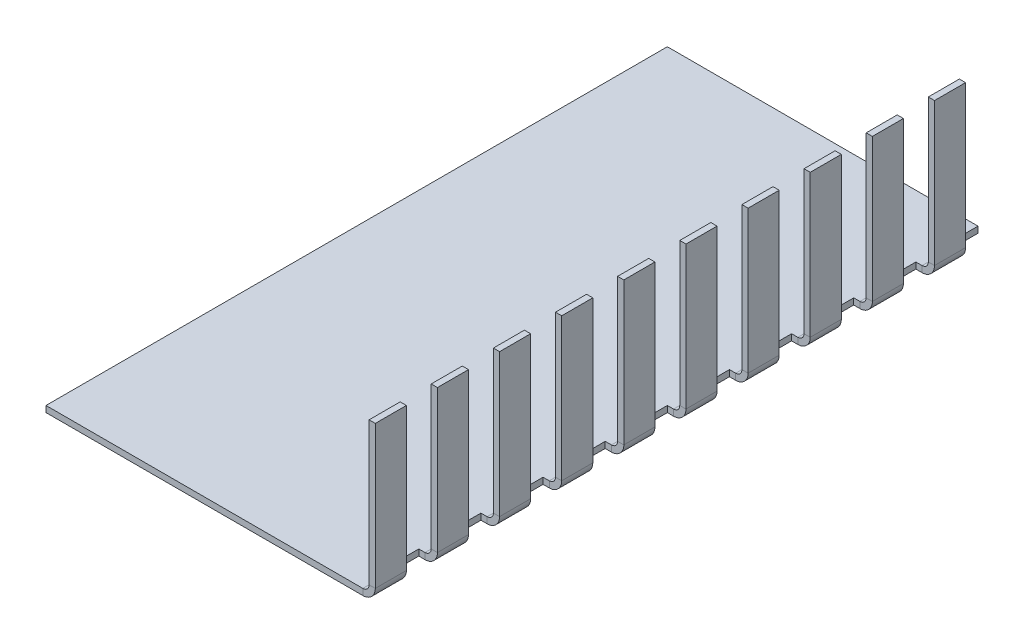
ISO-10303-21;
HEADER;
FILE_DESCRIPTION(('STEP AP214'),'2;1');
FILE_NAME('part.step','',(''),(''),'','','');
FILE_SCHEMA(('AUTOMOTIVE_DESIGN { 1 0 10303 214 1 1 1 1 }'));
ENDSEC;
DATA;
#1=APPLICATION_CONTEXT('core data for automotive mechanical design processes');
#2=APPLICATION_PROTOCOL_DEFINITION('international standard','automotive_design',2000,#1);
#3=PRODUCT_CONTEXT('',#1,'mechanical');
#4=PRODUCT('Part','Part','',(#3));
#5=PRODUCT_RELATED_PRODUCT_CATEGORY('part','',(#4));
#6=PRODUCT_DEFINITION_FORMATION('','',#4);
#7=PRODUCT_DEFINITION_CONTEXT('part definition',#1,'design');
#8=PRODUCT_DEFINITION('design','',#6,#7);
#9=PRODUCT_DEFINITION_SHAPE('','',#8);
#10=(LENGTH_UNIT() NAMED_UNIT(*) SI_UNIT(.MILLI.,.METRE.));
#11=(NAMED_UNIT(*) PLANE_ANGLE_UNIT() SI_UNIT($,.RADIAN.));
#12=(NAMED_UNIT(*) SI_UNIT($,.STERADIAN.) SOLID_ANGLE_UNIT());
#13=UNCERTAINTY_MEASURE_WITH_UNIT(LENGTH_MEASURE(1.E-05),#10,'distance_accuracy_value','');
#14=(GEOMETRIC_REPRESENTATION_CONTEXT(3) GLOBAL_UNCERTAINTY_ASSIGNED_CONTEXT((#13)) GLOBAL_UNIT_ASSIGNED_CONTEXT((#10,
#11,#12)) REPRESENTATION_CONTEXT('',''));
#15=CARTESIAN_POINT('',(0.,0.,0.));
#16=DIRECTION('',(0.,0.,1.));
#17=DIRECTION('',(1.,0.,0.));
#18=AXIS2_PLACEMENT_3D('',#15,#16,#17);
#19=CARTESIAN_POINT('',(9.85118163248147,48.,10.));
#20=DIRECTION('',(0.,1.,0.));
#21=DIRECTION('',(-1.,0.,0.));
#22=AXIS2_PLACEMENT_3D('',#19,#20,#21);
#23=PLANE('',#22);
#24=DIRECTION('',(1.,0.,0.));
#25=VECTOR('',#24,1.);
#26=CARTESIAN_POINT('',(9.85118163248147,48.,20.));
#27=LINE('',#26,#25);
#28=CARTESIAN_POINT('',(104.,48.,20.));
#29=VERTEX_POINT('',#28);
#30=CARTESIAN_POINT('',(106.,48.,20.));
#31=VERTEX_POINT('',#30);
#32=EDGE_CURVE('E695',#29,#31,#27,.T.);
#33=ORIENTED_EDGE('',*,*,#32,.T.);
#34=DIRECTION('',(0.,0.,1.));
#35=VECTOR('',#34,1.);
#36=CARTESIAN_POINT('',(106.,48.,10.));
#37=LINE('',#36,#35);
#38=CARTESIAN_POINT('',(106.,48.,10.));
#39=VERTEX_POINT('',#38);
#40=EDGE_CURVE('E679',#39,#31,#37,.T.);
#41=ORIENTED_EDGE('',*,*,#40,.F.);
#42=DIRECTION('',(1.,0.,0.));
#43=VECTOR('',#42,1.);
#44=CARTESIAN_POINT('',(9.85118163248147,48.,10.));
#45=LINE('',#44,#43);
#46=CARTESIAN_POINT('',(104.,48.,10.));
#47=VERTEX_POINT('',#46);
#48=EDGE_CURVE('E1315',#47,#39,#45,.T.);
#49=ORIENTED_EDGE('',*,*,#48,.F.);
#50=DIRECTION('',(0.,0.,1.));
#51=VECTOR('',#50,1.);
#52=CARTESIAN_POINT('',(104.,48.,10.));
#53=LINE('',#52,#51);
#54=EDGE_CURVE('E686',#47,#29,#53,.T.);
#55=ORIENTED_EDGE('',*,*,#54,.T.);
#56=EDGE_LOOP('',(#33,#41,#49,#55));
#57=FACE_BOUND('',#56,.T.);
#58=ADVANCED_FACE('F31',(#57),#23,.T.);
#59=CARTESIAN_POINT('',(9.85118163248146,-2.,20.));
#60=DIRECTION('',(0.,0.,-1.));
#61=DIRECTION('',(0.,-1.,0.));
#62=AXIS2_PLACEMENT_3D('',#59,#60,#61);
#63=PLANE('',#62);
#64=DIRECTION('',(0.,1.,0.));
#65=VECTOR('',#64,1.);
#66=CARTESIAN_POINT('',(106.,-1.99999999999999,20.));
#67=LINE('',#66,#65);
#68=CARTESIAN_POINT('',(106.,1.99999999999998,20.));
#69=VERTEX_POINT('',#68);
#70=EDGE_CURVE('E674',#69,#31,#67,.T.);
#71=ORIENTED_EDGE('',*,*,#70,.T.);
#72=ORIENTED_EDGE('',*,*,#32,.F.);
#73=DIRECTION('',(0.,1.,0.));
#74=VECTOR('',#73,1.);
#75=CARTESIAN_POINT('',(104.,-1.99999999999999,20.));
#76=LINE('',#75,#74);
#77=CARTESIAN_POINT('',(104.,1.99999999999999,20.));
#78=VERTEX_POINT('',#77);
#79=EDGE_CURVE('E11',#78,#29,#76,.T.);
#80=ORIENTED_EDGE('',*,*,#79,.F.);
#81=DIRECTION('',(1.,0.,0.));
#82=VECTOR('',#81,1.);
#83=CARTESIAN_POINT('',(9.85118163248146,1.99999999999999,20.));
#84=LINE('',#83,#82);
#85=EDGE_CURVE('E671',#78,#69,#84,.T.);
#86=ORIENTED_EDGE('',*,*,#85,.T.);
#87=EDGE_LOOP('',(#71,#72,#80,#86));
#88=FACE_BOUND('',#87,.T.);
#89=ADVANCED_FACE('F673',(#88),#63,.F.);
#90=CARTESIAN_POINT('',(106.,-1.99999999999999,10.));
#91=DIRECTION('',(1.,0.,0.));
#92=DIRECTION('',(0.,0.,-1.));
#93=AXIS2_PLACEMENT_3D('',#90,#91,#92);
#94=PLANE('',#93);
#95=DIRECTION('',(0.,0.,1.));
#96=VECTOR('',#95,1.);
#97=CARTESIAN_POINT('',(106.,1.99999999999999,20.));
#98=LINE('',#97,#96);
#99=CARTESIAN_POINT('',(106.,2.,10.));
#100=VERTEX_POINT('',#99);
#101=EDGE_CURVE('E684',#100,#69,#98,.T.);
#102=ORIENTED_EDGE('',*,*,#101,.F.);
#103=DIRECTION('',(0.,-1.,0.));
#104=VECTOR('',#103,1.);
#105=CARTESIAN_POINT('',(106.,-2.,10.));
#106=LINE('',#105,#104);
#107=EDGE_CURVE('E1313',#39,#100,#106,.T.);
#108=ORIENTED_EDGE('',*,*,#107,.F.);
#109=ORIENTED_EDGE('',*,*,#40,.T.);
#110=ORIENTED_EDGE('',*,*,#70,.F.);
#111=EDGE_LOOP('',(#102,#108,#109,#110));
#112=FACE_BOUND('',#111,.T.);
#113=ADVANCED_FACE('F683',(#112),#94,.T.);
#114=CARTESIAN_POINT('',(9.85118163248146,-2.,10.));
#115=DIRECTION('',(0.,0.,-1.));
#116=DIRECTION('',(0.,-1.,0.));
#117=AXIS2_PLACEMENT_3D('',#114,#115,#116);
#118=PLANE('',#117);
#119=ORIENTED_EDGE('',*,*,#48,.T.);
#120=ORIENTED_EDGE('',*,*,#107,.T.);
#121=DIRECTION('',(1.,0.,0.));
#122=VECTOR('',#121,1.);
#123=CARTESIAN_POINT('',(9.85118163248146,1.99999999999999,10.));
#124=LINE('',#123,#122);
#125=CARTESIAN_POINT('',(104.,2.,10.));
#126=VERTEX_POINT('',#125);
#127=EDGE_CURVE('E35',#126,#100,#124,.T.);
#128=ORIENTED_EDGE('',*,*,#127,.F.);
#129=DIRECTION('',(0.,-1.,0.));
#130=VECTOR('',#129,1.);
#131=CARTESIAN_POINT('',(104.,-2.,10.));
#132=LINE('',#131,#130);
#133=EDGE_CURVE('E50',#47,#126,#132,.T.);
#134=ORIENTED_EDGE('',*,*,#133,.F.);
#135=EDGE_LOOP('',(#119,#120,#128,#134));
#136=FACE_BOUND('',#135,.T.);
#137=ADVANCED_FACE('F1494',(#136),#118,.T.);
#138=CARTESIAN_POINT('',(104.,-1.99999999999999,10.));
#139=DIRECTION('',(1.,0.,0.));
#140=DIRECTION('',(0.,0.,-1.));
#141=AXIS2_PLACEMENT_3D('',#138,#139,#140);
#142=PLANE('',#141);
#143=ORIENTED_EDGE('',*,*,#133,.T.);
#144=DIRECTION('',(0.,0.,1.));
#145=VECTOR('',#144,1.);
#146=CARTESIAN_POINT('',(104.,1.99999999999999,20.));
#147=LINE('',#146,#145);
#148=EDGE_CURVE('E41',#126,#78,#147,.T.);
#149=ORIENTED_EDGE('',*,*,#148,.T.);
#150=ORIENTED_EDGE('',*,*,#79,.T.);
#151=ORIENTED_EDGE('',*,*,#54,.F.);
#152=EDGE_LOOP('',(#143,#149,#150,#151));
#153=FACE_BOUND('',#152,.T.);
#154=ADVANCED_FACE('F33',(#153),#142,.F.);
#155=CARTESIAN_POINT('',(9.85118163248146,48.,30.));
#156=DIRECTION('',(0.,1.,0.));
#157=DIRECTION('',(-1.,0.,0.));
#158=AXIS2_PLACEMENT_3D('',#155,#156,#157);
#159=PLANE('',#158);
#160=DIRECTION('',(1.,0.,0.));
#161=VECTOR('',#160,1.);
#162=CARTESIAN_POINT('',(9.85118163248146,48.,40.));
#163=LINE('',#162,#161);
#164=CARTESIAN_POINT('',(104.,48.,40.));
#165=VERTEX_POINT('',#164);
#166=CARTESIAN_POINT('',(106.,48.,40.));
#167=VERTEX_POINT('',#166);
#168=EDGE_CURVE('E1304',#165,#167,#163,.T.);
#169=ORIENTED_EDGE('',*,*,#168,.T.);
#170=DIRECTION('',(0.,0.,1.));
#171=VECTOR('',#170,1.);
#172=CARTESIAN_POINT('',(106.,48.,30.));
#173=LINE('',#172,#171);
#174=CARTESIAN_POINT('',(106.,48.,30.));
#175=VERTEX_POINT('',#174);
#176=EDGE_CURVE('E1295',#175,#167,#173,.T.);
#177=ORIENTED_EDGE('',*,*,#176,.F.);
#178=DIRECTION('',(1.,0.,0.));
#179=VECTOR('',#178,1.);
#180=CARTESIAN_POINT('',(9.85118163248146,48.,30.));
#181=LINE('',#180,#179);
#182=CARTESIAN_POINT('',(104.,48.,30.));
#183=VERTEX_POINT('',#182);
#184=EDGE_CURVE('E1293',#183,#175,#181,.T.);
#185=ORIENTED_EDGE('',*,*,#184,.F.);
#186=DIRECTION('',(0.,0.,1.));
#187=VECTOR('',#186,1.);
#188=CARTESIAN_POINT('',(104.,48.,30.));
#189=LINE('',#188,#187);
#190=EDGE_CURVE('E1302',#183,#165,#189,.T.);
#191=ORIENTED_EDGE('',*,*,#190,.T.);
#192=EDGE_LOOP('',(#169,#177,#185,#191));
#193=FACE_BOUND('',#192,.T.);
#194=ADVANCED_FACE('F1499',(#193),#159,.T.);
#195=CARTESIAN_POINT('',(9.85118163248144,-2.,40.));
#196=DIRECTION('',(0.,0.,-1.));
#197=DIRECTION('',(0.,-1.,0.));
#198=AXIS2_PLACEMENT_3D('',#195,#196,#197);
#199=PLANE('',#198);
#200=DIRECTION('',(0.,1.,0.));
#201=VECTOR('',#200,1.);
#202=CARTESIAN_POINT('',(106.,-1.99999999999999,40.));
#203=LINE('',#202,#201);
#204=CARTESIAN_POINT('',(106.,1.99999999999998,40.));
#205=VERTEX_POINT('',#204);
#206=EDGE_CURVE('E1299',#205,#167,#203,.T.);
#207=ORIENTED_EDGE('',*,*,#206,.T.);
#208=ORIENTED_EDGE('',*,*,#168,.F.);
#209=DIRECTION('',(0.,1.,0.));
#210=VECTOR('',#209,1.);
#211=CARTESIAN_POINT('',(104.,-1.99999999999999,40.));
#212=LINE('',#211,#210);
#213=CARTESIAN_POINT('',(104.,1.99999999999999,40.));
#214=VERTEX_POINT('',#213);
#215=EDGE_CURVE('E108',#214,#165,#212,.T.);
#216=ORIENTED_EDGE('',*,*,#215,.F.);
#217=DIRECTION('',(1.,0.,0.));
#218=VECTOR('',#217,1.);
#219=CARTESIAN_POINT('',(9.85118163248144,1.99999999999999,40.));
#220=LINE('',#219,#218);
#221=EDGE_CURVE('E1297',#214,#205,#220,.T.);
#222=ORIENTED_EDGE('',*,*,#221,.T.);
#223=EDGE_LOOP('',(#207,#208,#216,#222));
#224=FACE_BOUND('',#223,.T.);
#225=ADVANCED_FACE('F1503',(#224),#199,.F.);
#226=CARTESIAN_POINT('',(106.,-1.99999999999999,30.));
#227=DIRECTION('',(1.,0.,0.));
#228=DIRECTION('',(0.,0.,-1.));
#229=AXIS2_PLACEMENT_3D('',#226,#227,#228);
#230=PLANE('',#229);
#231=DIRECTION('',(0.,0.,1.));
#232=VECTOR('',#231,1.);
#233=CARTESIAN_POINT('',(106.,1.99999999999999,40.));
#234=LINE('',#233,#232);
#235=CARTESIAN_POINT('',(106.,2.,30.));
#236=VERTEX_POINT('',#235);
#237=EDGE_CURVE('E1307',#236,#205,#234,.T.);
#238=ORIENTED_EDGE('',*,*,#237,.F.);
#239=DIRECTION('',(0.,-1.,0.));
#240=VECTOR('',#239,1.);
#241=CARTESIAN_POINT('',(106.,-2.,30.));
#242=LINE('',#241,#240);
#243=EDGE_CURVE('E1291',#175,#236,#242,.T.);
#244=ORIENTED_EDGE('',*,*,#243,.F.);
#245=ORIENTED_EDGE('',*,*,#176,.T.);
#246=ORIENTED_EDGE('',*,*,#206,.F.);
#247=EDGE_LOOP('',(#238,#244,#245,#246));
#248=FACE_BOUND('',#247,.T.);
#249=ADVANCED_FACE('F1509',(#248),#230,.T.);
#250=CARTESIAN_POINT('',(9.85118163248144,-2.,30.));
#251=DIRECTION('',(0.,0.,-1.));
#252=DIRECTION('',(0.,-1.,0.));
#253=AXIS2_PLACEMENT_3D('',#250,#251,#252);
#254=PLANE('',#253);
#255=ORIENTED_EDGE('',*,*,#184,.T.);
#256=ORIENTED_EDGE('',*,*,#243,.T.);
#257=DIRECTION('',(1.,0.,0.));
#258=VECTOR('',#257,1.);
#259=CARTESIAN_POINT('',(9.85118163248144,1.99999999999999,30.));
#260=LINE('',#259,#258);
#261=CARTESIAN_POINT('',(104.,2.,30.));
#262=VERTEX_POINT('',#261);
#263=EDGE_CURVE('E101',#262,#236,#260,.T.);
#264=ORIENTED_EDGE('',*,*,#263,.F.);
#265=DIRECTION('',(0.,-1.,0.));
#266=VECTOR('',#265,1.);
#267=CARTESIAN_POINT('',(104.,-2.,30.));
#268=LINE('',#267,#266);
#269=EDGE_CURVE('E82',#183,#262,#268,.T.);
#270=ORIENTED_EDGE('',*,*,#269,.F.);
#271=EDGE_LOOP('',(#255,#256,#264,#270));
#272=FACE_BOUND('',#271,.T.);
#273=ADVANCED_FACE('F1516',(#272),#254,.T.);
#274=CARTESIAN_POINT('',(104.,-1.99999999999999,30.));
#275=DIRECTION('',(1.,0.,0.));
#276=DIRECTION('',(0.,0.,-1.));
#277=AXIS2_PLACEMENT_3D('',#274,#275,#276);
#278=PLANE('',#277);
#279=ORIENTED_EDGE('',*,*,#269,.T.);
#280=DIRECTION('',(0.,0.,1.));
#281=VECTOR('',#280,1.);
#282=CARTESIAN_POINT('',(104.,1.99999999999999,40.));
#283=LINE('',#282,#281);
#284=EDGE_CURVE('E1288',#262,#214,#283,.T.);
#285=ORIENTED_EDGE('',*,*,#284,.T.);
#286=ORIENTED_EDGE('',*,*,#215,.T.);
#287=ORIENTED_EDGE('',*,*,#190,.F.);
#288=EDGE_LOOP('',(#279,#285,#286,#287));
#289=FACE_BOUND('',#288,.T.);
#290=ADVANCED_FACE('F1490',(#289),#278,.F.);
#291=CARTESIAN_POINT('',(9.85118163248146,48.,50.));
#292=DIRECTION('',(0.,1.,0.));
#293=DIRECTION('',(-1.,0.,0.));
#294=AXIS2_PLACEMENT_3D('',#291,#292,#293);
#295=PLANE('',#294);
#296=DIRECTION('',(1.,0.,0.));
#297=VECTOR('',#296,1.);
#298=CARTESIAN_POINT('',(9.85118163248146,48.,60.));
#299=LINE('',#298,#297);
#300=CARTESIAN_POINT('',(104.,48.,60.));
#301=VERTEX_POINT('',#300);
#302=CARTESIAN_POINT('',(106.,48.,60.));
#303=VERTEX_POINT('',#302);
#304=EDGE_CURVE('E1280',#301,#303,#299,.T.);
#305=ORIENTED_EDGE('',*,*,#304,.T.);
#306=DIRECTION('',(0.,0.,1.));
#307=VECTOR('',#306,1.);
#308=CARTESIAN_POINT('',(106.,48.,50.));
#309=LINE('',#308,#307);
#310=CARTESIAN_POINT('',(106.,48.,50.));
#311=VERTEX_POINT('',#310);
#312=EDGE_CURVE('E1271',#311,#303,#309,.T.);
#313=ORIENTED_EDGE('',*,*,#312,.F.);
#314=DIRECTION('',(1.,0.,0.));
#315=VECTOR('',#314,1.);
#316=CARTESIAN_POINT('',(9.85118163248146,48.,50.));
#317=LINE('',#316,#315);
#318=CARTESIAN_POINT('',(104.,48.,50.));
#319=VERTEX_POINT('',#318);
#320=EDGE_CURVE('E1269',#319,#311,#317,.T.);
#321=ORIENTED_EDGE('',*,*,#320,.F.);
#322=DIRECTION('',(0.,0.,1.));
#323=VECTOR('',#322,1.);
#324=CARTESIAN_POINT('',(104.,48.,50.));
#325=LINE('',#324,#323);
#326=EDGE_CURVE('E1278',#319,#301,#325,.T.);
#327=ORIENTED_EDGE('',*,*,#326,.T.);
#328=EDGE_LOOP('',(#305,#313,#321,#327));
#329=FACE_BOUND('',#328,.T.);
#330=ADVANCED_FACE('F1522',(#329),#295,.T.);
#331=CARTESIAN_POINT('',(9.85118163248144,-2.,60.));
#332=DIRECTION('',(0.,0.,-1.));
#333=DIRECTION('',(0.,-1.,0.));
#334=AXIS2_PLACEMENT_3D('',#331,#332,#333);
#335=PLANE('',#334);
#336=DIRECTION('',(0.,1.,0.));
#337=VECTOR('',#336,1.);
#338=CARTESIAN_POINT('',(106.,-1.99999999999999,60.));
#339=LINE('',#338,#337);
#340=CARTESIAN_POINT('',(106.,1.99999999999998,60.));
#341=VERTEX_POINT('',#340);
#342=EDGE_CURVE('E1275',#341,#303,#339,.T.);
#343=ORIENTED_EDGE('',*,*,#342,.T.);
#344=ORIENTED_EDGE('',*,*,#304,.F.);
#345=DIRECTION('',(0.,1.,0.));
#346=VECTOR('',#345,1.);
#347=CARTESIAN_POINT('',(104.,-1.99999999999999,60.));
#348=LINE('',#347,#346);
#349=CARTESIAN_POINT('',(104.,1.99999999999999,60.));
#350=VERTEX_POINT('',#349);
#351=EDGE_CURVE('E143',#350,#301,#348,.T.);
#352=ORIENTED_EDGE('',*,*,#351,.F.);
#353=DIRECTION('',(1.,0.,0.));
#354=VECTOR('',#353,1.);
#355=CARTESIAN_POINT('',(9.85118163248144,1.99999999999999,60.));
#356=LINE('',#355,#354);
#357=EDGE_CURVE('E1273',#350,#341,#356,.T.);
#358=ORIENTED_EDGE('',*,*,#357,.T.);
#359=EDGE_LOOP('',(#343,#344,#352,#358));
#360=FACE_BOUND('',#359,.T.);
#361=ADVANCED_FACE('F2506',(#360),#335,.F.);
#362=CARTESIAN_POINT('',(106.,-1.99999999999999,50.));
#363=DIRECTION('',(1.,0.,0.));
#364=DIRECTION('',(0.,0.,-1.));
#365=AXIS2_PLACEMENT_3D('',#362,#363,#364);
#366=PLANE('',#365);
#367=DIRECTION('',(0.,0.,1.));
#368=VECTOR('',#367,1.);
#369=CARTESIAN_POINT('',(106.,1.99999999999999,60.));
#370=LINE('',#369,#368);
#371=CARTESIAN_POINT('',(106.,2.,50.));
#372=VERTEX_POINT('',#371);
#373=EDGE_CURVE('E1283',#372,#341,#370,.T.);
#374=ORIENTED_EDGE('',*,*,#373,.F.);
#375=DIRECTION('',(0.,-1.,0.));
#376=VECTOR('',#375,1.);
#377=CARTESIAN_POINT('',(106.,-2.,50.));
#378=LINE('',#377,#376);
#379=EDGE_CURVE('E1267',#311,#372,#378,.T.);
#380=ORIENTED_EDGE('',*,*,#379,.F.);
#381=ORIENTED_EDGE('',*,*,#312,.T.);
#382=ORIENTED_EDGE('',*,*,#342,.F.);
#383=EDGE_LOOP('',(#374,#380,#381,#382));
#384=FACE_BOUND('',#383,.T.);
#385=ADVANCED_FACE('F2499',(#384),#366,.T.);
#386=CARTESIAN_POINT('',(9.85118163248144,-2.,50.));
#387=DIRECTION('',(0.,0.,-1.));
#388=DIRECTION('',(0.,-1.,0.));
#389=AXIS2_PLACEMENT_3D('',#386,#387,#388);
#390=PLANE('',#389);
#391=ORIENTED_EDGE('',*,*,#320,.T.);
#392=ORIENTED_EDGE('',*,*,#379,.T.);
#393=DIRECTION('',(1.,0.,0.));
#394=VECTOR('',#393,1.);
#395=CARTESIAN_POINT('',(9.85118163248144,1.99999999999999,50.));
#396=LINE('',#395,#394);
#397=CARTESIAN_POINT('',(104.,2.,50.));
#398=VERTEX_POINT('',#397);
#399=EDGE_CURVE('E136',#398,#372,#396,.T.);
#400=ORIENTED_EDGE('',*,*,#399,.F.);
#401=DIRECTION('',(0.,-1.,0.));
#402=VECTOR('',#401,1.);
#403=CARTESIAN_POINT('',(104.,-2.,50.));
#404=LINE('',#403,#402);
#405=EDGE_CURVE('E117',#319,#398,#404,.T.);
#406=ORIENTED_EDGE('',*,*,#405,.F.);
#407=EDGE_LOOP('',(#391,#392,#400,#406));
#408=FACE_BOUND('',#407,.T.);
#409=ADVANCED_FACE('F2491',(#408),#390,.T.);
#410=CARTESIAN_POINT('',(104.,-1.99999999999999,50.));
#411=DIRECTION('',(1.,0.,0.));
#412=DIRECTION('',(0.,0.,-1.));
#413=AXIS2_PLACEMENT_3D('',#410,#411,#412);
#414=PLANE('',#413);
#415=ORIENTED_EDGE('',*,*,#405,.T.);
#416=DIRECTION('',(0.,0.,1.));
#417=VECTOR('',#416,1.);
#418=CARTESIAN_POINT('',(104.,1.99999999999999,60.));
#419=LINE('',#418,#417);
#420=EDGE_CURVE('E1264',#398,#350,#419,.T.);
#421=ORIENTED_EDGE('',*,*,#420,.T.);
#422=ORIENTED_EDGE('',*,*,#351,.T.);
#423=ORIENTED_EDGE('',*,*,#326,.F.);
#424=EDGE_LOOP('',(#415,#421,#422,#423));
#425=FACE_BOUND('',#424,.T.);
#426=ADVANCED_FACE('F1512',(#425),#414,.F.);
#427=CARTESIAN_POINT('',(9.85118163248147,48.,70.));
#428=DIRECTION('',(0.,1.,0.));
#429=DIRECTION('',(-1.,0.,0.));
#430=AXIS2_PLACEMENT_3D('',#427,#428,#429);
#431=PLANE('',#430);
#432=DIRECTION('',(1.,0.,0.));
#433=VECTOR('',#432,1.);
#434=CARTESIAN_POINT('',(9.85118163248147,48.,80.));
#435=LINE('',#434,#433);
#436=CARTESIAN_POINT('',(104.,48.,80.));
#437=VERTEX_POINT('',#436);
#438=CARTESIAN_POINT('',(106.,48.,80.));
#439=VERTEX_POINT('',#438);
#440=EDGE_CURVE('E1256',#437,#439,#435,.T.);
#441=ORIENTED_EDGE('',*,*,#440,.T.);
#442=DIRECTION('',(0.,0.,1.));
#443=VECTOR('',#442,1.);
#444=CARTESIAN_POINT('',(106.,48.,70.));
#445=LINE('',#444,#443);
#446=CARTESIAN_POINT('',(106.,48.,70.));
#447=VERTEX_POINT('',#446);
#448=EDGE_CURVE('E1247',#447,#439,#445,.T.);
#449=ORIENTED_EDGE('',*,*,#448,.F.);
#450=DIRECTION('',(1.,0.,0.));
#451=VECTOR('',#450,1.);
#452=CARTESIAN_POINT('',(9.85118163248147,48.,70.));
#453=LINE('',#452,#451);
#454=CARTESIAN_POINT('',(104.,48.,70.));
#455=VERTEX_POINT('',#454);
#456=EDGE_CURVE('E1245',#455,#447,#453,.T.);
#457=ORIENTED_EDGE('',*,*,#456,.F.);
#458=DIRECTION('',(0.,0.,1.));
#459=VECTOR('',#458,1.);
#460=CARTESIAN_POINT('',(104.,48.,70.));
#461=LINE('',#460,#459);
#462=EDGE_CURVE('E1254',#455,#437,#461,.T.);
#463=ORIENTED_EDGE('',*,*,#462,.T.);
#464=EDGE_LOOP('',(#441,#449,#457,#463));
#465=FACE_BOUND('',#464,.T.);
#466=ADVANCED_FACE('F2475',(#465),#431,.T.);
#467=CARTESIAN_POINT('',(9.85118163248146,-2.,80.));
#468=DIRECTION('',(0.,0.,-1.));
#469=DIRECTION('',(0.,-1.,0.));
#470=AXIS2_PLACEMENT_3D('',#467,#468,#469);
#471=PLANE('',#470);
#472=DIRECTION('',(0.,1.,0.));
#473=VECTOR('',#472,1.);
#474=CARTESIAN_POINT('',(106.,-1.99999999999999,80.));
#475=LINE('',#474,#473);
#476=CARTESIAN_POINT('',(106.,1.99999999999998,80.));
#477=VERTEX_POINT('',#476);
#478=EDGE_CURVE('E1251',#477,#439,#475,.T.);
#479=ORIENTED_EDGE('',*,*,#478,.T.);
#480=ORIENTED_EDGE('',*,*,#440,.F.);
#481=DIRECTION('',(0.,1.,0.));
#482=VECTOR('',#481,1.);
#483=CARTESIAN_POINT('',(104.,-1.99999999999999,80.));
#484=LINE('',#483,#482);
#485=CARTESIAN_POINT('',(104.,1.99999999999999,80.));
#486=VERTEX_POINT('',#485);
#487=EDGE_CURVE('E178',#486,#437,#484,.T.);
#488=ORIENTED_EDGE('',*,*,#487,.F.);
#489=DIRECTION('',(1.,0.,0.));
#490=VECTOR('',#489,1.);
#491=CARTESIAN_POINT('',(9.85118163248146,1.99999999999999,80.));
#492=LINE('',#491,#490);
#493=EDGE_CURVE('E1249',#486,#477,#492,.T.);
#494=ORIENTED_EDGE('',*,*,#493,.T.);
#495=EDGE_LOOP('',(#479,#480,#488,#494));
#496=FACE_BOUND('',#495,.T.);
#497=ADVANCED_FACE('F2466',(#496),#471,.F.);
#498=CARTESIAN_POINT('',(106.,-1.99999999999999,70.));
#499=DIRECTION('',(1.,0.,0.));
#500=DIRECTION('',(0.,0.,-1.));
#501=AXIS2_PLACEMENT_3D('',#498,#499,#500);
#502=PLANE('',#501);
#503=DIRECTION('',(0.,0.,1.));
#504=VECTOR('',#503,1.);
#505=CARTESIAN_POINT('',(106.,1.99999999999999,80.));
#506=LINE('',#505,#504);
#507=CARTESIAN_POINT('',(106.,2.,70.));
#508=VERTEX_POINT('',#507);
#509=EDGE_CURVE('E1259',#508,#477,#506,.T.);
#510=ORIENTED_EDGE('',*,*,#509,.F.);
#511=DIRECTION('',(0.,-1.,0.));
#512=VECTOR('',#511,1.);
#513=CARTESIAN_POINT('',(106.,-2.,70.));
#514=LINE('',#513,#512);
#515=EDGE_CURVE('E1243',#447,#508,#514,.T.);
#516=ORIENTED_EDGE('',*,*,#515,.F.);
#517=ORIENTED_EDGE('',*,*,#448,.T.);
#518=ORIENTED_EDGE('',*,*,#478,.F.);
#519=EDGE_LOOP('',(#510,#516,#517,#518));
#520=FACE_BOUND('',#519,.T.);
#521=ADVANCED_FACE('F2458',(#520),#502,.T.);
#522=CARTESIAN_POINT('',(9.85118163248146,-2.,70.));
#523=DIRECTION('',(0.,0.,-1.));
#524=DIRECTION('',(0.,-1.,0.));
#525=AXIS2_PLACEMENT_3D('',#522,#523,#524);
#526=PLANE('',#525);
#527=ORIENTED_EDGE('',*,*,#456,.T.);
#528=ORIENTED_EDGE('',*,*,#515,.T.);
#529=DIRECTION('',(1.,0.,0.));
#530=VECTOR('',#529,1.);
#531=CARTESIAN_POINT('',(9.85118163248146,1.99999999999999,70.));
#532=LINE('',#531,#530);
#533=CARTESIAN_POINT('',(104.,2.,70.));
#534=VERTEX_POINT('',#533);
#535=EDGE_CURVE('E171',#534,#508,#532,.T.);
#536=ORIENTED_EDGE('',*,*,#535,.F.);
#537=DIRECTION('',(0.,-1.,0.));
#538=VECTOR('',#537,1.);
#539=CARTESIAN_POINT('',(104.,-2.,70.));
#540=LINE('',#539,#538);
#541=EDGE_CURVE('E152',#455,#534,#540,.T.);
#542=ORIENTED_EDGE('',*,*,#541,.F.);
#543=EDGE_LOOP('',(#527,#528,#536,#542));
#544=FACE_BOUND('',#543,.T.);
#545=ADVANCED_FACE('F2449',(#544),#526,.T.);
#546=CARTESIAN_POINT('',(104.,-1.99999999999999,70.));
#547=DIRECTION('',(1.,0.,0.));
#548=DIRECTION('',(0.,0.,-1.));
#549=AXIS2_PLACEMENT_3D('',#546,#547,#548);
#550=PLANE('',#549);
#551=ORIENTED_EDGE('',*,*,#541,.T.);
#552=DIRECTION('',(0.,0.,1.));
#553=VECTOR('',#552,1.);
#554=CARTESIAN_POINT('',(104.,1.99999999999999,80.));
#555=LINE('',#554,#553);
#556=EDGE_CURVE('E1240',#534,#486,#555,.T.);
#557=ORIENTED_EDGE('',*,*,#556,.T.);
#558=ORIENTED_EDGE('',*,*,#487,.T.);
#559=ORIENTED_EDGE('',*,*,#462,.F.);
#560=EDGE_LOOP('',(#551,#557,#558,#559));
#561=FACE_BOUND('',#560,.T.);
#562=ADVANCED_FACE('F2440',(#561),#550,.F.);
#563=CARTESIAN_POINT('',(9.85118163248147,48.,90.));
#564=DIRECTION('',(0.,1.,0.));
#565=DIRECTION('',(-1.,0.,0.));
#566=AXIS2_PLACEMENT_3D('',#563,#564,#565);
#567=PLANE('',#566);
#568=DIRECTION('',(1.,0.,0.));
#569=VECTOR('',#568,1.);
#570=CARTESIAN_POINT('',(9.85118163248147,48.,100.));
#571=LINE('',#570,#569);
#572=CARTESIAN_POINT('',(104.,48.,100.));
#573=VERTEX_POINT('',#572);
#574=CARTESIAN_POINT('',(106.,48.,100.));
#575=VERTEX_POINT('',#574);
#576=EDGE_CURVE('E1232',#573,#575,#571,.T.);
#577=ORIENTED_EDGE('',*,*,#576,.T.);
#578=DIRECTION('',(0.,0.,1.));
#579=VECTOR('',#578,1.);
#580=CARTESIAN_POINT('',(106.,48.,90.));
#581=LINE('',#580,#579);
#582=CARTESIAN_POINT('',(106.,48.,90.));
#583=VERTEX_POINT('',#582);
#584=EDGE_CURVE('E1223',#583,#575,#581,.T.);
#585=ORIENTED_EDGE('',*,*,#584,.F.);
#586=DIRECTION('',(1.,0.,0.));
#587=VECTOR('',#586,1.);
#588=CARTESIAN_POINT('',(9.85118163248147,48.,90.));
#589=LINE('',#588,#587);
#590=CARTESIAN_POINT('',(104.,48.,90.));
#591=VERTEX_POINT('',#590);
#592=EDGE_CURVE('E1221',#591,#583,#589,.T.);
#593=ORIENTED_EDGE('',*,*,#592,.F.);
#594=DIRECTION('',(0.,0.,1.));
#595=VECTOR('',#594,1.);
#596=CARTESIAN_POINT('',(104.,48.,90.));
#597=LINE('',#596,#595);
#598=EDGE_CURVE('E1230',#591,#573,#597,.T.);
#599=ORIENTED_EDGE('',*,*,#598,.T.);
#600=EDGE_LOOP('',(#577,#585,#593,#599));
#601=FACE_BOUND('',#600,.T.);
#602=ADVANCED_FACE('F2432',(#601),#567,.T.);
#603=CARTESIAN_POINT('',(9.85118163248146,-2.,100.));
#604=DIRECTION('',(0.,0.,-1.));
#605=DIRECTION('',(0.,-1.,0.));
#606=AXIS2_PLACEMENT_3D('',#603,#604,#605);
#607=PLANE('',#606);
#608=DIRECTION('',(0.,1.,0.));
#609=VECTOR('',#608,1.);
#610=CARTESIAN_POINT('',(106.,-1.99999999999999,100.));
#611=LINE('',#610,#609);
#612=CARTESIAN_POINT('',(106.,1.99999999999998,100.));
#613=VERTEX_POINT('',#612);
#614=EDGE_CURVE('E1227',#613,#575,#611,.T.);
#615=ORIENTED_EDGE('',*,*,#614,.T.);
#616=ORIENTED_EDGE('',*,*,#576,.F.);
#617=DIRECTION('',(0.,1.,0.));
#618=VECTOR('',#617,1.);
#619=CARTESIAN_POINT('',(104.,-1.99999999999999,100.));
#620=LINE('',#619,#618);
#621=CARTESIAN_POINT('',(104.,1.99999999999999,100.));
#622=VERTEX_POINT('',#621);
#623=EDGE_CURVE('E213',#622,#573,#620,.T.);
#624=ORIENTED_EDGE('',*,*,#623,.F.);
#625=DIRECTION('',(1.,0.,0.));
#626=VECTOR('',#625,1.);
#627=CARTESIAN_POINT('',(9.85118163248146,1.99999999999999,100.));
#628=LINE('',#627,#626);
#629=EDGE_CURVE('E1225',#622,#613,#628,.T.);
#630=ORIENTED_EDGE('',*,*,#629,.T.);
#631=EDGE_LOOP('',(#615,#616,#624,#630));
#632=FACE_BOUND('',#631,.T.);
#633=ADVANCED_FACE('F2423',(#632),#607,.F.);
#634=CARTESIAN_POINT('',(106.,-1.99999999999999,90.));
#635=DIRECTION('',(1.,0.,0.));
#636=DIRECTION('',(0.,0.,-1.));
#637=AXIS2_PLACEMENT_3D('',#634,#635,#636);
#638=PLANE('',#637);
#639=DIRECTION('',(0.,0.,1.));
#640=VECTOR('',#639,1.);
#641=CARTESIAN_POINT('',(106.,1.99999999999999,100.));
#642=LINE('',#641,#640);
#643=CARTESIAN_POINT('',(106.,2.,90.));
#644=VERTEX_POINT('',#643);
#645=EDGE_CURVE('E1235',#644,#613,#642,.T.);
#646=ORIENTED_EDGE('',*,*,#645,.F.);
#647=DIRECTION('',(0.,-1.,0.));
#648=VECTOR('',#647,1.);
#649=CARTESIAN_POINT('',(106.,-2.,90.));
#650=LINE('',#649,#648);
#651=EDGE_CURVE('E1219',#583,#644,#650,.T.);
#652=ORIENTED_EDGE('',*,*,#651,.F.);
#653=ORIENTED_EDGE('',*,*,#584,.T.);
#654=ORIENTED_EDGE('',*,*,#614,.F.);
#655=EDGE_LOOP('',(#646,#652,#653,#654));
#656=FACE_BOUND('',#655,.T.);
#657=ADVANCED_FACE('F2415',(#656),#638,.T.);
#658=CARTESIAN_POINT('',(9.85118163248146,-2.,90.));
#659=DIRECTION('',(0.,0.,-1.));
#660=DIRECTION('',(0.,-1.,0.));
#661=AXIS2_PLACEMENT_3D('',#658,#659,#660);
#662=PLANE('',#661);
#663=ORIENTED_EDGE('',*,*,#592,.T.);
#664=ORIENTED_EDGE('',*,*,#651,.T.);
#665=DIRECTION('',(1.,0.,0.));
#666=VECTOR('',#665,1.);
#667=CARTESIAN_POINT('',(9.85118163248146,1.99999999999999,90.));
#668=LINE('',#667,#666);
#669=CARTESIAN_POINT('',(104.,2.,90.));
#670=VERTEX_POINT('',#669);
#671=EDGE_CURVE('E206',#670,#644,#668,.T.);
#672=ORIENTED_EDGE('',*,*,#671,.F.);
#673=DIRECTION('',(0.,-1.,0.));
#674=VECTOR('',#673,1.);
#675=CARTESIAN_POINT('',(104.,-2.,90.));
#676=LINE('',#675,#674);
#677=EDGE_CURVE('E187',#591,#670,#676,.T.);
#678=ORIENTED_EDGE('',*,*,#677,.F.);
#679=EDGE_LOOP('',(#663,#664,#672,#678));
#680=FACE_BOUND('',#679,.T.);
#681=ADVANCED_FACE('F2406',(#680),#662,.T.);
#682=CARTESIAN_POINT('',(104.,-1.99999999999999,90.));
#683=DIRECTION('',(1.,0.,0.));
#684=DIRECTION('',(0.,0.,-1.));
#685=AXIS2_PLACEMENT_3D('',#682,#683,#684);
#686=PLANE('',#685);
#687=ORIENTED_EDGE('',*,*,#677,.T.);
#688=DIRECTION('',(0.,0.,1.));
#689=VECTOR('',#688,1.);
#690=CARTESIAN_POINT('',(104.,1.99999999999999,100.));
#691=LINE('',#690,#689);
#692=EDGE_CURVE('E1216',#670,#622,#691,.T.);
#693=ORIENTED_EDGE('',*,*,#692,.T.);
#694=ORIENTED_EDGE('',*,*,#623,.T.);
#695=ORIENTED_EDGE('',*,*,#598,.F.);
#696=EDGE_LOOP('',(#687,#693,#694,#695));
#697=FACE_BOUND('',#696,.T.);
#698=ADVANCED_FACE('F2397',(#697),#686,.F.);
#699=CARTESIAN_POINT('',(9.85118163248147,48.,110.));
#700=DIRECTION('',(0.,1.,0.));
#701=DIRECTION('',(-1.,0.,0.));
#702=AXIS2_PLACEMENT_3D('',#699,#700,#701);
#703=PLANE('',#702);
#704=DIRECTION('',(1.,0.,0.));
#705=VECTOR('',#704,1.);
#706=CARTESIAN_POINT('',(9.85118163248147,48.,120.));
#707=LINE('',#706,#705);
#708=CARTESIAN_POINT('',(104.,48.,120.));
#709=VERTEX_POINT('',#708);
#710=CARTESIAN_POINT('',(106.,48.,120.));
#711=VERTEX_POINT('',#710);
#712=EDGE_CURVE('E1208',#709,#711,#707,.T.);
#713=ORIENTED_EDGE('',*,*,#712,.T.);
#714=DIRECTION('',(0.,0.,1.));
#715=VECTOR('',#714,1.);
#716=CARTESIAN_POINT('',(106.,48.,110.));
#717=LINE('',#716,#715);
#718=CARTESIAN_POINT('',(106.,48.,110.));
#719=VERTEX_POINT('',#718);
#720=EDGE_CURVE('E1199',#719,#711,#717,.T.);
#721=ORIENTED_EDGE('',*,*,#720,.F.);
#722=DIRECTION('',(1.,0.,0.));
#723=VECTOR('',#722,1.);
#724=CARTESIAN_POINT('',(9.85118163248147,48.,110.));
#725=LINE('',#724,#723);
#726=CARTESIAN_POINT('',(104.,48.,110.));
#727=VERTEX_POINT('',#726);
#728=EDGE_CURVE('E1197',#727,#719,#725,.T.);
#729=ORIENTED_EDGE('',*,*,#728,.F.);
#730=DIRECTION('',(0.,0.,1.));
#731=VECTOR('',#730,1.);
#732=CARTESIAN_POINT('',(104.,48.,110.));
#733=LINE('',#732,#731);
#734=EDGE_CURVE('E1206',#727,#709,#733,.T.);
#735=ORIENTED_EDGE('',*,*,#734,.T.);
#736=EDGE_LOOP('',(#713,#721,#729,#735));
#737=FACE_BOUND('',#736,.T.);
#738=ADVANCED_FACE('F2389',(#737),#703,.T.);
#739=CARTESIAN_POINT('',(9.85118163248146,-2.,120.));
#740=DIRECTION('',(0.,0.,-1.));
#741=DIRECTION('',(0.,-1.,0.));
#742=AXIS2_PLACEMENT_3D('',#739,#740,#741);
#743=PLANE('',#742);
#744=DIRECTION('',(0.,1.,0.));
#745=VECTOR('',#744,1.);
#746=CARTESIAN_POINT('',(106.,-1.99999999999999,120.));
#747=LINE('',#746,#745);
#748=CARTESIAN_POINT('',(106.,1.99999999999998,120.));
#749=VERTEX_POINT('',#748);
#750=EDGE_CURVE('E1203',#749,#711,#747,.T.);
#751=ORIENTED_EDGE('',*,*,#750,.T.);
#752=ORIENTED_EDGE('',*,*,#712,.F.);
#753=DIRECTION('',(0.,1.,0.));
#754=VECTOR('',#753,1.);
#755=CARTESIAN_POINT('',(104.,-1.99999999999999,120.));
#756=LINE('',#755,#754);
#757=CARTESIAN_POINT('',(104.,1.99999999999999,120.));
#758=VERTEX_POINT('',#757);
#759=EDGE_CURVE('E248',#758,#709,#756,.T.);
#760=ORIENTED_EDGE('',*,*,#759,.F.);
#761=DIRECTION('',(1.,0.,0.));
#762=VECTOR('',#761,1.);
#763=CARTESIAN_POINT('',(9.85118163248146,1.99999999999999,120.));
#764=LINE('',#763,#762);
#765=EDGE_CURVE('E1201',#758,#749,#764,.T.);
#766=ORIENTED_EDGE('',*,*,#765,.T.);
#767=EDGE_LOOP('',(#751,#752,#760,#766));
#768=FACE_BOUND('',#767,.T.);
#769=ADVANCED_FACE('F2380',(#768),#743,.F.);
#770=CARTESIAN_POINT('',(106.,-1.99999999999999,110.));
#771=DIRECTION('',(1.,0.,0.));
#772=DIRECTION('',(0.,0.,-1.));
#773=AXIS2_PLACEMENT_3D('',#770,#771,#772);
#774=PLANE('',#773);
#775=DIRECTION('',(0.,0.,1.));
#776=VECTOR('',#775,1.);
#777=CARTESIAN_POINT('',(106.,1.99999999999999,120.));
#778=LINE('',#777,#776);
#779=CARTESIAN_POINT('',(106.,2.,110.));
#780=VERTEX_POINT('',#779);
#781=EDGE_CURVE('E1211',#780,#749,#778,.T.);
#782=ORIENTED_EDGE('',*,*,#781,.F.);
#783=DIRECTION('',(0.,-1.,0.));
#784=VECTOR('',#783,1.);
#785=CARTESIAN_POINT('',(106.,-2.,110.));
#786=LINE('',#785,#784);
#787=EDGE_CURVE('E1195',#719,#780,#786,.T.);
#788=ORIENTED_EDGE('',*,*,#787,.F.);
#789=ORIENTED_EDGE('',*,*,#720,.T.);
#790=ORIENTED_EDGE('',*,*,#750,.F.);
#791=EDGE_LOOP('',(#782,#788,#789,#790));
#792=FACE_BOUND('',#791,.T.);
#793=ADVANCED_FACE('F2372',(#792),#774,.T.);
#794=CARTESIAN_POINT('',(9.85118163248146,-2.,110.));
#795=DIRECTION('',(0.,0.,-1.));
#796=DIRECTION('',(0.,-1.,0.));
#797=AXIS2_PLACEMENT_3D('',#794,#795,#796);
#798=PLANE('',#797);
#799=ORIENTED_EDGE('',*,*,#728,.T.);
#800=ORIENTED_EDGE('',*,*,#787,.T.);
#801=DIRECTION('',(1.,0.,0.));
#802=VECTOR('',#801,1.);
#803=CARTESIAN_POINT('',(9.85118163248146,1.99999999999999,110.));
#804=LINE('',#803,#802);
#805=CARTESIAN_POINT('',(104.,2.,110.));
#806=VERTEX_POINT('',#805);
#807=EDGE_CURVE('E241',#806,#780,#804,.T.);
#808=ORIENTED_EDGE('',*,*,#807,.F.);
#809=DIRECTION('',(0.,-1.,0.));
#810=VECTOR('',#809,1.);
#811=CARTESIAN_POINT('',(104.,-2.,110.));
#812=LINE('',#811,#810);
#813=EDGE_CURVE('E222',#727,#806,#812,.T.);
#814=ORIENTED_EDGE('',*,*,#813,.F.);
#815=EDGE_LOOP('',(#799,#800,#808,#814));
#816=FACE_BOUND('',#815,.T.);
#817=ADVANCED_FACE('F2363',(#816),#798,.T.);
#818=CARTESIAN_POINT('',(104.,-1.99999999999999,110.));
#819=DIRECTION('',(1.,0.,0.));
#820=DIRECTION('',(0.,0.,-1.));
#821=AXIS2_PLACEMENT_3D('',#818,#819,#820);
#822=PLANE('',#821);
#823=ORIENTED_EDGE('',*,*,#813,.T.);
#824=DIRECTION('',(0.,0.,1.));
#825=VECTOR('',#824,1.);
#826=CARTESIAN_POINT('',(104.,1.99999999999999,120.));
#827=LINE('',#826,#825);
#828=EDGE_CURVE('E1192',#806,#758,#827,.T.);
#829=ORIENTED_EDGE('',*,*,#828,.T.);
#830=ORIENTED_EDGE('',*,*,#759,.T.);
#831=ORIENTED_EDGE('',*,*,#734,.F.);
#832=EDGE_LOOP('',(#823,#829,#830,#831));
#833=FACE_BOUND('',#832,.T.);
#834=ADVANCED_FACE('F2354',(#833),#822,.F.);
#835=CARTESIAN_POINT('',(9.85118163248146,48.,130.));
#836=DIRECTION('',(0.,1.,0.));
#837=DIRECTION('',(-1.,0.,0.));
#838=AXIS2_PLACEMENT_3D('',#835,#836,#837);
#839=PLANE('',#838);
#840=DIRECTION('',(1.,0.,0.));
#841=VECTOR('',#840,1.);
#842=CARTESIAN_POINT('',(9.85118163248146,48.,140.));
#843=LINE('',#842,#841);
#844=CARTESIAN_POINT('',(104.,48.,140.));
#845=VERTEX_POINT('',#844);
#846=CARTESIAN_POINT('',(106.,48.,140.));
#847=VERTEX_POINT('',#846);
#848=EDGE_CURVE('E1184',#845,#847,#843,.T.);
#849=ORIENTED_EDGE('',*,*,#848,.T.);
#850=DIRECTION('',(0.,0.,1.));
#851=VECTOR('',#850,1.);
#852=CARTESIAN_POINT('',(106.,48.,130.));
#853=LINE('',#852,#851);
#854=CARTESIAN_POINT('',(106.,48.,130.));
#855=VERTEX_POINT('',#854);
#856=EDGE_CURVE('E1175',#855,#847,#853,.T.);
#857=ORIENTED_EDGE('',*,*,#856,.F.);
#858=DIRECTION('',(1.,0.,0.));
#859=VECTOR('',#858,1.);
#860=CARTESIAN_POINT('',(9.85118163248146,48.,130.));
#861=LINE('',#860,#859);
#862=CARTESIAN_POINT('',(104.,48.,130.));
#863=VERTEX_POINT('',#862);
#864=EDGE_CURVE('E1173',#863,#855,#861,.T.);
#865=ORIENTED_EDGE('',*,*,#864,.F.);
#866=DIRECTION('',(0.,0.,1.));
#867=VECTOR('',#866,1.);
#868=CARTESIAN_POINT('',(104.,48.,130.));
#869=LINE('',#868,#867);
#870=EDGE_CURVE('E1182',#863,#845,#869,.T.);
#871=ORIENTED_EDGE('',*,*,#870,.T.);
#872=EDGE_LOOP('',(#849,#857,#865,#871));
#873=FACE_BOUND('',#872,.T.);
#874=ADVANCED_FACE('F2346',(#873),#839,.T.);
#875=CARTESIAN_POINT('',(9.85118163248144,-2.,140.));
#876=DIRECTION('',(0.,0.,-1.));
#877=DIRECTION('',(0.,-1.,0.));
#878=AXIS2_PLACEMENT_3D('',#875,#876,#877);
#879=PLANE('',#878);
#880=DIRECTION('',(0.,1.,0.));
#881=VECTOR('',#880,1.);
#882=CARTESIAN_POINT('',(106.,-1.99999999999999,140.));
#883=LINE('',#882,#881);
#884=CARTESIAN_POINT('',(106.,1.99999999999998,140.));
#885=VERTEX_POINT('',#884);
#886=EDGE_CURVE('E1179',#885,#847,#883,.T.);
#887=ORIENTED_EDGE('',*,*,#886,.T.);
#888=ORIENTED_EDGE('',*,*,#848,.F.);
#889=DIRECTION('',(0.,1.,0.));
#890=VECTOR('',#889,1.);
#891=CARTESIAN_POINT('',(104.,-1.99999999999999,140.));
#892=LINE('',#891,#890);
#893=CARTESIAN_POINT('',(104.,1.99999999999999,140.));
#894=VERTEX_POINT('',#893);
#895=EDGE_CURVE('E283',#894,#845,#892,.T.);
#896=ORIENTED_EDGE('',*,*,#895,.F.);
#897=DIRECTION('',(1.,0.,0.));
#898=VECTOR('',#897,1.);
#899=CARTESIAN_POINT('',(9.85118163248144,1.99999999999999,140.));
#900=LINE('',#899,#898);
#901=EDGE_CURVE('E1177',#894,#885,#900,.T.);
#902=ORIENTED_EDGE('',*,*,#901,.T.);
#903=EDGE_LOOP('',(#887,#888,#896,#902));
#904=FACE_BOUND('',#903,.T.);
#905=ADVANCED_FACE('F2337',(#904),#879,.F.);
#906=CARTESIAN_POINT('',(106.,-1.99999999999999,130.));
#907=DIRECTION('',(1.,0.,0.));
#908=DIRECTION('',(0.,0.,-1.));
#909=AXIS2_PLACEMENT_3D('',#906,#907,#908);
#910=PLANE('',#909);
#911=DIRECTION('',(0.,0.,1.));
#912=VECTOR('',#911,1.);
#913=CARTESIAN_POINT('',(106.,1.99999999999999,140.));
#914=LINE('',#913,#912);
#915=CARTESIAN_POINT('',(106.,2.,130.));
#916=VERTEX_POINT('',#915);
#917=EDGE_CURVE('E1187',#916,#885,#914,.T.);
#918=ORIENTED_EDGE('',*,*,#917,.F.);
#919=DIRECTION('',(0.,-1.,0.));
#920=VECTOR('',#919,1.);
#921=CARTESIAN_POINT('',(106.,-2.,130.));
#922=LINE('',#921,#920);
#923=EDGE_CURVE('E1171',#855,#916,#922,.T.);
#924=ORIENTED_EDGE('',*,*,#923,.F.);
#925=ORIENTED_EDGE('',*,*,#856,.T.);
#926=ORIENTED_EDGE('',*,*,#886,.F.);
#927=EDGE_LOOP('',(#918,#924,#925,#926));
#928=FACE_BOUND('',#927,.T.);
#929=ADVANCED_FACE('F2329',(#928),#910,.T.);
#930=CARTESIAN_POINT('',(9.85118163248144,-2.,130.));
#931=DIRECTION('',(0.,0.,-1.));
#932=DIRECTION('',(0.,-1.,0.));
#933=AXIS2_PLACEMENT_3D('',#930,#931,#932);
#934=PLANE('',#933);
#935=ORIENTED_EDGE('',*,*,#864,.T.);
#936=ORIENTED_EDGE('',*,*,#923,.T.);
#937=DIRECTION('',(1.,0.,0.));
#938=VECTOR('',#937,1.);
#939=CARTESIAN_POINT('',(9.85118163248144,1.99999999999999,130.));
#940=LINE('',#939,#938);
#941=CARTESIAN_POINT('',(104.,2.,130.));
#942=VERTEX_POINT('',#941);
#943=EDGE_CURVE('E276',#942,#916,#940,.T.);
#944=ORIENTED_EDGE('',*,*,#943,.F.);
#945=DIRECTION('',(0.,-1.,0.));
#946=VECTOR('',#945,1.);
#947=CARTESIAN_POINT('',(104.,-2.,130.));
#948=LINE('',#947,#946);
#949=EDGE_CURVE('E257',#863,#942,#948,.T.);
#950=ORIENTED_EDGE('',*,*,#949,.F.);
#951=EDGE_LOOP('',(#935,#936,#944,#950));
#952=FACE_BOUND('',#951,.T.);
#953=ADVANCED_FACE('F2320',(#952),#934,.T.);
#954=CARTESIAN_POINT('',(104.,-1.99999999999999,130.));
#955=DIRECTION('',(1.,0.,0.));
#956=DIRECTION('',(0.,0.,-1.));
#957=AXIS2_PLACEMENT_3D('',#954,#955,#956);
#958=PLANE('',#957);
#959=ORIENTED_EDGE('',*,*,#949,.T.);
#960=DIRECTION('',(0.,0.,1.));
#961=VECTOR('',#960,1.);
#962=CARTESIAN_POINT('',(104.,1.99999999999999,140.));
#963=LINE('',#962,#961);
#964=EDGE_CURVE('E1168',#942,#894,#963,.T.);
#965=ORIENTED_EDGE('',*,*,#964,.T.);
#966=ORIENTED_EDGE('',*,*,#895,.T.);
#967=ORIENTED_EDGE('',*,*,#870,.F.);
#968=EDGE_LOOP('',(#959,#965,#966,#967));
#969=FACE_BOUND('',#968,.T.);
#970=ADVANCED_FACE('F2311',(#969),#958,.F.);
#971=CARTESIAN_POINT('',(9.85118163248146,48.,150.));
#972=DIRECTION('',(0.,1.,0.));
#973=DIRECTION('',(-1.,0.,0.));
#974=AXIS2_PLACEMENT_3D('',#971,#972,#973);
#975=PLANE('',#974);
#976=DIRECTION('',(1.,0.,0.));
#977=VECTOR('',#976,1.);
#978=CARTESIAN_POINT('',(9.85118163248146,48.,160.));
#979=LINE('',#978,#977);
#980=CARTESIAN_POINT('',(104.,48.,160.));
#981=VERTEX_POINT('',#980);
#982=CARTESIAN_POINT('',(106.,48.,160.));
#983=VERTEX_POINT('',#982);
#984=EDGE_CURVE('E1160',#981,#983,#979,.T.);
#985=ORIENTED_EDGE('',*,*,#984,.T.);
#986=DIRECTION('',(0.,0.,1.));
#987=VECTOR('',#986,1.);
#988=CARTESIAN_POINT('',(106.,48.,150.));
#989=LINE('',#988,#987);
#990=CARTESIAN_POINT('',(106.,48.,150.));
#991=VERTEX_POINT('',#990);
#992=EDGE_CURVE('E1151',#991,#983,#989,.T.);
#993=ORIENTED_EDGE('',*,*,#992,.F.);
#994=DIRECTION('',(1.,0.,0.));
#995=VECTOR('',#994,1.);
#996=CARTESIAN_POINT('',(9.85118163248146,48.,150.));
#997=LINE('',#996,#995);
#998=CARTESIAN_POINT('',(104.,48.,150.));
#999=VERTEX_POINT('',#998);
#1000=EDGE_CURVE('E1149',#999,#991,#997,.T.);
#1001=ORIENTED_EDGE('',*,*,#1000,.F.);
#1002=DIRECTION('',(0.,0.,1.));
#1003=VECTOR('',#1002,1.);
#1004=CARTESIAN_POINT('',(104.,48.,150.));
#1005=LINE('',#1004,#1003);
#1006=EDGE_CURVE('E1158',#999,#981,#1005,.T.);
#1007=ORIENTED_EDGE('',*,*,#1006,.T.);
#1008=EDGE_LOOP('',(#985,#993,#1001,#1007));
#1009=FACE_BOUND('',#1008,.T.);
#1010=ADVANCED_FACE('F2303',(#1009),#975,.T.);
#1011=CARTESIAN_POINT('',(9.85118163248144,-2.,160.));
#1012=DIRECTION('',(0.,0.,-1.));
#1013=DIRECTION('',(0.,-1.,0.));
#1014=AXIS2_PLACEMENT_3D('',#1011,#1012,#1013);
#1015=PLANE('',#1014);
#1016=DIRECTION('',(0.,1.,0.));
#1017=VECTOR('',#1016,1.);
#1018=CARTESIAN_POINT('',(106.,-1.99999999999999,160.));
#1019=LINE('',#1018,#1017);
#1020=CARTESIAN_POINT('',(106.,1.99999999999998,160.));
#1021=VERTEX_POINT('',#1020);
#1022=EDGE_CURVE('E1155',#1021,#983,#1019,.T.);
#1023=ORIENTED_EDGE('',*,*,#1022,.T.);
#1024=ORIENTED_EDGE('',*,*,#984,.F.);
#1025=DIRECTION('',(0.,1.,0.));
#1026=VECTOR('',#1025,1.);
#1027=CARTESIAN_POINT('',(104.,-1.99999999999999,160.));
#1028=LINE('',#1027,#1026);
#1029=CARTESIAN_POINT('',(104.,1.99999999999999,160.));
#1030=VERTEX_POINT('',#1029);
#1031=EDGE_CURVE('E318',#1030,#981,#1028,.T.);
#1032=ORIENTED_EDGE('',*,*,#1031,.F.);
#1033=DIRECTION('',(1.,0.,0.));
#1034=VECTOR('',#1033,1.);
#1035=CARTESIAN_POINT('',(9.85118163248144,1.99999999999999,160.));
#1036=LINE('',#1035,#1034);
#1037=EDGE_CURVE('E1153',#1030,#1021,#1036,.T.);
#1038=ORIENTED_EDGE('',*,*,#1037,.T.);
#1039=EDGE_LOOP('',(#1023,#1024,#1032,#1038));
#1040=FACE_BOUND('',#1039,.T.);
#1041=ADVANCED_FACE('F2294',(#1040),#1015,.F.);
#1042=CARTESIAN_POINT('',(106.,-1.99999999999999,150.));
#1043=DIRECTION('',(1.,0.,0.));
#1044=DIRECTION('',(0.,0.,-1.));
#1045=AXIS2_PLACEMENT_3D('',#1042,#1043,#1044);
#1046=PLANE('',#1045);
#1047=DIRECTION('',(0.,0.,1.));
#1048=VECTOR('',#1047,1.);
#1049=CARTESIAN_POINT('',(106.,1.99999999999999,160.));
#1050=LINE('',#1049,#1048);
#1051=CARTESIAN_POINT('',(106.,2.,150.));
#1052=VERTEX_POINT('',#1051);
#1053=EDGE_CURVE('E1163',#1052,#1021,#1050,.T.);
#1054=ORIENTED_EDGE('',*,*,#1053,.F.);
#1055=DIRECTION('',(0.,-1.,0.));
#1056=VECTOR('',#1055,1.);
#1057=CARTESIAN_POINT('',(106.,-2.,150.));
#1058=LINE('',#1057,#1056);
#1059=EDGE_CURVE('E1147',#991,#1052,#1058,.T.);
#1060=ORIENTED_EDGE('',*,*,#1059,.F.);
#1061=ORIENTED_EDGE('',*,*,#992,.T.);
#1062=ORIENTED_EDGE('',*,*,#1022,.F.);
#1063=EDGE_LOOP('',(#1054,#1060,#1061,#1062));
#1064=FACE_BOUND('',#1063,.T.);
#1065=ADVANCED_FACE('F2286',(#1064),#1046,.T.);
#1066=CARTESIAN_POINT('',(9.85118163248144,-2.,150.));
#1067=DIRECTION('',(0.,0.,-1.));
#1068=DIRECTION('',(0.,-1.,0.));
#1069=AXIS2_PLACEMENT_3D('',#1066,#1067,#1068);
#1070=PLANE('',#1069);
#1071=ORIENTED_EDGE('',*,*,#1000,.T.);
#1072=ORIENTED_EDGE('',*,*,#1059,.T.);
#1073=DIRECTION('',(1.,0.,0.));
#1074=VECTOR('',#1073,1.);
#1075=CARTESIAN_POINT('',(9.85118163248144,1.99999999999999,150.));
#1076=LINE('',#1075,#1074);
#1077=CARTESIAN_POINT('',(104.,2.,150.));
#1078=VERTEX_POINT('',#1077);
#1079=EDGE_CURVE('E311',#1078,#1052,#1076,.T.);
#1080=ORIENTED_EDGE('',*,*,#1079,.F.);
#1081=DIRECTION('',(0.,-1.,0.));
#1082=VECTOR('',#1081,1.);
#1083=CARTESIAN_POINT('',(104.,-2.,150.));
#1084=LINE('',#1083,#1082);
#1085=EDGE_CURVE('E292',#999,#1078,#1084,.T.);
#1086=ORIENTED_EDGE('',*,*,#1085,.F.);
#1087=EDGE_LOOP('',(#1071,#1072,#1080,#1086));
#1088=FACE_BOUND('',#1087,.T.);
#1089=ADVANCED_FACE('F2277',(#1088),#1070,.T.);
#1090=CARTESIAN_POINT('',(104.,-1.99999999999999,150.));
#1091=DIRECTION('',(1.,0.,0.));
#1092=DIRECTION('',(0.,0.,-1.));
#1093=AXIS2_PLACEMENT_3D('',#1090,#1091,#1092);
#1094=PLANE('',#1093);
#1095=ORIENTED_EDGE('',*,*,#1085,.T.);
#1096=DIRECTION('',(0.,0.,1.));
#1097=VECTOR('',#1096,1.);
#1098=CARTESIAN_POINT('',(104.,1.99999999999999,160.));
#1099=LINE('',#1098,#1097);
#1100=EDGE_CURVE('E1144',#1078,#1030,#1099,.T.);
#1101=ORIENTED_EDGE('',*,*,#1100,.T.);
#1102=ORIENTED_EDGE('',*,*,#1031,.T.);
#1103=ORIENTED_EDGE('',*,*,#1006,.F.);
#1104=EDGE_LOOP('',(#1095,#1101,#1102,#1103));
#1105=FACE_BOUND('',#1104,.T.);
#1106=ADVANCED_FACE('F2268',(#1105),#1094,.F.);
#1107=CARTESIAN_POINT('',(9.85118163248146,48.,170.));
#1108=DIRECTION('',(0.,1.,0.));
#1109=DIRECTION('',(-1.,0.,0.));
#1110=AXIS2_PLACEMENT_3D('',#1107,#1108,#1109);
#1111=PLANE('',#1110);
#1112=DIRECTION('',(1.,0.,0.));
#1113=VECTOR('',#1112,1.);
#1114=CARTESIAN_POINT('',(9.85118163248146,48.,180.));
#1115=LINE('',#1114,#1113);
#1116=CARTESIAN_POINT('',(104.,48.,180.));
#1117=VERTEX_POINT('',#1116);
#1118=CARTESIAN_POINT('',(106.,48.,180.));
#1119=VERTEX_POINT('',#1118);
#1120=EDGE_CURVE('E1136',#1117,#1119,#1115,.T.);
#1121=ORIENTED_EDGE('',*,*,#1120,.T.);
#1122=DIRECTION('',(0.,0.,1.));
#1123=VECTOR('',#1122,1.);
#1124=CARTESIAN_POINT('',(106.,48.,170.));
#1125=LINE('',#1124,#1123);
#1126=CARTESIAN_POINT('',(106.,48.,170.));
#1127=VERTEX_POINT('',#1126);
#1128=EDGE_CURVE('E1127',#1127,#1119,#1125,.T.);
#1129=ORIENTED_EDGE('',*,*,#1128,.F.);
#1130=DIRECTION('',(1.,0.,0.));
#1131=VECTOR('',#1130,1.);
#1132=CARTESIAN_POINT('',(9.85118163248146,48.,170.));
#1133=LINE('',#1132,#1131);
#1134=CARTESIAN_POINT('',(104.,48.,170.));
#1135=VERTEX_POINT('',#1134);
#1136=EDGE_CURVE('E1125',#1135,#1127,#1133,.T.);
#1137=ORIENTED_EDGE('',*,*,#1136,.F.);
#1138=DIRECTION('',(0.,0.,1.));
#1139=VECTOR('',#1138,1.);
#1140=CARTESIAN_POINT('',(104.,48.,170.));
#1141=LINE('',#1140,#1139);
#1142=EDGE_CURVE('E1134',#1135,#1117,#1141,.T.);
#1143=ORIENTED_EDGE('',*,*,#1142,.T.);
#1144=EDGE_LOOP('',(#1121,#1129,#1137,#1143));
#1145=FACE_BOUND('',#1144,.T.);
#1146=ADVANCED_FACE('F2260',(#1145),#1111,.T.);
#1147=CARTESIAN_POINT('',(9.85118163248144,-2.,180.));
#1148=DIRECTION('',(0.,0.,-1.));
#1149=DIRECTION('',(0.,-1.,0.));
#1150=AXIS2_PLACEMENT_3D('',#1147,#1148,#1149);
#1151=PLANE('',#1150);
#1152=DIRECTION('',(0.,1.,0.));
#1153=VECTOR('',#1152,1.);
#1154=CARTESIAN_POINT('',(106.,-1.99999999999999,180.));
#1155=LINE('',#1154,#1153);
#1156=CARTESIAN_POINT('',(106.,1.99999999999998,180.));
#1157=VERTEX_POINT('',#1156);
#1158=EDGE_CURVE('E1131',#1157,#1119,#1155,.T.);
#1159=ORIENTED_EDGE('',*,*,#1158,.T.);
#1160=ORIENTED_EDGE('',*,*,#1120,.F.);
#1161=DIRECTION('',(0.,1.,0.));
#1162=VECTOR('',#1161,1.);
#1163=CARTESIAN_POINT('',(104.,-1.99999999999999,180.));
#1164=LINE('',#1163,#1162);
#1165=CARTESIAN_POINT('',(104.,1.99999999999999,180.));
#1166=VERTEX_POINT('',#1165);
#1167=EDGE_CURVE('E353',#1166,#1117,#1164,.T.);
#1168=ORIENTED_EDGE('',*,*,#1167,.F.);
#1169=DIRECTION('',(1.,0.,0.));
#1170=VECTOR('',#1169,1.);
#1171=CARTESIAN_POINT('',(9.85118163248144,1.99999999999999,180.));
#1172=LINE('',#1171,#1170);
#1173=EDGE_CURVE('E1129',#1166,#1157,#1172,.T.);
#1174=ORIENTED_EDGE('',*,*,#1173,.T.);
#1175=EDGE_LOOP('',(#1159,#1160,#1168,#1174));
#1176=FACE_BOUND('',#1175,.T.);
#1177=ADVANCED_FACE('F2251',(#1176),#1151,.F.);
#1178=CARTESIAN_POINT('',(106.,-1.99999999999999,170.));
#1179=DIRECTION('',(1.,0.,0.));
#1180=DIRECTION('',(0.,0.,-1.));
#1181=AXIS2_PLACEMENT_3D('',#1178,#1179,#1180);
#1182=PLANE('',#1181);
#1183=DIRECTION('',(0.,0.,1.));
#1184=VECTOR('',#1183,1.);
#1185=CARTESIAN_POINT('',(106.,1.99999999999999,180.));
#1186=LINE('',#1185,#1184);
#1187=CARTESIAN_POINT('',(106.,2.,170.));
#1188=VERTEX_POINT('',#1187);
#1189=EDGE_CURVE('E1139',#1188,#1157,#1186,.T.);
#1190=ORIENTED_EDGE('',*,*,#1189,.F.);
#1191=DIRECTION('',(0.,-1.,0.));
#1192=VECTOR('',#1191,1.);
#1193=CARTESIAN_POINT('',(106.,-2.,170.));
#1194=LINE('',#1193,#1192);
#1195=EDGE_CURVE('E1123',#1127,#1188,#1194,.T.);
#1196=ORIENTED_EDGE('',*,*,#1195,.F.);
#1197=ORIENTED_EDGE('',*,*,#1128,.T.);
#1198=ORIENTED_EDGE('',*,*,#1158,.F.);
#1199=EDGE_LOOP('',(#1190,#1196,#1197,#1198));
#1200=FACE_BOUND('',#1199,.T.);
#1201=ADVANCED_FACE('F2243',(#1200),#1182,.T.);
#1202=CARTESIAN_POINT('',(9.85118163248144,-2.,170.));
#1203=DIRECTION('',(0.,0.,-1.));
#1204=DIRECTION('',(0.,-1.,0.));
#1205=AXIS2_PLACEMENT_3D('',#1202,#1203,#1204);
#1206=PLANE('',#1205);
#1207=ORIENTED_EDGE('',*,*,#1136,.T.);
#1208=ORIENTED_EDGE('',*,*,#1195,.T.);
#1209=DIRECTION('',(1.,0.,0.));
#1210=VECTOR('',#1209,1.);
#1211=CARTESIAN_POINT('',(9.85118163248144,1.99999999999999,170.));
#1212=LINE('',#1211,#1210);
#1213=CARTESIAN_POINT('',(104.,2.,170.));
#1214=VERTEX_POINT('',#1213);
#1215=EDGE_CURVE('E346',#1214,#1188,#1212,.T.);
#1216=ORIENTED_EDGE('',*,*,#1215,.F.);
#1217=DIRECTION('',(0.,-1.,0.));
#1218=VECTOR('',#1217,1.);
#1219=CARTESIAN_POINT('',(104.,-2.,170.));
#1220=LINE('',#1219,#1218);
#1221=EDGE_CURVE('E327',#1135,#1214,#1220,.T.);
#1222=ORIENTED_EDGE('',*,*,#1221,.F.);
#1223=EDGE_LOOP('',(#1207,#1208,#1216,#1222));
#1224=FACE_BOUND('',#1223,.T.);
#1225=ADVANCED_FACE('F2234',(#1224),#1206,.T.);
#1226=CARTESIAN_POINT('',(104.,-1.99999999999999,170.));
#1227=DIRECTION('',(1.,0.,0.));
#1228=DIRECTION('',(0.,0.,-1.));
#1229=AXIS2_PLACEMENT_3D('',#1226,#1227,#1228);
#1230=PLANE('',#1229);
#1231=ORIENTED_EDGE('',*,*,#1221,.T.);
#1232=DIRECTION('',(0.,0.,1.));
#1233=VECTOR('',#1232,1.);
#1234=CARTESIAN_POINT('',(104.,1.99999999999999,180.));
#1235=LINE('',#1234,#1233);
#1236=EDGE_CURVE('E1120',#1214,#1166,#1235,.T.);
#1237=ORIENTED_EDGE('',*,*,#1236,.T.);
#1238=ORIENTED_EDGE('',*,*,#1167,.T.);
#1239=ORIENTED_EDGE('',*,*,#1142,.F.);
#1240=EDGE_LOOP('',(#1231,#1237,#1238,#1239));
#1241=FACE_BOUND('',#1240,.T.);
#1242=ADVANCED_FACE('F2225',(#1241),#1230,.F.);
#1243=CARTESIAN_POINT('',(9.85118163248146,48.,190.));
#1244=DIRECTION('',(0.,1.,0.));
#1245=DIRECTION('',(-1.,0.,0.));
#1246=AXIS2_PLACEMENT_3D('',#1243,#1244,#1245);
#1247=PLANE('',#1246);
#1248=DIRECTION('',(1.,0.,0.));
#1249=VECTOR('',#1248,1.);
#1250=CARTESIAN_POINT('',(9.85118163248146,48.,200.));
#1251=LINE('',#1250,#1249);
#1252=CARTESIAN_POINT('',(104.,48.,200.));
#1253=VERTEX_POINT('',#1252);
#1254=CARTESIAN_POINT('',(106.,48.,200.));
#1255=VERTEX_POINT('',#1254);
#1256=EDGE_CURVE('E1112',#1253,#1255,#1251,.T.);
#1257=ORIENTED_EDGE('',*,*,#1256,.T.);
#1258=DIRECTION('',(0.,0.,1.));
#1259=VECTOR('',#1258,1.);
#1260=CARTESIAN_POINT('',(106.,48.,190.));
#1261=LINE('',#1260,#1259);
#1262=CARTESIAN_POINT('',(106.,48.,190.));
#1263=VERTEX_POINT('',#1262);
#1264=EDGE_CURVE('E1103',#1263,#1255,#1261,.T.);
#1265=ORIENTED_EDGE('',*,*,#1264,.F.);
#1266=DIRECTION('',(1.,0.,0.));
#1267=VECTOR('',#1266,1.);
#1268=CARTESIAN_POINT('',(9.85118163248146,48.,190.));
#1269=LINE('',#1268,#1267);
#1270=CARTESIAN_POINT('',(104.,48.,190.));
#1271=VERTEX_POINT('',#1270);
#1272=EDGE_CURVE('E1101',#1271,#1263,#1269,.T.);
#1273=ORIENTED_EDGE('',*,*,#1272,.F.);
#1274=DIRECTION('',(0.,0.,1.));
#1275=VECTOR('',#1274,1.);
#1276=CARTESIAN_POINT('',(104.,48.,190.));
#1277=LINE('',#1276,#1275);
#1278=EDGE_CURVE('E1110',#1271,#1253,#1277,.T.);
#1279=ORIENTED_EDGE('',*,*,#1278,.T.);
#1280=EDGE_LOOP('',(#1257,#1265,#1273,#1279));
#1281=FACE_BOUND('',#1280,.T.);
#1282=ADVANCED_FACE('F2214',(#1281),#1247,.T.);
#1283=CARTESIAN_POINT('',(9.85118163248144,-2.,200.));
#1284=DIRECTION('',(0.,0.,-1.));
#1285=DIRECTION('',(0.,-1.,0.));
#1286=AXIS2_PLACEMENT_3D('',#1283,#1284,#1285);
#1287=PLANE('',#1286);
#1288=DIRECTION('',(0.,1.,0.));
#1289=VECTOR('',#1288,1.);
#1290=CARTESIAN_POINT('',(106.,-1.99999999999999,200.));
#1291=LINE('',#1290,#1289);
#1292=CARTESIAN_POINT('',(106.,1.99999999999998,200.));
#1293=VERTEX_POINT('',#1292);
#1294=EDGE_CURVE('E1107',#1293,#1255,#1291,.T.);
#1295=ORIENTED_EDGE('',*,*,#1294,.T.);
#1296=ORIENTED_EDGE('',*,*,#1256,.F.);
#1297=DIRECTION('',(0.,1.,0.));
#1298=VECTOR('',#1297,1.);
#1299=CARTESIAN_POINT('',(104.,-1.99999999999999,200.));
#1300=LINE('',#1299,#1298);
#1301=CARTESIAN_POINT('',(104.,1.99999999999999,200.));
#1302=VERTEX_POINT('',#1301);
#1303=EDGE_CURVE('E387',#1302,#1253,#1300,.T.);
#1304=ORIENTED_EDGE('',*,*,#1303,.F.);
#1305=DIRECTION('',(1.,0.,0.));
#1306=VECTOR('',#1305,1.);
#1307=CARTESIAN_POINT('',(9.85118163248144,1.99999999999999,200.));
#1308=LINE('',#1307,#1306);
#1309=EDGE_CURVE('E1105',#1302,#1293,#1308,.T.);
#1310=ORIENTED_EDGE('',*,*,#1309,.T.);
#1311=EDGE_LOOP('',(#1295,#1296,#1304,#1310));
#1312=FACE_BOUND('',#1311,.T.);
#1313=ADVANCED_FACE('F2205',(#1312),#1287,.F.);
#1314=CARTESIAN_POINT('',(106.,-1.99999999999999,190.));
#1315=DIRECTION('',(1.,0.,0.));
#1316=DIRECTION('',(0.,0.,-1.));
#1317=AXIS2_PLACEMENT_3D('',#1314,#1315,#1316);
#1318=PLANE('',#1317);
#1319=DIRECTION('',(0.,0.,1.));
#1320=VECTOR('',#1319,1.);
#1321=CARTESIAN_POINT('',(106.,1.99999999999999,200.));
#1322=LINE('',#1321,#1320);
#1323=CARTESIAN_POINT('',(106.,2.,190.));
#1324=VERTEX_POINT('',#1323);
#1325=EDGE_CURVE('E1115',#1324,#1293,#1322,.T.);
#1326=ORIENTED_EDGE('',*,*,#1325,.F.);
#1327=DIRECTION('',(0.,-1.,0.));
#1328=VECTOR('',#1327,1.);
#1329=CARTESIAN_POINT('',(106.,-2.,190.));
#1330=LINE('',#1329,#1328);
#1331=EDGE_CURVE('E1099',#1263,#1324,#1330,.T.);
#1332=ORIENTED_EDGE('',*,*,#1331,.F.);
#1333=ORIENTED_EDGE('',*,*,#1264,.T.);
#1334=ORIENTED_EDGE('',*,*,#1294,.F.);
#1335=EDGE_LOOP('',(#1326,#1332,#1333,#1334));
#1336=FACE_BOUND('',#1335,.T.);
#1337=ADVANCED_FACE('F2197',(#1336),#1318,.T.);
#1338=CARTESIAN_POINT('',(9.85118163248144,-2.,190.));
#1339=DIRECTION('',(0.,0.,-1.));
#1340=DIRECTION('',(0.,-1.,0.));
#1341=AXIS2_PLACEMENT_3D('',#1338,#1339,#1340);
#1342=PLANE('',#1341);
#1343=ORIENTED_EDGE('',*,*,#1272,.T.);
#1344=ORIENTED_EDGE('',*,*,#1331,.T.);
#1345=DIRECTION('',(1.,0.,0.));
#1346=VECTOR('',#1345,1.);
#1347=CARTESIAN_POINT('',(9.85118163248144,1.99999999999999,190.));
#1348=LINE('',#1347,#1346);
#1349=CARTESIAN_POINT('',(104.,2.,190.));
#1350=VERTEX_POINT('',#1349);
#1351=EDGE_CURVE('E381',#1350,#1324,#1348,.T.);
#1352=ORIENTED_EDGE('',*,*,#1351,.F.);
#1353=DIRECTION('',(0.,-1.,0.));
#1354=VECTOR('',#1353,1.);
#1355=CARTESIAN_POINT('',(104.,-2.,190.));
#1356=LINE('',#1355,#1354);
#1357=EDGE_CURVE('E362',#1271,#1350,#1356,.T.);
#1358=ORIENTED_EDGE('',*,*,#1357,.F.);
#1359=EDGE_LOOP('',(#1343,#1344,#1352,#1358));
#1360=FACE_BOUND('',#1359,.T.);
#1361=ADVANCED_FACE('F2188',(#1360),#1342,.T.);
#1362=CARTESIAN_POINT('',(104.,-1.99999999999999,190.));
#1363=DIRECTION('',(1.,0.,0.));
#1364=DIRECTION('',(0.,0.,-1.));
#1365=AXIS2_PLACEMENT_3D('',#1362,#1363,#1364);
#1366=PLANE('',#1365);
#1367=ORIENTED_EDGE('',*,*,#1357,.T.);
#1368=DIRECTION('',(0.,0.,1.));
#1369=VECTOR('',#1368,1.);
#1370=CARTESIAN_POINT('',(104.,1.99999999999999,200.));
#1371=LINE('',#1370,#1369);
#1372=EDGE_CURVE('E1096',#1350,#1302,#1371,.T.);
#1373=ORIENTED_EDGE('',*,*,#1372,.T.);
#1374=ORIENTED_EDGE('',*,*,#1303,.T.);
#1375=ORIENTED_EDGE('',*,*,#1278,.F.);
#1376=EDGE_LOOP('',(#1367,#1373,#1374,#1375));
#1377=FACE_BOUND('',#1376,.T.);
#1378=ADVANCED_FACE('F2180',(#1377),#1366,.F.);
#1379=CARTESIAN_POINT('',(100.,449.016703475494,20.));
#1380=DIRECTION('',(0.,0.,-1.));
#1381=DIRECTION('',(-1.,0.,0.));
#1382=AXIS2_PLACEMENT_3D('',#1379,#1380,#1381);
#1383=PLANE('',#1382);
#1384=DIRECTION('',(0.,-1.,0.));
#1385=VECTOR('',#1384,1.);
#1386=CARTESIAN_POINT('',(100.,449.016703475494,20.));
#1387=LINE('',#1386,#1385);
#1388=CARTESIAN_POINT('',(100.,0.,20.));
#1389=VERTEX_POINT('',#1388);
#1390=CARTESIAN_POINT('',(100.,-1.99999999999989,20.));
#1391=VERTEX_POINT('',#1390);
#1392=EDGE_CURVE('E994',#1389,#1391,#1387,.T.);
#1393=ORIENTED_EDGE('',*,*,#1392,.T.);
#1394=DIRECTION('',(1.,0.,0.));
#1395=VECTOR('',#1394,1.);
#1396=CARTESIAN_POINT('',(100.,-2.,20.));
#1397=LINE('',#1396,#1395);
#1398=CARTESIAN_POINT('',(102.,-2.,20.));
#1399=VERTEX_POINT('',#1398);
#1400=EDGE_CURVE('E395',#1391,#1399,#1397,.T.);
#1401=ORIENTED_EDGE('',*,*,#1400,.T.);
#1402=DIRECTION('',(0.,-1.,0.));
#1403=VECTOR('',#1402,1.);
#1404=CARTESIAN_POINT('',(102.,449.016703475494,20.));
#1405=LINE('',#1404,#1403);
#1406=CARTESIAN_POINT('',(102.,0.,20.));
#1407=VERTEX_POINT('',#1406);
#1408=EDGE_CURVE('E698',#1407,#1399,#1405,.T.);
#1409=ORIENTED_EDGE('',*,*,#1408,.F.);
#1410=DIRECTION('',(1.,0.,0.));
#1411=VECTOR('',#1410,1.);
#1412=CARTESIAN_POINT('',(100.,0.,20.));
#1413=LINE('',#1412,#1411);
#1414=EDGE_CURVE('E957',#1389,#1407,#1413,.T.);
#1415=ORIENTED_EDGE('',*,*,#1414,.F.);
#1416=EDGE_LOOP('',(#1393,#1401,#1409,#1415));
#1417=FACE_BOUND('',#1416,.T.);
#1418=ADVANCED_FACE('F1467',(#1417),#1383,.F.);
#1419=CARTESIAN_POINT('',(100.,449.016703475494,10.));
#1420=DIRECTION('',(0.,0.,-1.));
#1421=DIRECTION('',(-1.,0.,0.));
#1422=AXIS2_PLACEMENT_3D('',#1419,#1420,#1421);
#1423=PLANE('',#1422);
#1424=DIRECTION('',(1.,0.,0.));
#1425=VECTOR('',#1424,1.);
#1426=CARTESIAN_POINT('',(100.,-2.,10.));
#1427=LINE('',#1426,#1425);
#1428=CARTESIAN_POINT('',(100.,-2.,10.));
#1429=VERTEX_POINT('',#1428);
#1430=CARTESIAN_POINT('',(102.,-2.,10.));
#1431=VERTEX_POINT('',#1430);
#1432=EDGE_CURVE('E811',#1429,#1431,#1427,.T.);
#1433=ORIENTED_EDGE('',*,*,#1432,.F.);
#1434=DIRECTION('',(0.,-1.,0.));
#1435=VECTOR('',#1434,1.);
#1436=CARTESIAN_POINT('',(100.,449.016703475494,10.));
#1437=LINE('',#1436,#1435);
#1438=CARTESIAN_POINT('',(100.,1.11022302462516E-13,10.));
#1439=VERTEX_POINT('',#1438);
#1440=EDGE_CURVE('E1334',#1439,#1429,#1437,.T.);
#1441=ORIENTED_EDGE('',*,*,#1440,.F.);
#1442=DIRECTION('',(1.,0.,0.));
#1443=VECTOR('',#1442,1.);
#1444=CARTESIAN_POINT('',(100.,0.,10.));
#1445=LINE('',#1444,#1443);
#1446=CARTESIAN_POINT('',(102.,0.,10.));
#1447=VERTEX_POINT('',#1446);
#1448=EDGE_CURVE('E961',#1439,#1447,#1445,.T.);
#1449=ORIENTED_EDGE('',*,*,#1448,.T.);
#1450=DIRECTION('',(0.,-1.,0.));
#1451=VECTOR('',#1450,1.);
#1452=CARTESIAN_POINT('',(102.,449.016703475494,10.));
#1453=LINE('',#1452,#1451);
#1454=EDGE_CURVE('E1330',#1447,#1431,#1453,.T.);
#1455=ORIENTED_EDGE('',*,*,#1454,.T.);
#1456=EDGE_LOOP('',(#1433,#1441,#1449,#1455));
#1457=FACE_BOUND('',#1456,.T.);
#1458=ADVANCED_FACE('F1457',(#1457),#1423,.T.);
#1459=CARTESIAN_POINT('',(100.,449.016703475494,200.));
#1460=DIRECTION('',(-1.,0.,0.));
#1461=DIRECTION('',(0.,0.,1.));
#1462=AXIS2_PLACEMENT_3D('',#1459,#1460,#1461);
#1463=PLANE('',#1462);
#1464=ORIENTED_EDGE('',*,*,#1440,.T.);
#1465=DIRECTION('',(0.,0.,-1.));
#1466=VECTOR('',#1465,1.);
#1467=CARTESIAN_POINT('',(100.,-2.,200.));
#1468=LINE('',#1467,#1466);
#1469=CARTESIAN_POINT('',(100.,-2.,0.));
#1470=VERTEX_POINT('',#1469);
#1471=EDGE_CURVE('E808',#1429,#1470,#1468,.T.);
#1472=ORIENTED_EDGE('',*,*,#1471,.T.);
#1473=DIRECTION('',(0.,-1.,0.));
#1474=VECTOR('',#1473,1.);
#1475=CARTESIAN_POINT('',(100.,449.016703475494,0.));
#1476=LINE('',#1475,#1474);
#1477=CARTESIAN_POINT('',(100.,1.11022302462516E-13,0.));
#1478=VERTEX_POINT('',#1477);
#1479=EDGE_CURVE('E1335',#1478,#1470,#1476,.T.);
#1480=ORIENTED_EDGE('',*,*,#1479,.F.);
#1481=DIRECTION('',(0.,0.,-1.));
#1482=VECTOR('',#1481,1.);
#1483=CARTESIAN_POINT('',(100.,0.,200.));
#1484=LINE('',#1483,#1482);
#1485=EDGE_CURVE('E403',#1439,#1478,#1484,.T.);
#1486=ORIENTED_EDGE('',*,*,#1485,.F.);
#1487=EDGE_LOOP('',(#1464,#1472,#1480,#1486));
#1488=FACE_BOUND('',#1487,.T.);
#1489=ADVANCED_FACE('F1459',(#1488),#1463,.F.);
#1490=CARTESIAN_POINT('',(0.,449.016703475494,0.));
#1491=DIRECTION('',(0.,0.,-1.));
#1492=DIRECTION('',(-1.,0.,0.));
#1493=AXIS2_PLACEMENT_3D('',#1490,#1491,#1492);
#1494=PLANE('',#1493);
#1495=DIRECTION('',(1.,0.,0.));
#1496=VECTOR('',#1495,1.);
#1497=CARTESIAN_POINT('',(0.,-2.,0.));
#1498=LINE('',#1497,#1496);
#1499=CARTESIAN_POINT('',(0.,-2.,0.));
#1500=VERTEX_POINT('',#1499);
#1501=EDGE_CURVE('E803',#1500,#1470,#1498,.T.);
#1502=ORIENTED_EDGE('',*,*,#1501,.F.);
#1503=DIRECTION('',(0.,-1.,0.));
#1504=VECTOR('',#1503,1.);
#1505=CARTESIAN_POINT('',(0.,449.016703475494,0.));
#1506=LINE('',#1505,#1504);
#1507=CARTESIAN_POINT('',(0.,1.11022302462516E-13,0.));
#1508=VERTEX_POINT('',#1507);
#1509=EDGE_CURVE('E1340',#1508,#1500,#1506,.T.);
#1510=ORIENTED_EDGE('',*,*,#1509,.F.);
#1511=DIRECTION('',(1.,0.,0.));
#1512=VECTOR('',#1511,1.);
#1513=CARTESIAN_POINT('',(0.,0.,0.));
#1514=LINE('',#1513,#1512);
#1515=EDGE_CURVE('E896',#1508,#1478,#1514,.T.);
#1516=ORIENTED_EDGE('',*,*,#1515,.T.);
#1517=ORIENTED_EDGE('',*,*,#1479,.T.);
#1518=EDGE_LOOP('',(#1502,#1510,#1516,#1517));
#1519=FACE_BOUND('',#1518,.T.);
#1520=ADVANCED_FACE('F1462',(#1519),#1494,.T.);
#1521=CARTESIAN_POINT('',(0.,449.016703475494,200.));
#1522=DIRECTION('',(-1.,0.,0.));
#1523=DIRECTION('',(0.,0.,1.));
#1524=AXIS2_PLACEMENT_3D('',#1521,#1522,#1523);
#1525=PLANE('',#1524);
#1526=DIRECTION('',(0.,0.,-1.));
#1527=VECTOR('',#1526,1.);
#1528=CARTESIAN_POINT('',(0.,-2.,200.));
#1529=LINE('',#1528,#1527);
#1530=CARTESIAN_POINT('',(0.,-2.,200.));
#1531=VERTEX_POINT('',#1530);
#1532=EDGE_CURVE('E874',#1531,#1500,#1529,.T.);
#1533=ORIENTED_EDGE('',*,*,#1532,.F.);
#1534=DIRECTION('',(0.,-1.,0.));
#1535=VECTOR('',#1534,1.);
#1536=CARTESIAN_POINT('',(0.,449.016703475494,200.));
#1537=LINE('',#1536,#1535);
#1538=CARTESIAN_POINT('',(0.,1.11022302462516E-13,200.));
#1539=VERTEX_POINT('',#1538);
#1540=EDGE_CURVE('E1343',#1539,#1531,#1537,.T.);
#1541=ORIENTED_EDGE('',*,*,#1540,.F.);
#1542=DIRECTION('',(0.,0.,-1.));
#1543=VECTOR('',#1542,1.);
#1544=CARTESIAN_POINT('',(0.,0.,200.));
#1545=LINE('',#1544,#1543);
#1546=EDGE_CURVE('E898',#1539,#1508,#1545,.T.);
#1547=ORIENTED_EDGE('',*,*,#1546,.T.);
#1548=ORIENTED_EDGE('',*,*,#1509,.T.);
#1549=EDGE_LOOP('',(#1533,#1541,#1547,#1548));
#1550=FACE_BOUND('',#1549,.T.);
#1551=ADVANCED_FACE('F2141',(#1550),#1525,.T.);
#1552=CARTESIAN_POINT('',(0.,449.016703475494,200.));
#1553=DIRECTION('',(0.,0.,-1.));
#1554=DIRECTION('',(-1.,0.,0.));
#1555=AXIS2_PLACEMENT_3D('',#1552,#1553,#1554);
#1556=PLANE('',#1555);
#1557=ORIENTED_EDGE('',*,*,#1540,.T.);
#1558=DIRECTION('',(1.,0.,0.));
#1559=VECTOR('',#1558,1.);
#1560=CARTESIAN_POINT('',(0.,-2.,200.));
#1561=LINE('',#1560,#1559);
#1562=CARTESIAN_POINT('',(102.,-2.,200.));
#1563=VERTEX_POINT('',#1562);
#1564=EDGE_CURVE('E869',#1531,#1563,#1561,.T.);
#1565=ORIENTED_EDGE('',*,*,#1564,.T.);
#1566=DIRECTION('',(0.,-1.,0.));
#1567=VECTOR('',#1566,1.);
#1568=CARTESIAN_POINT('',(102.,449.016703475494,200.));
#1569=LINE('',#1568,#1567);
#1570=CARTESIAN_POINT('',(102.,0.,200.));
#1571=VERTEX_POINT('',#1570);
#1572=EDGE_CURVE('E1345',#1571,#1563,#1569,.T.);
#1573=ORIENTED_EDGE('',*,*,#1572,.F.);
#1574=DIRECTION('',(1.,0.,0.));
#1575=VECTOR('',#1574,1.);
#1576=CARTESIAN_POINT('',(0.,0.,200.));
#1577=LINE('',#1576,#1575);
#1578=EDGE_CURVE('E900',#1539,#1571,#1577,.T.);
#1579=ORIENTED_EDGE('',*,*,#1578,.F.);
#1580=EDGE_LOOP('',(#1557,#1565,#1573,#1579));
#1581=FACE_BOUND('',#1580,.T.);
#1582=ADVANCED_FACE('F2133',(#1581),#1556,.F.);
#1583=CARTESIAN_POINT('',(100.,449.016703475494,190.));
#1584=DIRECTION('',(0.,0.,-1.));
#1585=DIRECTION('',(-1.,0.,0.));
#1586=AXIS2_PLACEMENT_3D('',#1583,#1584,#1585);
#1587=PLANE('',#1586);
#1588=DIRECTION('',(1.,0.,0.));
#1589=VECTOR('',#1588,1.);
#1590=CARTESIAN_POINT('',(100.,-2.,190.));
#1591=LINE('',#1590,#1589);
#1592=CARTESIAN_POINT('',(100.,-2.,190.));
#1593=VERTEX_POINT('',#1592);
#1594=CARTESIAN_POINT('',(102.,-2.,190.));
#1595=VERTEX_POINT('',#1594);
#1596=EDGE_CURVE('E866',#1593,#1595,#1591,.T.);
#1597=ORIENTED_EDGE('',*,*,#1596,.F.);
#1598=DIRECTION('',(0.,-1.,0.));
#1599=VECTOR('',#1598,1.);
#1600=CARTESIAN_POINT('',(100.,449.016703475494,190.));
#1601=LINE('',#1600,#1599);
#1602=CARTESIAN_POINT('',(100.,2.22044604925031E-13,190.));
#1603=VERTEX_POINT('',#1602);
#1604=EDGE_CURVE('E1085',#1603,#1593,#1601,.T.);
#1605=ORIENTED_EDGE('',*,*,#1604,.F.);
#1606=DIRECTION('',(1.,0.,0.));
#1607=VECTOR('',#1606,1.);
#1608=CARTESIAN_POINT('',(100.,0.,190.));
#1609=LINE('',#1608,#1607);
#1610=CARTESIAN_POINT('',(102.,0.,190.));
#1611=VERTEX_POINT('',#1610);
#1612=EDGE_CURVE('E903',#1603,#1611,#1609,.T.);
#1613=ORIENTED_EDGE('',*,*,#1612,.T.);
#1614=DIRECTION('',(0.,-1.,0.));
#1615=VECTOR('',#1614,1.);
#1616=CARTESIAN_POINT('',(102.,449.016703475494,190.));
#1617=LINE('',#1616,#1615);
#1618=EDGE_CURVE('E1088',#1611,#1595,#1617,.T.);
#1619=ORIENTED_EDGE('',*,*,#1618,.T.);
#1620=EDGE_LOOP('',(#1597,#1605,#1613,#1619));
#1621=FACE_BOUND('',#1620,.T.);
#1622=ADVANCED_FACE('F1352',(#1621),#1587,.T.);
#1623=ORIENTED_EDGE('',*,*,#1604,.T.);
#1624=CARTESIAN_POINT('',(100.,-2.,180.));
#1625=VERTEX_POINT('',#1624);
#1626=EDGE_CURVE('E863',#1593,#1625,#1468,.T.);
#1627=ORIENTED_EDGE('',*,*,#1626,.T.);
#1628=DIRECTION('',(0.,-1.,0.));
#1629=VECTOR('',#1628,1.);
#1630=CARTESIAN_POINT('',(100.,449.016703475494,180.));
#1631=LINE('',#1630,#1629);
#1632=CARTESIAN_POINT('',(100.,1.11022302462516E-13,180.));
#1633=VERTEX_POINT('',#1632);
#1634=EDGE_CURVE('E1082',#1633,#1625,#1631,.T.);
#1635=ORIENTED_EDGE('',*,*,#1634,.F.);
#1636=EDGE_CURVE('E906',#1603,#1633,#1484,.T.);
#1637=ORIENTED_EDGE('',*,*,#1636,.F.);
#1638=EDGE_LOOP('',(#1623,#1627,#1635,#1637));
#1639=FACE_BOUND('',#1638,.T.);
#1640=ADVANCED_FACE('F1363',(#1639),#1463,.F.);
#1641=CARTESIAN_POINT('',(100.,449.016703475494,180.));
#1642=DIRECTION('',(0.,0.,-1.));
#1643=DIRECTION('',(-1.,0.,0.));
#1644=AXIS2_PLACEMENT_3D('',#1641,#1642,#1643);
#1645=PLANE('',#1644);
#1646=ORIENTED_EDGE('',*,*,#1634,.T.);
#1647=DIRECTION('',(1.,0.,0.));
#1648=VECTOR('',#1647,1.);
#1649=CARTESIAN_POINT('',(100.,-2.,180.));
#1650=LINE('',#1649,#1648);
#1651=CARTESIAN_POINT('',(102.,-2.,180.));
#1652=VERTEX_POINT('',#1651);
#1653=EDGE_CURVE('E861',#1625,#1652,#1650,.T.);
#1654=ORIENTED_EDGE('',*,*,#1653,.T.);
#1655=DIRECTION('',(0.,-1.,0.));
#1656=VECTOR('',#1655,1.);
#1657=CARTESIAN_POINT('',(102.,449.016703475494,180.));
#1658=LINE('',#1657,#1656);
#1659=CARTESIAN_POINT('',(102.,0.,180.));
#1660=VERTEX_POINT('',#1659);
#1661=EDGE_CURVE('E1080',#1660,#1652,#1658,.T.);
#1662=ORIENTED_EDGE('',*,*,#1661,.F.);
#1663=DIRECTION('',(1.,0.,0.));
#1664=VECTOR('',#1663,1.);
#1665=CARTESIAN_POINT('',(100.,0.,180.));
#1666=LINE('',#1665,#1664);
#1667=EDGE_CURVE('E911',#1633,#1660,#1666,.T.);
#1668=ORIENTED_EDGE('',*,*,#1667,.F.);
#1669=EDGE_LOOP('',(#1646,#1654,#1662,#1668));
#1670=FACE_BOUND('',#1669,.T.);
#1671=ADVANCED_FACE('F1365',(#1670),#1645,.F.);
#1672=CARTESIAN_POINT('',(100.,449.016703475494,170.));
#1673=DIRECTION('',(0.,0.,-1.));
#1674=DIRECTION('',(-1.,0.,0.));
#1675=AXIS2_PLACEMENT_3D('',#1672,#1673,#1674);
#1676=PLANE('',#1675);
#1677=DIRECTION('',(1.,0.,0.));
#1678=VECTOR('',#1677,1.);
#1679=CARTESIAN_POINT('',(100.,-2.,170.));
#1680=LINE('',#1679,#1678);
#1681=CARTESIAN_POINT('',(100.,-2.,170.));
#1682=VERTEX_POINT('',#1681);
#1683=CARTESIAN_POINT('',(102.,-2.,170.));
#1684=VERTEX_POINT('',#1683);
#1685=EDGE_CURVE('E857',#1682,#1684,#1680,.T.);
#1686=ORIENTED_EDGE('',*,*,#1685,.F.);
#1687=DIRECTION('',(0.,-1.,0.));
#1688=VECTOR('',#1687,1.);
#1689=CARTESIAN_POINT('',(100.,449.016703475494,170.));
#1690=LINE('',#1689,#1688);
#1691=CARTESIAN_POINT('',(100.,1.11022302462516E-13,170.));
#1692=VERTEX_POINT('',#1691);
#1693=EDGE_CURVE('E1074',#1692,#1682,#1690,.T.);
#1694=ORIENTED_EDGE('',*,*,#1693,.F.);
#1695=DIRECTION('',(1.,0.,0.));
#1696=VECTOR('',#1695,1.);
#1697=CARTESIAN_POINT('',(100.,0.,170.));
#1698=LINE('',#1697,#1696);
#1699=CARTESIAN_POINT('',(102.,0.,170.));
#1700=VERTEX_POINT('',#1699);
#1701=EDGE_CURVE('E1369',#1692,#1700,#1698,.T.);
#1702=ORIENTED_EDGE('',*,*,#1701,.T.);
#1703=DIRECTION('',(0.,-1.,0.));
#1704=VECTOR('',#1703,1.);
#1705=CARTESIAN_POINT('',(102.,449.016703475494,170.));
#1706=LINE('',#1705,#1704);
#1707=EDGE_CURVE('E1077',#1700,#1684,#1706,.T.);
#1708=ORIENTED_EDGE('',*,*,#1707,.T.);
#1709=EDGE_LOOP('',(#1686,#1694,#1702,#1708));
#1710=FACE_BOUND('',#1709,.T.);
#1711=ADVANCED_FACE('F2105',(#1710),#1676,.T.);
#1712=ORIENTED_EDGE('',*,*,#1693,.T.);
#1713=CARTESIAN_POINT('',(100.,-2.,160.));
#1714=VERTEX_POINT('',#1713);
#1715=EDGE_CURVE('E853',#1682,#1714,#1468,.T.);
#1716=ORIENTED_EDGE('',*,*,#1715,.T.);
#1717=DIRECTION('',(0.,-1.,0.));
#1718=VECTOR('',#1717,1.);
#1719=CARTESIAN_POINT('',(100.,449.016703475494,160.));
#1720=LINE('',#1719,#1718);
#1721=CARTESIAN_POINT('',(100.,1.11022302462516E-13,160.));
#1722=VERTEX_POINT('',#1721);
#1723=EDGE_CURVE('E1071',#1722,#1714,#1720,.T.);
#1724=ORIENTED_EDGE('',*,*,#1723,.F.);
#1725=EDGE_CURVE('E921',#1692,#1722,#1484,.T.);
#1726=ORIENTED_EDGE('',*,*,#1725,.F.);
#1727=EDGE_LOOP('',(#1712,#1716,#1724,#1726));
#1728=FACE_BOUND('',#1727,.T.);
#1729=ADVANCED_FACE('F2082',(#1728),#1463,.F.);
#1730=CARTESIAN_POINT('',(100.,449.016703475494,160.));
#1731=DIRECTION('',(0.,0.,-1.));
#1732=DIRECTION('',(-1.,0.,0.));
#1733=AXIS2_PLACEMENT_3D('',#1730,#1731,#1732);
#1734=PLANE('',#1733);
#1735=ORIENTED_EDGE('',*,*,#1723,.T.);
#1736=DIRECTION('',(1.,0.,0.));
#1737=VECTOR('',#1736,1.);
#1738=CARTESIAN_POINT('',(100.,-2.,160.));
#1739=LINE('',#1738,#1737);
#1740=CARTESIAN_POINT('',(102.,-2.,160.));
#1741=VERTEX_POINT('',#1740);
#1742=EDGE_CURVE('E858',#1714,#1741,#1739,.T.);
#1743=ORIENTED_EDGE('',*,*,#1742,.T.);
#1744=DIRECTION('',(0.,-1.,0.));
#1745=VECTOR('',#1744,1.);
#1746=CARTESIAN_POINT('',(102.,449.016703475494,160.));
#1747=LINE('',#1746,#1745);
#1748=CARTESIAN_POINT('',(102.,0.,160.));
#1749=VERTEX_POINT('',#1748);
#1750=EDGE_CURVE('E1069',#1749,#1741,#1747,.T.);
#1751=ORIENTED_EDGE('',*,*,#1750,.F.);
#1752=DIRECTION('',(1.,0.,0.));
#1753=VECTOR('',#1752,1.);
#1754=CARTESIAN_POINT('',(100.,0.,160.));
#1755=LINE('',#1754,#1753);
#1756=EDGE_CURVE('E1375',#1722,#1749,#1755,.T.);
#1757=ORIENTED_EDGE('',*,*,#1756,.F.);
#1758=EDGE_LOOP('',(#1735,#1743,#1751,#1757));
#1759=FACE_BOUND('',#1758,.T.);
#1760=ADVANCED_FACE('F2089',(#1759),#1734,.F.);
#1761=CARTESIAN_POINT('',(100.,449.016703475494,150.));
#1762=DIRECTION('',(0.,0.,-1.));
#1763=DIRECTION('',(-1.,0.,0.));
#1764=AXIS2_PLACEMENT_3D('',#1761,#1762,#1763);
#1765=PLANE('',#1764);
#1766=DIRECTION('',(1.,0.,0.));
#1767=VECTOR('',#1766,1.);
#1768=CARTESIAN_POINT('',(100.,-2.,150.));
#1769=LINE('',#1768,#1767);
#1770=CARTESIAN_POINT('',(100.,-2.,150.));
#1771=VERTEX_POINT('',#1770);
#1772=CARTESIAN_POINT('',(102.,-2.,150.));
#1773=VERTEX_POINT('',#1772);
#1774=EDGE_CURVE('E2699',#1771,#1773,#1769,.T.);
#1775=ORIENTED_EDGE('',*,*,#1774,.F.);
#1776=DIRECTION('',(0.,-1.,0.));
#1777=VECTOR('',#1776,1.);
#1778=CARTESIAN_POINT('',(100.,449.016703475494,150.));
#1779=LINE('',#1778,#1777);
#1780=CARTESIAN_POINT('',(100.,1.11022302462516E-13,150.));
#1781=VERTEX_POINT('',#1780);
#1782=EDGE_CURVE('E1063',#1781,#1771,#1779,.T.);
#1783=ORIENTED_EDGE('',*,*,#1782,.F.);
#1784=DIRECTION('',(1.,0.,0.));
#1785=VECTOR('',#1784,1.);
#1786=CARTESIAN_POINT('',(100.,0.,150.));
#1787=LINE('',#1786,#1785);
#1788=CARTESIAN_POINT('',(102.,0.,150.));
#1789=VERTEX_POINT('',#1788);
#1790=EDGE_CURVE('E1377',#1781,#1789,#1787,.T.);
#1791=ORIENTED_EDGE('',*,*,#1790,.T.);
#1792=DIRECTION('',(0.,-1.,0.));
#1793=VECTOR('',#1792,1.);
#1794=CARTESIAN_POINT('',(102.,449.016703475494,150.));
#1795=LINE('',#1794,#1793);
#1796=EDGE_CURVE('E1066',#1789,#1773,#1795,.T.);
#1797=ORIENTED_EDGE('',*,*,#1796,.T.);
#1798=EDGE_LOOP('',(#1775,#1783,#1791,#1797));
#1799=FACE_BOUND('',#1798,.T.);
#1800=ADVANCED_FACE('F2080',(#1799),#1765,.T.);
#1801=ORIENTED_EDGE('',*,*,#1782,.T.);
#1802=CARTESIAN_POINT('',(100.,-2.,140.));
#1803=VERTEX_POINT('',#1802);
#1804=EDGE_CURVE('E849',#1771,#1803,#1468,.T.);
#1805=ORIENTED_EDGE('',*,*,#1804,.T.);
#1806=DIRECTION('',(0.,-1.,0.));
#1807=VECTOR('',#1806,1.);
#1808=CARTESIAN_POINT('',(100.,449.016703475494,140.));
#1809=LINE('',#1808,#1807);
#1810=CARTESIAN_POINT('',(100.,1.11022302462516E-13,140.));
#1811=VERTEX_POINT('',#1810);
#1812=EDGE_CURVE('E1060',#1811,#1803,#1809,.T.);
#1813=ORIENTED_EDGE('',*,*,#1812,.F.);
#1814=EDGE_CURVE('E925',#1781,#1811,#1484,.T.);
#1815=ORIENTED_EDGE('',*,*,#1814,.F.);
#1816=EDGE_LOOP('',(#1801,#1805,#1813,#1815));
#1817=FACE_BOUND('',#1816,.T.);
#1818=ADVANCED_FACE('F2057',(#1817),#1463,.F.);
#1819=CARTESIAN_POINT('',(100.,449.016703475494,140.));
#1820=DIRECTION('',(0.,0.,-1.));
#1821=DIRECTION('',(-1.,0.,0.));
#1822=AXIS2_PLACEMENT_3D('',#1819,#1820,#1821);
#1823=PLANE('',#1822);
#1824=ORIENTED_EDGE('',*,*,#1812,.T.);
#1825=DIRECTION('',(1.,0.,0.));
#1826=VECTOR('',#1825,1.);
#1827=CARTESIAN_POINT('',(100.,-2.,140.));
#1828=LINE('',#1827,#1826);
#1829=CARTESIAN_POINT('',(102.,-2.,140.));
#1830=VERTEX_POINT('',#1829);
#1831=EDGE_CURVE('E2693',#1803,#1830,#1828,.T.);
#1832=ORIENTED_EDGE('',*,*,#1831,.T.);
#1833=DIRECTION('',(0.,-1.,0.));
#1834=VECTOR('',#1833,1.);
#1835=CARTESIAN_POINT('',(102.,449.016703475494,140.));
#1836=LINE('',#1835,#1834);
#1837=CARTESIAN_POINT('',(102.,0.,140.));
#1838=VERTEX_POINT('',#1837);
#1839=EDGE_CURVE('E1058',#1838,#1830,#1836,.T.);
#1840=ORIENTED_EDGE('',*,*,#1839,.F.);
#1841=DIRECTION('',(1.,0.,0.));
#1842=VECTOR('',#1841,1.);
#1843=CARTESIAN_POINT('',(100.,0.,140.));
#1844=LINE('',#1843,#1842);
#1845=EDGE_CURVE('E1383',#1811,#1838,#1844,.T.);
#1846=ORIENTED_EDGE('',*,*,#1845,.F.);
#1847=EDGE_LOOP('',(#1824,#1832,#1840,#1846));
#1848=FACE_BOUND('',#1847,.T.);
#1849=ADVANCED_FACE('F2064',(#1848),#1823,.F.);
#1850=CARTESIAN_POINT('',(100.,449.016703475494,130.));
#1851=DIRECTION('',(0.,0.,-1.));
#1852=DIRECTION('',(-1.,0.,0.));
#1853=AXIS2_PLACEMENT_3D('',#1850,#1851,#1852);
#1854=PLANE('',#1853);
#1855=DIRECTION('',(1.,0.,0.));
#1856=VECTOR('',#1855,1.);
#1857=CARTESIAN_POINT('',(100.,-2.,130.));
#1858=LINE('',#1857,#1856);
#1859=CARTESIAN_POINT('',(100.,-2.,130.));
#1860=VERTEX_POINT('',#1859);
#1861=CARTESIAN_POINT('',(102.,-2.,130.));
#1862=VERTEX_POINT('',#1861);
#1863=EDGE_CURVE('E2690',#1860,#1862,#1858,.T.);
#1864=ORIENTED_EDGE('',*,*,#1863,.F.);
#1865=DIRECTION('',(0.,-1.,0.));
#1866=VECTOR('',#1865,1.);
#1867=CARTESIAN_POINT('',(100.,449.016703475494,130.));
#1868=LINE('',#1867,#1866);
#1869=CARTESIAN_POINT('',(100.,1.11022302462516E-13,130.));
#1870=VERTEX_POINT('',#1869);
#1871=EDGE_CURVE('E1052',#1870,#1860,#1868,.T.);
#1872=ORIENTED_EDGE('',*,*,#1871,.F.);
#1873=DIRECTION('',(1.,0.,0.));
#1874=VECTOR('',#1873,1.);
#1875=CARTESIAN_POINT('',(100.,0.,130.));
#1876=LINE('',#1875,#1874);
#1877=CARTESIAN_POINT('',(102.,0.,130.));
#1878=VERTEX_POINT('',#1877);
#1879=EDGE_CURVE('E1385',#1870,#1878,#1876,.T.);
#1880=ORIENTED_EDGE('',*,*,#1879,.T.);
#1881=DIRECTION('',(0.,-1.,0.));
#1882=VECTOR('',#1881,1.);
#1883=CARTESIAN_POINT('',(102.,449.016703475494,130.));
#1884=LINE('',#1883,#1882);
#1885=EDGE_CURVE('E1055',#1878,#1862,#1884,.T.);
#1886=ORIENTED_EDGE('',*,*,#1885,.T.);
#1887=EDGE_LOOP('',(#1864,#1872,#1880,#1886));
#1888=FACE_BOUND('',#1887,.T.);
#1889=ADVANCED_FACE('F2055',(#1888),#1854,.T.);
#1890=ORIENTED_EDGE('',*,*,#1871,.T.);
#1891=CARTESIAN_POINT('',(100.,-2.,120.));
#1892=VERTEX_POINT('',#1891);
#1893=EDGE_CURVE('E845',#1860,#1892,#1468,.T.);
#1894=ORIENTED_EDGE('',*,*,#1893,.T.);
#1895=DIRECTION('',(0.,-1.,0.));
#1896=VECTOR('',#1895,1.);
#1897=CARTESIAN_POINT('',(100.,449.016703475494,120.));
#1898=LINE('',#1897,#1896);
#1899=CARTESIAN_POINT('',(100.,1.11022302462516E-13,120.));
#1900=VERTEX_POINT('',#1899);
#1901=EDGE_CURVE('E1049',#1900,#1892,#1898,.T.);
#1902=ORIENTED_EDGE('',*,*,#1901,.F.);
#1903=EDGE_CURVE('E930',#1870,#1900,#1484,.T.);
#1904=ORIENTED_EDGE('',*,*,#1903,.F.);
#1905=EDGE_LOOP('',(#1890,#1894,#1902,#1904));
#1906=FACE_BOUND('',#1905,.T.);
#1907=ADVANCED_FACE('F2032',(#1906),#1463,.F.);
#1908=CARTESIAN_POINT('',(100.,449.016703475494,120.));
#1909=DIRECTION('',(0.,0.,-1.));
#1910=DIRECTION('',(-1.,0.,0.));
#1911=AXIS2_PLACEMENT_3D('',#1908,#1909,#1910);
#1912=PLANE('',#1911);
#1913=ORIENTED_EDGE('',*,*,#1901,.T.);
#1914=DIRECTION('',(1.,0.,0.));
#1915=VECTOR('',#1914,1.);
#1916=CARTESIAN_POINT('',(100.,-2.,120.));
#1917=LINE('',#1916,#1915);
#1918=CARTESIAN_POINT('',(102.,-2.,120.));
#1919=VERTEX_POINT('',#1918);
#1920=EDGE_CURVE('E2684',#1892,#1919,#1917,.T.);
#1921=ORIENTED_EDGE('',*,*,#1920,.T.);
#1922=DIRECTION('',(0.,-1.,0.));
#1923=VECTOR('',#1922,1.);
#1924=CARTESIAN_POINT('',(102.,449.016703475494,120.));
#1925=LINE('',#1924,#1923);
#1926=CARTESIAN_POINT('',(102.,0.,120.));
#1927=VERTEX_POINT('',#1926);
#1928=EDGE_CURVE('E1047',#1927,#1919,#1925,.T.);
#1929=ORIENTED_EDGE('',*,*,#1928,.F.);
#1930=DIRECTION('',(1.,0.,0.));
#1931=VECTOR('',#1930,1.);
#1932=CARTESIAN_POINT('',(100.,0.,120.));
#1933=LINE('',#1932,#1931);
#1934=EDGE_CURVE('E1391',#1900,#1927,#1933,.T.);
#1935=ORIENTED_EDGE('',*,*,#1934,.F.);
#1936=EDGE_LOOP('',(#1913,#1921,#1929,#1935));
#1937=FACE_BOUND('',#1936,.T.);
#1938=ADVANCED_FACE('F2039',(#1937),#1912,.F.);
#1939=CARTESIAN_POINT('',(100.,449.016703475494,110.));
#1940=DIRECTION('',(0.,0.,-1.));
#1941=DIRECTION('',(-1.,0.,0.));
#1942=AXIS2_PLACEMENT_3D('',#1939,#1940,#1941);
#1943=PLANE('',#1942);
#1944=DIRECTION('',(1.,0.,0.));
#1945=VECTOR('',#1944,1.);
#1946=CARTESIAN_POINT('',(100.,-2.,110.));
#1947=LINE('',#1946,#1945);
#1948=CARTESIAN_POINT('',(100.,-2.,110.));
#1949=VERTEX_POINT('',#1948);
#1950=CARTESIAN_POINT('',(102.,-2.,110.));
#1951=VERTEX_POINT('',#1950);
#1952=EDGE_CURVE('E2681',#1949,#1951,#1947,.T.);
#1953=ORIENTED_EDGE('',*,*,#1952,.F.);
#1954=DIRECTION('',(0.,-1.,0.));
#1955=VECTOR('',#1954,1.);
#1956=CARTESIAN_POINT('',(100.,449.016703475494,110.));
#1957=LINE('',#1956,#1955);
#1958=CARTESIAN_POINT('',(100.,1.11022302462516E-13,110.));
#1959=VERTEX_POINT('',#1958);
#1960=EDGE_CURVE('E1041',#1959,#1949,#1957,.T.);
#1961=ORIENTED_EDGE('',*,*,#1960,.F.);
#1962=DIRECTION('',(1.,0.,0.));
#1963=VECTOR('',#1962,1.);
#1964=CARTESIAN_POINT('',(100.,0.,110.));
#1965=LINE('',#1964,#1963);
#1966=CARTESIAN_POINT('',(102.,0.,110.));
#1967=VERTEX_POINT('',#1966);
#1968=EDGE_CURVE('E1393',#1959,#1967,#1965,.T.);
#1969=ORIENTED_EDGE('',*,*,#1968,.T.);
#1970=DIRECTION('',(0.,-1.,0.));
#1971=VECTOR('',#1970,1.);
#1972=CARTESIAN_POINT('',(102.,449.016703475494,110.));
#1973=LINE('',#1972,#1971);
#1974=EDGE_CURVE('E1044',#1967,#1951,#1973,.T.);
#1975=ORIENTED_EDGE('',*,*,#1974,.T.);
#1976=EDGE_LOOP('',(#1953,#1961,#1969,#1975));
#1977=FACE_BOUND('',#1976,.T.);
#1978=ADVANCED_FACE('F2030',(#1977),#1943,.T.);
#1979=ORIENTED_EDGE('',*,*,#1960,.T.);
#1980=CARTESIAN_POINT('',(100.,-2.,100.));
#1981=VERTEX_POINT('',#1980);
#1982=EDGE_CURVE('E840',#1949,#1981,#1468,.T.);
#1983=ORIENTED_EDGE('',*,*,#1982,.T.);
#1984=DIRECTION('',(0.,-1.,0.));
#1985=VECTOR('',#1984,1.);
#1986=CARTESIAN_POINT('',(100.,449.016703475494,100.));
#1987=LINE('',#1986,#1985);
#1988=CARTESIAN_POINT('',(100.,1.11022302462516E-13,100.));
#1989=VERTEX_POINT('',#1988);
#1990=EDGE_CURVE('E1038',#1989,#1981,#1987,.T.);
#1991=ORIENTED_EDGE('',*,*,#1990,.F.);
#1992=EDGE_CURVE('E935',#1959,#1989,#1484,.T.);
#1993=ORIENTED_EDGE('',*,*,#1992,.F.);
#1994=EDGE_LOOP('',(#1979,#1983,#1991,#1993));
#1995=FACE_BOUND('',#1994,.T.);
#1996=ADVANCED_FACE('F2007',(#1995),#1463,.F.);
#1997=CARTESIAN_POINT('',(100.,449.016703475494,100.));
#1998=DIRECTION('',(0.,0.,-1.));
#1999=DIRECTION('',(-1.,0.,0.));
#2000=AXIS2_PLACEMENT_3D('',#1997,#1998,#1999);
#2001=PLANE('',#2000);
#2002=ORIENTED_EDGE('',*,*,#1990,.T.);
#2003=DIRECTION('',(1.,0.,0.));
#2004=VECTOR('',#2003,1.);
#2005=CARTESIAN_POINT('',(100.,-2.,100.));
#2006=LINE('',#2005,#2004);
#2007=CARTESIAN_POINT('',(102.,-2.,100.));
#2008=VERTEX_POINT('',#2007);
#2009=EDGE_CURVE('E2675',#1981,#2008,#2006,.T.);
#2010=ORIENTED_EDGE('',*,*,#2009,.T.);
#2011=DIRECTION('',(0.,-1.,0.));
#2012=VECTOR('',#2011,1.);
#2013=CARTESIAN_POINT('',(102.,449.016703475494,100.));
#2014=LINE('',#2013,#2012);
#2015=CARTESIAN_POINT('',(102.,0.,100.));
#2016=VERTEX_POINT('',#2015);
#2017=EDGE_CURVE('E1036',#2016,#2008,#2014,.T.);
#2018=ORIENTED_EDGE('',*,*,#2017,.F.);
#2019=DIRECTION('',(1.,0.,0.));
#2020=VECTOR('',#2019,1.);
#2021=CARTESIAN_POINT('',(100.,0.,100.));
#2022=LINE('',#2021,#2020);
#2023=EDGE_CURVE('E1399',#1989,#2016,#2022,.T.);
#2024=ORIENTED_EDGE('',*,*,#2023,.F.);
#2025=EDGE_LOOP('',(#2002,#2010,#2018,#2024));
#2026=FACE_BOUND('',#2025,.T.);
#2027=ADVANCED_FACE('F2014',(#2026),#2001,.F.);
#2028=CARTESIAN_POINT('',(100.,449.016703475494,90.));
#2029=DIRECTION('',(0.,0.,-1.));
#2030=DIRECTION('',(-1.,0.,0.));
#2031=AXIS2_PLACEMENT_3D('',#2028,#2029,#2030);
#2032=PLANE('',#2031);
#2033=DIRECTION('',(1.,0.,0.));
#2034=VECTOR('',#2033,1.);
#2035=CARTESIAN_POINT('',(100.,-2.,90.));
#2036=LINE('',#2035,#2034);
#2037=CARTESIAN_POINT('',(100.,-2.,90.));
#2038=VERTEX_POINT('',#2037);
#2039=CARTESIAN_POINT('',(102.,-2.,90.));
#2040=VERTEX_POINT('',#2039);
#2041=EDGE_CURVE('E2672',#2038,#2040,#2036,.T.);
#2042=ORIENTED_EDGE('',*,*,#2041,.F.);
#2043=DIRECTION('',(0.,-1.,0.));
#2044=VECTOR('',#2043,1.);
#2045=CARTESIAN_POINT('',(100.,449.016703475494,90.));
#2046=LINE('',#2045,#2044);
#2047=CARTESIAN_POINT('',(100.,1.11022302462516E-13,90.));
#2048=VERTEX_POINT('',#2047);
#2049=EDGE_CURVE('E1030',#2048,#2038,#2046,.T.);
#2050=ORIENTED_EDGE('',*,*,#2049,.F.);
#2051=DIRECTION('',(1.,0.,0.));
#2052=VECTOR('',#2051,1.);
#2053=CARTESIAN_POINT('',(100.,0.,90.));
#2054=LINE('',#2053,#2052);
#2055=CARTESIAN_POINT('',(102.,0.,90.));
#2056=VERTEX_POINT('',#2055);
#2057=EDGE_CURVE('E1401',#2048,#2056,#2054,.T.);
#2058=ORIENTED_EDGE('',*,*,#2057,.T.);
#2059=DIRECTION('',(0.,-1.,0.));
#2060=VECTOR('',#2059,1.);
#2061=CARTESIAN_POINT('',(102.,449.016703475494,90.));
#2062=LINE('',#2061,#2060);
#2063=EDGE_CURVE('E1033',#2056,#2040,#2062,.T.);
#2064=ORIENTED_EDGE('',*,*,#2063,.T.);
#2065=EDGE_LOOP('',(#2042,#2050,#2058,#2064));
#2066=FACE_BOUND('',#2065,.T.);
#2067=ADVANCED_FACE('F2005',(#2066),#2032,.T.);
#2068=ORIENTED_EDGE('',*,*,#2049,.T.);
#2069=CARTESIAN_POINT('',(100.,-2.,80.));
#2070=VERTEX_POINT('',#2069);
#2071=EDGE_CURVE('E835',#2038,#2070,#1468,.T.);
#2072=ORIENTED_EDGE('',*,*,#2071,.T.);
#2073=DIRECTION('',(0.,-1.,0.));
#2074=VECTOR('',#2073,1.);
#2075=CARTESIAN_POINT('',(100.,449.016703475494,80.));
#2076=LINE('',#2075,#2074);
#2077=CARTESIAN_POINT('',(100.,1.11022302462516E-13,80.));
#2078=VERTEX_POINT('',#2077);
#2079=EDGE_CURVE('E1027',#2078,#2070,#2076,.T.);
#2080=ORIENTED_EDGE('',*,*,#2079,.F.);
#2081=EDGE_CURVE('E940',#2048,#2078,#1484,.T.);
#2082=ORIENTED_EDGE('',*,*,#2081,.F.);
#2083=EDGE_LOOP('',(#2068,#2072,#2080,#2082));
#2084=FACE_BOUND('',#2083,.T.);
#2085=ADVANCED_FACE('F1982',(#2084),#1463,.F.);
#2086=CARTESIAN_POINT('',(100.,449.016703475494,80.));
#2087=DIRECTION('',(0.,0.,-1.));
#2088=DIRECTION('',(-1.,0.,0.));
#2089=AXIS2_PLACEMENT_3D('',#2086,#2087,#2088);
#2090=PLANE('',#2089);
#2091=ORIENTED_EDGE('',*,*,#2079,.T.);
#2092=DIRECTION('',(1.,0.,0.));
#2093=VECTOR('',#2092,1.);
#2094=CARTESIAN_POINT('',(100.,-2.,80.));
#2095=LINE('',#2094,#2093);
#2096=CARTESIAN_POINT('',(102.,-2.,80.));
#2097=VERTEX_POINT('',#2096);
#2098=EDGE_CURVE('E2666',#2070,#2097,#2095,.T.);
#2099=ORIENTED_EDGE('',*,*,#2098,.T.);
#2100=DIRECTION('',(0.,-1.,0.));
#2101=VECTOR('',#2100,1.);
#2102=CARTESIAN_POINT('',(102.,449.016703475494,80.));
#2103=LINE('',#2102,#2101);
#2104=CARTESIAN_POINT('',(102.,0.,80.));
#2105=VERTEX_POINT('',#2104);
#2106=EDGE_CURVE('E1025',#2105,#2097,#2103,.T.);
#2107=ORIENTED_EDGE('',*,*,#2106,.F.);
#2108=DIRECTION('',(1.,0.,0.));
#2109=VECTOR('',#2108,1.);
#2110=CARTESIAN_POINT('',(100.,0.,80.));
#2111=LINE('',#2110,#2109);
#2112=EDGE_CURVE('E1407',#2078,#2105,#2111,.T.);
#2113=ORIENTED_EDGE('',*,*,#2112,.F.);
#2114=EDGE_LOOP('',(#2091,#2099,#2107,#2113));
#2115=FACE_BOUND('',#2114,.T.);
#2116=ADVANCED_FACE('F1989',(#2115),#2090,.F.);
#2117=CARTESIAN_POINT('',(100.,449.016703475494,70.));
#2118=DIRECTION('',(0.,0.,-1.));
#2119=DIRECTION('',(-1.,0.,0.));
#2120=AXIS2_PLACEMENT_3D('',#2117,#2118,#2119);
#2121=PLANE('',#2120);
#2122=DIRECTION('',(1.,0.,0.));
#2123=VECTOR('',#2122,1.);
#2124=CARTESIAN_POINT('',(100.,-2.,70.));
#2125=LINE('',#2124,#2123);
#2126=CARTESIAN_POINT('',(100.,-2.,70.));
#2127=VERTEX_POINT('',#2126);
#2128=CARTESIAN_POINT('',(102.,-2.,70.));
#2129=VERTEX_POINT('',#2128);
#2130=EDGE_CURVE('E2664',#2127,#2129,#2125,.T.);
#2131=ORIENTED_EDGE('',*,*,#2130,.F.);
#2132=DIRECTION('',(0.,-1.,0.));
#2133=VECTOR('',#2132,1.);
#2134=CARTESIAN_POINT('',(100.,449.016703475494,70.));
#2135=LINE('',#2134,#2133);
#2136=CARTESIAN_POINT('',(100.,1.11022302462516E-13,70.));
#2137=VERTEX_POINT('',#2136);
#2138=EDGE_CURVE('E1019',#2137,#2127,#2135,.T.);
#2139=ORIENTED_EDGE('',*,*,#2138,.F.);
#2140=DIRECTION('',(1.,0.,0.));
#2141=VECTOR('',#2140,1.);
#2142=CARTESIAN_POINT('',(100.,0.,70.));
#2143=LINE('',#2142,#2141);
#2144=CARTESIAN_POINT('',(102.,0.,70.));
#2145=VERTEX_POINT('',#2144);
#2146=EDGE_CURVE('E1409',#2137,#2145,#2143,.T.);
#2147=ORIENTED_EDGE('',*,*,#2146,.T.);
#2148=DIRECTION('',(0.,-1.,0.));
#2149=VECTOR('',#2148,1.);
#2150=CARTESIAN_POINT('',(102.,449.016703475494,70.));
#2151=LINE('',#2150,#2149);
#2152=EDGE_CURVE('E1022',#2145,#2129,#2151,.T.);
#2153=ORIENTED_EDGE('',*,*,#2152,.T.);
#2154=EDGE_LOOP('',(#2131,#2139,#2147,#2153));
#2155=FACE_BOUND('',#2154,.T.);
#2156=ADVANCED_FACE('F1980',(#2155),#2121,.T.);
#2157=ORIENTED_EDGE('',*,*,#2138,.T.);
#2158=CARTESIAN_POINT('',(100.,-2.,60.));
#2159=VERTEX_POINT('',#2158);
#2160=EDGE_CURVE('E830',#2127,#2159,#1468,.T.);
#2161=ORIENTED_EDGE('',*,*,#2160,.T.);
#2162=DIRECTION('',(0.,-1.,0.));
#2163=VECTOR('',#2162,1.);
#2164=CARTESIAN_POINT('',(100.,449.016703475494,60.));
#2165=LINE('',#2164,#2163);
#2166=CARTESIAN_POINT('',(100.,1.11022302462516E-13,60.));
#2167=VERTEX_POINT('',#2166);
#2168=EDGE_CURVE('E1016',#2167,#2159,#2165,.T.);
#2169=ORIENTED_EDGE('',*,*,#2168,.F.);
#2170=EDGE_CURVE('E945',#2137,#2167,#1484,.T.);
#2171=ORIENTED_EDGE('',*,*,#2170,.F.);
#2172=EDGE_LOOP('',(#2157,#2161,#2169,#2171));
#2173=FACE_BOUND('',#2172,.T.);
#2174=ADVANCED_FACE('F1482',(#2173),#1463,.F.);
#2175=CARTESIAN_POINT('',(100.,449.016703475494,60.));
#2176=DIRECTION('',(0.,0.,-1.));
#2177=DIRECTION('',(-1.,0.,0.));
#2178=AXIS2_PLACEMENT_3D('',#2175,#2176,#2177);
#2179=PLANE('',#2178);
#2180=ORIENTED_EDGE('',*,*,#2168,.T.);
#2181=DIRECTION('',(1.,0.,0.));
#2182=VECTOR('',#2181,1.);
#2183=CARTESIAN_POINT('',(100.,-2.,60.));
#2184=LINE('',#2183,#2182);
#2185=CARTESIAN_POINT('',(102.,-2.,60.));
#2186=VERTEX_POINT('',#2185);
#2187=EDGE_CURVE('E2657',#2159,#2186,#2184,.T.);
#2188=ORIENTED_EDGE('',*,*,#2187,.T.);
#2189=DIRECTION('',(0.,-1.,0.));
#2190=VECTOR('',#2189,1.);
#2191=CARTESIAN_POINT('',(102.,449.016703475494,60.));
#2192=LINE('',#2191,#2190);
#2193=CARTESIAN_POINT('',(102.,0.,60.));
#2194=VERTEX_POINT('',#2193);
#2195=EDGE_CURVE('E1014',#2194,#2186,#2192,.T.);
#2196=ORIENTED_EDGE('',*,*,#2195,.F.);
#2197=DIRECTION('',(1.,0.,0.));
#2198=VECTOR('',#2197,1.);
#2199=CARTESIAN_POINT('',(100.,0.,60.));
#2200=LINE('',#2199,#2198);
#2201=EDGE_CURVE('E1415',#2167,#2194,#2200,.T.);
#2202=ORIENTED_EDGE('',*,*,#2201,.F.);
#2203=EDGE_LOOP('',(#2180,#2188,#2196,#2202));
#2204=FACE_BOUND('',#2203,.T.);
#2205=ADVANCED_FACE('F1964',(#2204),#2179,.F.);
#2206=CARTESIAN_POINT('',(100.,449.016703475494,50.));
#2207=DIRECTION('',(0.,0.,-1.));
#2208=DIRECTION('',(-1.,0.,0.));
#2209=AXIS2_PLACEMENT_3D('',#2206,#2207,#2208);
#2210=PLANE('',#2209);
#2211=DIRECTION('',(1.,0.,0.));
#2212=VECTOR('',#2211,1.);
#2213=CARTESIAN_POINT('',(100.,-2.,50.));
#2214=LINE('',#2213,#2212);
#2215=CARTESIAN_POINT('',(100.,-2.,50.));
#2216=VERTEX_POINT('',#2215);
#2217=CARTESIAN_POINT('',(102.,-2.,50.));
#2218=VERTEX_POINT('',#2217);
#2219=EDGE_CURVE('E2663',#2216,#2218,#2214,.T.);
#2220=ORIENTED_EDGE('',*,*,#2219,.F.);
#2221=DIRECTION('',(0.,-1.,0.));
#2222=VECTOR('',#2221,1.);
#2223=CARTESIAN_POINT('',(100.,449.016703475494,50.));
#2224=LINE('',#2223,#2222);
#2225=CARTESIAN_POINT('',(100.,1.11022302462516E-13,50.));
#2226=VERTEX_POINT('',#2225);
#2227=EDGE_CURVE('E1008',#2226,#2216,#2224,.T.);
#2228=ORIENTED_EDGE('',*,*,#2227,.F.);
#2229=DIRECTION('',(1.,0.,0.));
#2230=VECTOR('',#2229,1.);
#2231=CARTESIAN_POINT('',(100.,0.,50.));
#2232=LINE('',#2231,#2230);
#2233=CARTESIAN_POINT('',(102.,0.,50.));
#2234=VERTEX_POINT('',#2233);
#2235=EDGE_CURVE('E1417',#2226,#2234,#2232,.T.);
#2236=ORIENTED_EDGE('',*,*,#2235,.T.);
#2237=DIRECTION('',(0.,-1.,0.));
#2238=VECTOR('',#2237,1.);
#2239=CARTESIAN_POINT('',(102.,449.016703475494,50.));
#2240=LINE('',#2239,#2238);
#2241=EDGE_CURVE('E1011',#2234,#2218,#2240,.T.);
#2242=ORIENTED_EDGE('',*,*,#2241,.T.);
#2243=EDGE_LOOP('',(#2220,#2228,#2236,#2242));
#2244=FACE_BOUND('',#2243,.T.);
#2245=ADVANCED_FACE('F1480',(#2244),#2210,.T.);
#2246=ORIENTED_EDGE('',*,*,#2227,.T.);
#2247=CARTESIAN_POINT('',(100.,-2.,40.));
#2248=VERTEX_POINT('',#2247);
#2249=EDGE_CURVE('E825',#2216,#2248,#1468,.T.);
#2250=ORIENTED_EDGE('',*,*,#2249,.T.);
#2251=DIRECTION('',(0.,-1.,0.));
#2252=VECTOR('',#2251,1.);
#2253=CARTESIAN_POINT('',(100.,449.016703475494,40.));
#2254=LINE('',#2253,#2252);
#2255=CARTESIAN_POINT('',(100.,1.11022302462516E-13,40.));
#2256=VERTEX_POINT('',#2255);
#2257=EDGE_CURVE('E1005',#2256,#2248,#2254,.T.);
#2258=ORIENTED_EDGE('',*,*,#2257,.F.);
#2259=EDGE_CURVE('E949',#2226,#2256,#1484,.T.);
#2260=ORIENTED_EDGE('',*,*,#2259,.F.);
#2261=EDGE_LOOP('',(#2246,#2250,#2258,#2260));
#2262=FACE_BOUND('',#2261,.T.);
#2263=ADVANCED_FACE('F1471',(#2262),#1463,.F.);
#2264=CARTESIAN_POINT('',(100.,449.016703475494,40.));
#2265=DIRECTION('',(0.,0.,-1.));
#2266=DIRECTION('',(-1.,0.,0.));
#2267=AXIS2_PLACEMENT_3D('',#2264,#2265,#2266);
#2268=PLANE('',#2267);
#2269=ORIENTED_EDGE('',*,*,#2257,.T.);
#2270=DIRECTION('',(1.,0.,0.));
#2271=VECTOR('',#2270,1.);
#2272=CARTESIAN_POINT('',(100.,-2.,40.));
#2273=LINE('',#2272,#2271);
#2274=CARTESIAN_POINT('',(102.,-2.,40.));
#2275=VERTEX_POINT('',#2274);
#2276=EDGE_CURVE('E1444',#2248,#2275,#2273,.T.);
#2277=ORIENTED_EDGE('',*,*,#2276,.T.);
#2278=DIRECTION('',(0.,-1.,0.));
#2279=VECTOR('',#2278,1.);
#2280=CARTESIAN_POINT('',(102.,449.016703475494,40.));
#2281=LINE('',#2280,#2279);
#2282=CARTESIAN_POINT('',(102.,0.,40.));
#2283=VERTEX_POINT('',#2282);
#2284=EDGE_CURVE('E1003',#2283,#2275,#2281,.T.);
#2285=ORIENTED_EDGE('',*,*,#2284,.F.);
#2286=DIRECTION('',(1.,0.,0.));
#2287=VECTOR('',#2286,1.);
#2288=CARTESIAN_POINT('',(100.,0.,40.));
#2289=LINE('',#2288,#2287);
#2290=EDGE_CURVE('E1423',#2256,#2283,#2289,.T.);
#2291=ORIENTED_EDGE('',*,*,#2290,.F.);
#2292=EDGE_LOOP('',(#2269,#2277,#2285,#2291));
#2293=FACE_BOUND('',#2292,.T.);
#2294=ADVANCED_FACE('F1442',(#2293),#2268,.F.);
#2295=CARTESIAN_POINT('',(100.,449.016703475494,30.));
#2296=DIRECTION('',(0.,0.,-1.));
#2297=DIRECTION('',(-1.,0.,0.));
#2298=AXIS2_PLACEMENT_3D('',#2295,#2296,#2297);
#2299=PLANE('',#2298);
#2300=DIRECTION('',(1.,0.,0.));
#2301=VECTOR('',#2300,1.);
#2302=CARTESIAN_POINT('',(100.,-2.,30.));
#2303=LINE('',#2302,#2301);
#2304=CARTESIAN_POINT('',(100.,-2.,30.));
#2305=VERTEX_POINT('',#2304);
#2306=CARTESIAN_POINT('',(102.,-2.,30.));
#2307=VERTEX_POINT('',#2306);
#2308=EDGE_CURVE('E1454',#2305,#2307,#2303,.T.);
#2309=ORIENTED_EDGE('',*,*,#2308,.F.);
#2310=DIRECTION('',(0.,-1.,0.));
#2311=VECTOR('',#2310,1.);
#2312=CARTESIAN_POINT('',(100.,449.016703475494,30.));
#2313=LINE('',#2312,#2311);
#2314=CARTESIAN_POINT('',(100.,1.11022302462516E-13,30.));
#2315=VERTEX_POINT('',#2314);
#2316=EDGE_CURVE('E997',#2315,#2305,#2313,.T.);
#2317=ORIENTED_EDGE('',*,*,#2316,.F.);
#2318=DIRECTION('',(1.,0.,0.));
#2319=VECTOR('',#2318,1.);
#2320=CARTESIAN_POINT('',(100.,0.,30.));
#2321=LINE('',#2320,#2319);
#2322=CARTESIAN_POINT('',(102.,0.,30.));
#2323=VERTEX_POINT('',#2322);
#2324=EDGE_CURVE('E958',#2315,#2323,#2321,.T.);
#2325=ORIENTED_EDGE('',*,*,#2324,.T.);
#2326=DIRECTION('',(0.,-1.,0.));
#2327=VECTOR('',#2326,1.);
#2328=CARTESIAN_POINT('',(102.,449.016703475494,30.));
#2329=LINE('',#2328,#2327);
#2330=EDGE_CURVE('E1000',#2323,#2307,#2329,.T.);
#2331=ORIENTED_EDGE('',*,*,#2330,.T.);
#2332=EDGE_LOOP('',(#2309,#2317,#2325,#2331));
#2333=FACE_BOUND('',#2332,.T.);
#2334=ADVANCED_FACE('F1430',(#2333),#2299,.T.);
#2335=ORIENTED_EDGE('',*,*,#2316,.T.);
#2336=EDGE_CURVE('E821',#2305,#1391,#1468,.T.);
#2337=ORIENTED_EDGE('',*,*,#2336,.T.);
#2338=ORIENTED_EDGE('',*,*,#1392,.F.);
#2339=EDGE_CURVE('E953',#2315,#1389,#1484,.T.);
#2340=ORIENTED_EDGE('',*,*,#2339,.F.);
#2341=EDGE_LOOP('',(#2335,#2337,#2338,#2340));
#2342=FACE_BOUND('',#2341,.T.);
#2343=ADVANCED_FACE('F1468',(#2342),#1463,.F.);
#2344=CARTESIAN_POINT('',(0.,0.,200.));
#2345=DIRECTION('',(0.,1.,0.));
#2346=DIRECTION('',(0.,0.,1.));
#2347=AXIS2_PLACEMENT_3D('',#2344,#2345,#2346);
#2348=PLANE('',#2347);
#2349=ORIENTED_EDGE('',*,*,#1414,.T.);
#2350=DIRECTION('',(0.,0.,-1.));
#2351=VECTOR('',#2350,1.);
#2352=CARTESIAN_POINT('',(102.,0.,20.));
#2353=LINE('',#2352,#2351);
#2354=EDGE_CURVE('E991',#1407,#1447,#2353,.T.);
#2355=ORIENTED_EDGE('',*,*,#2354,.T.);
#2356=ORIENTED_EDGE('',*,*,#1448,.F.);
#2357=ORIENTED_EDGE('',*,*,#1485,.T.);
#2358=ORIENTED_EDGE('',*,*,#1515,.F.);
#2359=ORIENTED_EDGE('',*,*,#1546,.F.);
#2360=ORIENTED_EDGE('',*,*,#1578,.T.);
#2361=DIRECTION('',(0.,0.,-1.));
#2362=VECTOR('',#2361,1.);
#2363=CARTESIAN_POINT('',(102.,0.,200.));
#2364=LINE('',#2363,#2362);
#2365=EDGE_CURVE('E988',#1571,#1611,#2364,.T.);
#2366=ORIENTED_EDGE('',*,*,#2365,.T.);
#2367=ORIENTED_EDGE('',*,*,#1612,.F.);
#2368=ORIENTED_EDGE('',*,*,#1636,.T.);
#2369=ORIENTED_EDGE('',*,*,#1667,.T.);
#2370=DIRECTION('',(0.,0.,-1.));
#2371=VECTOR('',#2370,1.);
#2372=CARTESIAN_POINT('',(102.,0.,180.));
#2373=LINE('',#2372,#2371);
#2374=EDGE_CURVE('E985',#1660,#1700,#2373,.T.);
#2375=ORIENTED_EDGE('',*,*,#2374,.T.);
#2376=ORIENTED_EDGE('',*,*,#1701,.F.);
#2377=ORIENTED_EDGE('',*,*,#1725,.T.);
#2378=ORIENTED_EDGE('',*,*,#1756,.T.);
#2379=DIRECTION('',(0.,0.,-1.));
#2380=VECTOR('',#2379,1.);
#2381=CARTESIAN_POINT('',(102.,0.,160.));
#2382=LINE('',#2381,#2380);
#2383=EDGE_CURVE('E982',#1749,#1789,#2382,.T.);
#2384=ORIENTED_EDGE('',*,*,#2383,.T.);
#2385=ORIENTED_EDGE('',*,*,#1790,.F.);
#2386=ORIENTED_EDGE('',*,*,#1814,.T.);
#2387=ORIENTED_EDGE('',*,*,#1845,.T.);
#2388=DIRECTION('',(0.,0.,-1.));
#2389=VECTOR('',#2388,1.);
#2390=CARTESIAN_POINT('',(102.,0.,140.));
#2391=LINE('',#2390,#2389);
#2392=EDGE_CURVE('E979',#1838,#1878,#2391,.T.);
#2393=ORIENTED_EDGE('',*,*,#2392,.T.);
#2394=ORIENTED_EDGE('',*,*,#1879,.F.);
#2395=ORIENTED_EDGE('',*,*,#1903,.T.);
#2396=ORIENTED_EDGE('',*,*,#1934,.T.);
#2397=DIRECTION('',(0.,0.,-1.));
#2398=VECTOR('',#2397,1.);
#2399=CARTESIAN_POINT('',(102.,0.,120.));
#2400=LINE('',#2399,#2398);
#2401=EDGE_CURVE('E976',#1927,#1967,#2400,.T.);
#2402=ORIENTED_EDGE('',*,*,#2401,.T.);
#2403=ORIENTED_EDGE('',*,*,#1968,.F.);
#2404=ORIENTED_EDGE('',*,*,#1992,.T.);
#2405=ORIENTED_EDGE('',*,*,#2023,.T.);
#2406=DIRECTION('',(0.,0.,-1.));
#2407=VECTOR('',#2406,1.);
#2408=CARTESIAN_POINT('',(102.,0.,100.));
#2409=LINE('',#2408,#2407);
#2410=EDGE_CURVE('E973',#2016,#2056,#2409,.T.);
#2411=ORIENTED_EDGE('',*,*,#2410,.T.);
#2412=ORIENTED_EDGE('',*,*,#2057,.F.);
#2413=ORIENTED_EDGE('',*,*,#2081,.T.);
#2414=ORIENTED_EDGE('',*,*,#2112,.T.);
#2415=DIRECTION('',(0.,0.,-1.));
#2416=VECTOR('',#2415,1.);
#2417=CARTESIAN_POINT('',(102.,0.,80.));
#2418=LINE('',#2417,#2416);
#2419=EDGE_CURVE('E970',#2105,#2145,#2418,.T.);
#2420=ORIENTED_EDGE('',*,*,#2419,.T.);
#2421=ORIENTED_EDGE('',*,*,#2146,.F.);
#2422=ORIENTED_EDGE('',*,*,#2170,.T.);
#2423=ORIENTED_EDGE('',*,*,#2201,.T.);
#2424=DIRECTION('',(0.,0.,-1.));
#2425=VECTOR('',#2424,1.);
#2426=CARTESIAN_POINT('',(102.,0.,60.));
#2427=LINE('',#2426,#2425);
#2428=EDGE_CURVE('E967',#2194,#2234,#2427,.T.);
#2429=ORIENTED_EDGE('',*,*,#2428,.T.);
#2430=ORIENTED_EDGE('',*,*,#2235,.F.);
#2431=ORIENTED_EDGE('',*,*,#2259,.T.);
#2432=ORIENTED_EDGE('',*,*,#2290,.T.);
#2433=DIRECTION('',(0.,0.,-1.));
#2434=VECTOR('',#2433,1.);
#2435=CARTESIAN_POINT('',(102.,0.,40.));
#2436=LINE('',#2435,#2434);
#2437=EDGE_CURVE('E964',#2283,#2323,#2436,.T.);
#2438=ORIENTED_EDGE('',*,*,#2437,.T.);
#2439=ORIENTED_EDGE('',*,*,#2324,.F.);
#2440=ORIENTED_EDGE('',*,*,#2339,.T.);
#2441=EDGE_LOOP('',(#2349,#2355,#2356,#2357,#2358,#2359,#2360,#2366,#2367,#2368,#2369,#2375,
#2376,#2377,#2378,#2384,#2385,#2386,#2387,#2393,#2394,#2395,#2396,#2402,#2403,#2404,#2405,#2411,
#2412,#2413,#2414,#2420,#2421,#2422,#2423,#2429,#2430,#2431,#2432,#2438,#2439,#2440));
#2442=FACE_BOUND('',#2441,.T.);
#2443=ADVANCED_FACE('F1433',(#2442),#2348,.T.);
#2444=CARTESIAN_POINT('',(0.,-2.,200.));
#2445=DIRECTION('',(0.,1.,0.));
#2446=DIRECTION('',(0.,0.,1.));
#2447=AXIS2_PLACEMENT_3D('',#2444,#2445,#2446);
#2448=PLANE('',#2447);
#2449=DIRECTION('',(0.,0.,-1.));
#2450=VECTOR('',#2449,1.);
#2451=CARTESIAN_POINT('',(102.,-2.,20.));
#2452=LINE('',#2451,#2450);
#2453=EDGE_CURVE('E894',#1399,#1431,#2452,.T.);
#2454=ORIENTED_EDGE('',*,*,#2453,.F.);
#2455=ORIENTED_EDGE('',*,*,#1400,.F.);
#2456=ORIENTED_EDGE('',*,*,#2336,.F.);
#2457=ORIENTED_EDGE('',*,*,#2308,.T.);
#2458=DIRECTION('',(0.,0.,-1.));
#2459=VECTOR('',#2458,1.);
#2460=CARTESIAN_POINT('',(102.,-2.,40.));
#2461=LINE('',#2460,#2459);
#2462=EDGE_CURVE('E876',#2275,#2307,#2461,.T.);
#2463=ORIENTED_EDGE('',*,*,#2462,.F.);
#2464=ORIENTED_EDGE('',*,*,#2276,.F.);
#2465=ORIENTED_EDGE('',*,*,#2249,.F.);
#2466=ORIENTED_EDGE('',*,*,#2219,.T.);
#2467=DIRECTION('',(0.,0.,-1.));
#2468=VECTOR('',#2467,1.);
#2469=CARTESIAN_POINT('',(102.,-2.,60.));
#2470=LINE('',#2469,#2468);
#2471=EDGE_CURVE('E878',#2186,#2218,#2470,.T.);
#2472=ORIENTED_EDGE('',*,*,#2471,.F.);
#2473=ORIENTED_EDGE('',*,*,#2187,.F.);
#2474=ORIENTED_EDGE('',*,*,#2160,.F.);
#2475=ORIENTED_EDGE('',*,*,#2130,.T.);
#2476=DIRECTION('',(0.,0.,-1.));
#2477=VECTOR('',#2476,1.);
#2478=CARTESIAN_POINT('',(102.,-2.,80.));
#2479=LINE('',#2478,#2477);
#2480=EDGE_CURVE('E880',#2097,#2129,#2479,.T.);
#2481=ORIENTED_EDGE('',*,*,#2480,.F.);
#2482=ORIENTED_EDGE('',*,*,#2098,.F.);
#2483=ORIENTED_EDGE('',*,*,#2071,.F.);
#2484=ORIENTED_EDGE('',*,*,#2041,.T.);
#2485=DIRECTION('',(0.,0.,-1.));
#2486=VECTOR('',#2485,1.);
#2487=CARTESIAN_POINT('',(102.,-2.,100.));
#2488=LINE('',#2487,#2486);
#2489=EDGE_CURVE('E882',#2008,#2040,#2488,.T.);
#2490=ORIENTED_EDGE('',*,*,#2489,.F.);
#2491=ORIENTED_EDGE('',*,*,#2009,.F.);
#2492=ORIENTED_EDGE('',*,*,#1982,.F.);
#2493=ORIENTED_EDGE('',*,*,#1952,.T.);
#2494=DIRECTION('',(0.,0.,-1.));
#2495=VECTOR('',#2494,1.);
#2496=CARTESIAN_POINT('',(102.,-2.,120.));
#2497=LINE('',#2496,#2495);
#2498=EDGE_CURVE('E884',#1919,#1951,#2497,.T.);
#2499=ORIENTED_EDGE('',*,*,#2498,.F.);
#2500=ORIENTED_EDGE('',*,*,#1920,.F.);
#2501=ORIENTED_EDGE('',*,*,#1893,.F.);
#2502=ORIENTED_EDGE('',*,*,#1863,.T.);
#2503=DIRECTION('',(0.,0.,-1.));
#2504=VECTOR('',#2503,1.);
#2505=CARTESIAN_POINT('',(102.,-2.,140.));
#2506=LINE('',#2505,#2504);
#2507=EDGE_CURVE('E886',#1830,#1862,#2506,.T.);
#2508=ORIENTED_EDGE('',*,*,#2507,.F.);
#2509=ORIENTED_EDGE('',*,*,#1831,.F.);
#2510=ORIENTED_EDGE('',*,*,#1804,.F.);
#2511=ORIENTED_EDGE('',*,*,#1774,.T.);
#2512=DIRECTION('',(0.,0.,-1.));
#2513=VECTOR('',#2512,1.);
#2514=CARTESIAN_POINT('',(102.,-2.,160.));
#2515=LINE('',#2514,#2513);
#2516=EDGE_CURVE('E888',#1741,#1773,#2515,.T.);
#2517=ORIENTED_EDGE('',*,*,#2516,.F.);
#2518=ORIENTED_EDGE('',*,*,#1742,.F.);
#2519=ORIENTED_EDGE('',*,*,#1715,.F.);
#2520=ORIENTED_EDGE('',*,*,#1685,.T.);
#2521=DIRECTION('',(0.,0.,-1.));
#2522=VECTOR('',#2521,1.);
#2523=CARTESIAN_POINT('',(102.,-2.,180.));
#2524=LINE('',#2523,#2522);
#2525=EDGE_CURVE('E890',#1652,#1684,#2524,.T.);
#2526=ORIENTED_EDGE('',*,*,#2525,.F.);
#2527=ORIENTED_EDGE('',*,*,#1653,.F.);
#2528=ORIENTED_EDGE('',*,*,#1626,.F.);
#2529=ORIENTED_EDGE('',*,*,#1596,.T.);
#2530=DIRECTION('',(0.,0.,-1.));
#2531=VECTOR('',#2530,1.);
#2532=CARTESIAN_POINT('',(102.,-2.,200.));
#2533=LINE('',#2532,#2531);
#2534=EDGE_CURVE('E892',#1563,#1595,#2533,.T.);
#2535=ORIENTED_EDGE('',*,*,#2534,.F.);
#2536=ORIENTED_EDGE('',*,*,#1564,.F.);
#2537=ORIENTED_EDGE('',*,*,#1532,.T.);
#2538=ORIENTED_EDGE('',*,*,#1501,.T.);
#2539=ORIENTED_EDGE('',*,*,#1471,.F.);
#2540=ORIENTED_EDGE('',*,*,#1432,.T.);
#2541=EDGE_LOOP('',(#2454,#2455,#2456,#2457,#2463,#2464,#2465,#2466,#2472,#2473,#2474,#2475,
#2481,#2482,#2483,#2484,#2490,#2491,#2492,#2493,#2499,#2500,#2501,#2502,#2508,#2509,#2510,#2511,
#2517,#2518,#2519,#2520,#2526,#2527,#2528,#2529,#2535,#2536,#2537,#2538,#2539,#2540));
#2542=FACE_BOUND('',#2541,.T.);
#2543=ADVANCED_FACE('F1359',(#2542),#2448,.F.);
#2544=CARTESIAN_POINT('',(102.,2.,190.));
#2545=DIRECTION('',(0.,0.,-1.));
#2546=DIRECTION('',(-1.,0.,0.));
#2547=AXIS2_PLACEMENT_3D('',#2544,#2545,#2546);
#2548=PLANE('',#2547);
#2549=ORIENTED_EDGE('',*,*,#1618,.F.);
#2550=CARTESIAN_POINT('',(102.,2.,190.));
#2551=DIRECTION('',(0.,0.,-1.));
#2552=DIRECTION('',(-1.,0.,0.));
#2553=AXIS2_PLACEMENT_3D('',#2550,#2551,#2552);
#2554=CIRCLE('',#2553,2.);
#2555=EDGE_CURVE('E800',#1611,#1350,#2554,.F.);
#2556=ORIENTED_EDGE('',*,*,#2555,.T.);
#2557=ORIENTED_EDGE('',*,*,#1351,.T.);
#2558=CARTESIAN_POINT('',(102.,2.,190.));
#2559=DIRECTION('',(0.,0.,-1.));
#2560=DIRECTION('',(-1.,0.,0.));
#2561=AXIS2_PLACEMENT_3D('',#2558,#2559,#2560);
#2562=CIRCLE('',#2561,4.);
#2563=EDGE_CURVE('E799',#1595,#1324,#2562,.F.);
#2564=ORIENTED_EDGE('',*,*,#2563,.F.);
#2565=EDGE_LOOP('',(#2549,#2556,#2557,#2564));
#2566=FACE_BOUND('',#2565,.T.);
#2567=ADVANCED_FACE('F1660',(#2566),#2548,.T.);
#2568=CARTESIAN_POINT('',(102.,2.,200.));
#2569=DIRECTION('',(0.,0.,1.));
#2570=DIRECTION('',(1.,0.,0.));
#2571=AXIS2_PLACEMENT_3D('',#2568,#2569,#2570);
#2572=PLANE('',#2571);
#2573=ORIENTED_EDGE('',*,*,#1309,.F.);
#2574=CARTESIAN_POINT('',(102.,2.,200.));
#2575=DIRECTION('',(0.,0.,-1.));
#2576=DIRECTION('',(-1.,0.,0.));
#2577=AXIS2_PLACEMENT_3D('',#2574,#2575,#2576);
#2578=CIRCLE('',#2577,2.);
#2579=EDGE_CURVE('E792',#1302,#1571,#2578,.T.);
#2580=ORIENTED_EDGE('',*,*,#2579,.T.);
#2581=ORIENTED_EDGE('',*,*,#1572,.T.);
#2582=CARTESIAN_POINT('',(102.,2.,200.));
#2583=DIRECTION('',(0.,0.,-1.));
#2584=DIRECTION('',(-1.,0.,0.));
#2585=AXIS2_PLACEMENT_3D('',#2582,#2583,#2584);
#2586=CIRCLE('',#2585,4.);
#2587=EDGE_CURVE('E796',#1293,#1563,#2586,.T.);
#2588=ORIENTED_EDGE('',*,*,#2587,.F.);
#2589=EDGE_LOOP('',(#2573,#2580,#2581,#2588));
#2590=FACE_BOUND('',#2589,.T.);
#2591=ADVANCED_FACE('F1653',(#2590),#2572,.T.);
#2592=CARTESIAN_POINT('',(102.,2.,451.644737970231));
#2593=DIRECTION('',(0.,0.,-1.));
#2594=DIRECTION('',(-1.,0.,0.));
#2595=AXIS2_PLACEMENT_3D('',#2592,#2593,#2594);
#2596=CYLINDRICAL_SURFACE('',#2595,4.);
#2597=ORIENTED_EDGE('',*,*,#2587,.T.);
#2598=ORIENTED_EDGE('',*,*,#2534,.T.);
#2599=ORIENTED_EDGE('',*,*,#2563,.T.);
#2600=ORIENTED_EDGE('',*,*,#1325,.T.);
#2601=EDGE_LOOP('',(#2597,#2598,#2599,#2600));
#2602=FACE_BOUND('',#2601,.T.);
#2603=ADVANCED_FACE('F1650',(#2602),#2596,.T.);
#2604=CARTESIAN_POINT('',(102.,2.,451.644737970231));
#2605=DIRECTION('',(0.,0.,-1.));
#2606=DIRECTION('',(-1.,0.,0.));
#2607=AXIS2_PLACEMENT_3D('',#2604,#2605,#2606);
#2608=CYLINDRICAL_SURFACE('',#2607,2.);
#2609=ORIENTED_EDGE('',*,*,#2579,.F.);
#2610=ORIENTED_EDGE('',*,*,#1372,.F.);
#2611=ORIENTED_EDGE('',*,*,#2555,.F.);
#2612=ORIENTED_EDGE('',*,*,#2365,.F.);
#2613=EDGE_LOOP('',(#2609,#2610,#2611,#2612));
#2614=FACE_BOUND('',#2613,.T.);
#2615=ADVANCED_FACE('F1648',(#2614),#2608,.F.);
#2616=CARTESIAN_POINT('',(102.,2.,170.));
#2617=DIRECTION('',(0.,0.,-1.));
#2618=DIRECTION('',(-1.,0.,0.));
#2619=AXIS2_PLACEMENT_3D('',#2616,#2617,#2618);
#2620=PLANE('',#2619);
#2621=ORIENTED_EDGE('',*,*,#1707,.F.);
#2622=CARTESIAN_POINT('',(102.,2.,170.));
#2623=DIRECTION('',(0.,0.,-1.));
#2624=DIRECTION('',(-1.,0.,0.));
#2625=AXIS2_PLACEMENT_3D('',#2622,#2623,#2624);
#2626=CIRCLE('',#2625,2.);
#2627=EDGE_CURVE('E789',#1700,#1214,#2626,.F.);
#2628=ORIENTED_EDGE('',*,*,#2627,.T.);
#2629=ORIENTED_EDGE('',*,*,#1215,.T.);
#2630=CARTESIAN_POINT('',(102.,2.,170.));
#2631=DIRECTION('',(0.,0.,-1.));
#2632=DIRECTION('',(-1.,0.,0.));
#2633=AXIS2_PLACEMENT_3D('',#2630,#2631,#2632);
#2634=CIRCLE('',#2633,4.);
#2635=EDGE_CURVE('E788',#1684,#1188,#2634,.F.);
#2636=ORIENTED_EDGE('',*,*,#2635,.F.);
#2637=EDGE_LOOP('',(#2621,#2628,#2629,#2636));
#2638=FACE_BOUND('',#2637,.T.);
#2639=ADVANCED_FACE('F1644',(#2638),#2620,.T.);
#2640=CARTESIAN_POINT('',(102.,2.,180.));
#2641=DIRECTION('',(0.,0.,1.));
#2642=DIRECTION('',(1.,0.,0.));
#2643=AXIS2_PLACEMENT_3D('',#2640,#2641,#2642);
#2644=PLANE('',#2643);
#2645=ORIENTED_EDGE('',*,*,#1173,.F.);
#2646=CARTESIAN_POINT('',(102.,2.,180.));
#2647=DIRECTION('',(0.,0.,-1.));
#2648=DIRECTION('',(-1.,0.,0.));
#2649=AXIS2_PLACEMENT_3D('',#2646,#2647,#2648);
#2650=CIRCLE('',#2649,2.);
#2651=EDGE_CURVE('E781',#1166,#1660,#2650,.T.);
#2652=ORIENTED_EDGE('',*,*,#2651,.T.);
#2653=ORIENTED_EDGE('',*,*,#1661,.T.);
#2654=CARTESIAN_POINT('',(102.,2.,180.));
#2655=DIRECTION('',(0.,0.,-1.));
#2656=DIRECTION('',(-1.,0.,0.));
#2657=AXIS2_PLACEMENT_3D('',#2654,#2655,#2656);
#2658=CIRCLE('',#2657,4.);
#2659=EDGE_CURVE('E785',#1157,#1652,#2658,.T.);
#2660=ORIENTED_EDGE('',*,*,#2659,.F.);
#2661=EDGE_LOOP('',(#2645,#2652,#2653,#2660));
#2662=FACE_BOUND('',#2661,.T.);
#2663=ADVANCED_FACE('F1637',(#2662),#2644,.T.);
#2664=CARTESIAN_POINT('',(102.,2.,436.556190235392));
#2665=DIRECTION('',(0.,0.,-1.));
#2666=DIRECTION('',(-1.,0.,0.));
#2667=AXIS2_PLACEMENT_3D('',#2664,#2665,#2666);
#2668=CYLINDRICAL_SURFACE('',#2667,4.);
#2669=ORIENTED_EDGE('',*,*,#2659,.T.);
#2670=ORIENTED_EDGE('',*,*,#2525,.T.);
#2671=ORIENTED_EDGE('',*,*,#2635,.T.);
#2672=ORIENTED_EDGE('',*,*,#1189,.T.);
#2673=EDGE_LOOP('',(#2669,#2670,#2671,#2672));
#2674=FACE_BOUND('',#2673,.T.);
#2675=ADVANCED_FACE('F1634',(#2674),#2668,.T.);
#2676=CARTESIAN_POINT('',(102.,2.,436.556190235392));
#2677=DIRECTION('',(0.,0.,-1.));
#2678=DIRECTION('',(-1.,0.,0.));
#2679=AXIS2_PLACEMENT_3D('',#2676,#2677,#2678);
#2680=CYLINDRICAL_SURFACE('',#2679,2.);
#2681=ORIENTED_EDGE('',*,*,#2651,.F.);
#2682=ORIENTED_EDGE('',*,*,#1236,.F.);
#2683=ORIENTED_EDGE('',*,*,#2627,.F.);
#2684=ORIENTED_EDGE('',*,*,#2374,.F.);
#2685=EDGE_LOOP('',(#2681,#2682,#2683,#2684));
#2686=FACE_BOUND('',#2685,.T.);
#2687=ADVANCED_FACE('F1632',(#2686),#2680,.F.);
#2688=CARTESIAN_POINT('',(102.,2.,150.));
#2689=DIRECTION('',(0.,0.,-1.));
#2690=DIRECTION('',(-1.,0.,0.));
#2691=AXIS2_PLACEMENT_3D('',#2688,#2689,#2690);
#2692=PLANE('',#2691);
#2693=ORIENTED_EDGE('',*,*,#1796,.F.);
#2694=CARTESIAN_POINT('',(102.,2.,150.));
#2695=DIRECTION('',(0.,0.,-1.));
#2696=DIRECTION('',(-1.,0.,0.));
#2697=AXIS2_PLACEMENT_3D('',#2694,#2695,#2696);
#2698=CIRCLE('',#2697,2.);
#2699=EDGE_CURVE('E778',#1789,#1078,#2698,.F.);
#2700=ORIENTED_EDGE('',*,*,#2699,.T.);
#2701=ORIENTED_EDGE('',*,*,#1079,.T.);
#2702=CARTESIAN_POINT('',(102.,2.,150.));
#2703=DIRECTION('',(0.,0.,-1.));
#2704=DIRECTION('',(-1.,0.,0.));
#2705=AXIS2_PLACEMENT_3D('',#2702,#2703,#2704);
#2706=CIRCLE('',#2705,4.);
#2707=EDGE_CURVE('E777',#1773,#1052,#2706,.F.);
#2708=ORIENTED_EDGE('',*,*,#2707,.F.);
#2709=EDGE_LOOP('',(#2693,#2700,#2701,#2708));
#2710=FACE_BOUND('',#2709,.T.);
#2711=ADVANCED_FACE('F1628',(#2710),#2692,.T.);
#2712=CARTESIAN_POINT('',(102.,2.,160.));
#2713=DIRECTION('',(0.,0.,1.));
#2714=DIRECTION('',(1.,0.,0.));
#2715=AXIS2_PLACEMENT_3D('',#2712,#2713,#2714);
#2716=PLANE('',#2715);
#2717=ORIENTED_EDGE('',*,*,#1037,.F.);
#2718=CARTESIAN_POINT('',(102.,2.,160.));
#2719=DIRECTION('',(0.,0.,-1.));
#2720=DIRECTION('',(-1.,0.,0.));
#2721=AXIS2_PLACEMENT_3D('',#2718,#2719,#2720);
#2722=CIRCLE('',#2721,2.);
#2723=EDGE_CURVE('E770',#1030,#1749,#2722,.T.);
#2724=ORIENTED_EDGE('',*,*,#2723,.T.);
#2725=ORIENTED_EDGE('',*,*,#1750,.T.);
#2726=CARTESIAN_POINT('',(102.,2.,160.));
#2727=DIRECTION('',(0.,0.,-1.));
#2728=DIRECTION('',(-1.,0.,0.));
#2729=AXIS2_PLACEMENT_3D('',#2726,#2727,#2728);
#2730=CIRCLE('',#2729,4.);
#2731=EDGE_CURVE('E774',#1021,#1741,#2730,.T.);
#2732=ORIENTED_EDGE('',*,*,#2731,.F.);
#2733=EDGE_LOOP('',(#2717,#2724,#2725,#2732));
#2734=FACE_BOUND('',#2733,.T.);
#2735=ADVANCED_FACE('F1621',(#2734),#2716,.T.);
#2736=CARTESIAN_POINT('',(102.,2.,416.556190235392));
#2737=DIRECTION('',(0.,0.,-1.));
#2738=DIRECTION('',(-1.,0.,0.));
#2739=AXIS2_PLACEMENT_3D('',#2736,#2737,#2738);
#2740=CYLINDRICAL_SURFACE('',#2739,4.);
#2741=ORIENTED_EDGE('',*,*,#2731,.T.);
#2742=ORIENTED_EDGE('',*,*,#2516,.T.);
#2743=ORIENTED_EDGE('',*,*,#2707,.T.);
#2744=ORIENTED_EDGE('',*,*,#1053,.T.);
#2745=EDGE_LOOP('',(#2741,#2742,#2743,#2744));
#2746=FACE_BOUND('',#2745,.T.);
#2747=ADVANCED_FACE('F1618',(#2746),#2740,.T.);
#2748=CARTESIAN_POINT('',(102.,2.,416.556190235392));
#2749=DIRECTION('',(0.,0.,-1.));
#2750=DIRECTION('',(-1.,0.,0.));
#2751=AXIS2_PLACEMENT_3D('',#2748,#2749,#2750);
#2752=CYLINDRICAL_SURFACE('',#2751,2.);
#2753=ORIENTED_EDGE('',*,*,#2723,.F.);
#2754=ORIENTED_EDGE('',*,*,#1100,.F.);
#2755=ORIENTED_EDGE('',*,*,#2699,.F.);
#2756=ORIENTED_EDGE('',*,*,#2383,.F.);
#2757=EDGE_LOOP('',(#2753,#2754,#2755,#2756));
#2758=FACE_BOUND('',#2757,.T.);
#2759=ADVANCED_FACE('F1616',(#2758),#2752,.F.);
#2760=CARTESIAN_POINT('',(102.,2.,130.));
#2761=DIRECTION('',(0.,0.,-1.));
#2762=DIRECTION('',(-1.,0.,0.));
#2763=AXIS2_PLACEMENT_3D('',#2760,#2761,#2762);
#2764=PLANE('',#2763);
#2765=ORIENTED_EDGE('',*,*,#1885,.F.);
#2766=CARTESIAN_POINT('',(102.,2.,130.));
#2767=DIRECTION('',(0.,0.,-1.));
#2768=DIRECTION('',(-1.,0.,0.));
#2769=AXIS2_PLACEMENT_3D('',#2766,#2767,#2768);
#2770=CIRCLE('',#2769,2.);
#2771=EDGE_CURVE('E767',#1878,#942,#2770,.F.);
#2772=ORIENTED_EDGE('',*,*,#2771,.T.);
#2773=ORIENTED_EDGE('',*,*,#943,.T.);
#2774=CARTESIAN_POINT('',(102.,2.,130.));
#2775=DIRECTION('',(0.,0.,-1.));
#2776=DIRECTION('',(-1.,0.,0.));
#2777=AXIS2_PLACEMENT_3D('',#2774,#2775,#2776);
#2778=CIRCLE('',#2777,4.);
#2779=EDGE_CURVE('E766',#1862,#916,#2778,.F.);
#2780=ORIENTED_EDGE('',*,*,#2779,.F.);
#2781=EDGE_LOOP('',(#2765,#2772,#2773,#2780));
#2782=FACE_BOUND('',#2781,.T.);
#2783=ADVANCED_FACE('F1612',(#2782),#2764,.T.);
#2784=CARTESIAN_POINT('',(102.,2.,140.));
#2785=DIRECTION('',(0.,0.,1.));
#2786=DIRECTION('',(1.,0.,0.));
#2787=AXIS2_PLACEMENT_3D('',#2784,#2785,#2786);
#2788=PLANE('',#2787);
#2789=ORIENTED_EDGE('',*,*,#901,.F.);
#2790=CARTESIAN_POINT('',(102.,2.,140.));
#2791=DIRECTION('',(0.,0.,-1.));
#2792=DIRECTION('',(-1.,0.,0.));
#2793=AXIS2_PLACEMENT_3D('',#2790,#2791,#2792);
#2794=CIRCLE('',#2793,2.);
#2795=EDGE_CURVE('E759',#894,#1838,#2794,.T.);
#2796=ORIENTED_EDGE('',*,*,#2795,.T.);
#2797=ORIENTED_EDGE('',*,*,#1839,.T.);
#2798=CARTESIAN_POINT('',(102.,2.,140.));
#2799=DIRECTION('',(0.,0.,-1.));
#2800=DIRECTION('',(-1.,0.,0.));
#2801=AXIS2_PLACEMENT_3D('',#2798,#2799,#2800);
#2802=CIRCLE('',#2801,4.);
#2803=EDGE_CURVE('E763',#885,#1830,#2802,.T.);
#2804=ORIENTED_EDGE('',*,*,#2803,.F.);
#2805=EDGE_LOOP('',(#2789,#2796,#2797,#2804));
#2806=FACE_BOUND('',#2805,.T.);
#2807=ADVANCED_FACE('F1605',(#2806),#2788,.T.);
#2808=CARTESIAN_POINT('',(102.,2.,396.556190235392));
#2809=DIRECTION('',(0.,0.,-1.));
#2810=DIRECTION('',(-1.,0.,0.));
#2811=AXIS2_PLACEMENT_3D('',#2808,#2809,#2810);
#2812=CYLINDRICAL_SURFACE('',#2811,4.);
#2813=ORIENTED_EDGE('',*,*,#2803,.T.);
#2814=ORIENTED_EDGE('',*,*,#2507,.T.);
#2815=ORIENTED_EDGE('',*,*,#2779,.T.);
#2816=ORIENTED_EDGE('',*,*,#917,.T.);
#2817=EDGE_LOOP('',(#2813,#2814,#2815,#2816));
#2818=FACE_BOUND('',#2817,.T.);
#2819=ADVANCED_FACE('F1602',(#2818),#2812,.T.);
#2820=CARTESIAN_POINT('',(102.,2.,396.556190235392));
#2821=DIRECTION('',(0.,0.,-1.));
#2822=DIRECTION('',(-1.,0.,0.));
#2823=AXIS2_PLACEMENT_3D('',#2820,#2821,#2822);
#2824=CYLINDRICAL_SURFACE('',#2823,2.);
#2825=ORIENTED_EDGE('',*,*,#2795,.F.);
#2826=ORIENTED_EDGE('',*,*,#964,.F.);
#2827=ORIENTED_EDGE('',*,*,#2771,.F.);
#2828=ORIENTED_EDGE('',*,*,#2392,.F.);
#2829=EDGE_LOOP('',(#2825,#2826,#2827,#2828));
#2830=FACE_BOUND('',#2829,.T.);
#2831=ADVANCED_FACE('F1600',(#2830),#2824,.F.);
#2832=CARTESIAN_POINT('',(102.,2.,110.));
#2833=DIRECTION('',(0.,0.,-1.));
#2834=DIRECTION('',(-1.,0.,0.));
#2835=AXIS2_PLACEMENT_3D('',#2832,#2833,#2834);
#2836=PLANE('',#2835);
#2837=ORIENTED_EDGE('',*,*,#1974,.F.);
#2838=CARTESIAN_POINT('',(102.,2.,110.));
#2839=DIRECTION('',(0.,0.,-1.));
#2840=DIRECTION('',(-1.,0.,0.));
#2841=AXIS2_PLACEMENT_3D('',#2838,#2839,#2840);
#2842=CIRCLE('',#2841,2.);
#2843=EDGE_CURVE('E756',#1967,#806,#2842,.F.);
#2844=ORIENTED_EDGE('',*,*,#2843,.T.);
#2845=ORIENTED_EDGE('',*,*,#807,.T.);
#2846=CARTESIAN_POINT('',(102.,2.,110.));
#2847=DIRECTION('',(0.,0.,-1.));
#2848=DIRECTION('',(-1.,0.,0.));
#2849=AXIS2_PLACEMENT_3D('',#2846,#2847,#2848);
#2850=CIRCLE('',#2849,4.);
#2851=EDGE_CURVE('E755',#1951,#780,#2850,.F.);
#2852=ORIENTED_EDGE('',*,*,#2851,.F.);
#2853=EDGE_LOOP('',(#2837,#2844,#2845,#2852));
#2854=FACE_BOUND('',#2853,.T.);
#2855=ADVANCED_FACE('F1596',(#2854),#2836,.T.);
#2856=CARTESIAN_POINT('',(102.,2.,120.));
#2857=DIRECTION('',(0.,0.,1.));
#2858=DIRECTION('',(1.,0.,0.));
#2859=AXIS2_PLACEMENT_3D('',#2856,#2857,#2858);
#2860=PLANE('',#2859);
#2861=ORIENTED_EDGE('',*,*,#765,.F.);
#2862=CARTESIAN_POINT('',(102.,2.,120.));
#2863=DIRECTION('',(0.,0.,-1.));
#2864=DIRECTION('',(-1.,0.,0.));
#2865=AXIS2_PLACEMENT_3D('',#2862,#2863,#2864);
#2866=CIRCLE('',#2865,2.);
#2867=EDGE_CURVE('E748',#758,#1927,#2866,.T.);
#2868=ORIENTED_EDGE('',*,*,#2867,.T.);
#2869=ORIENTED_EDGE('',*,*,#1928,.T.);
#2870=CARTESIAN_POINT('',(102.,2.,120.));
#2871=DIRECTION('',(0.,0.,-1.));
#2872=DIRECTION('',(-1.,0.,0.));
#2873=AXIS2_PLACEMENT_3D('',#2870,#2871,#2872);
#2874=CIRCLE('',#2873,4.);
#2875=EDGE_CURVE('E752',#749,#1919,#2874,.T.);
#2876=ORIENTED_EDGE('',*,*,#2875,.F.);
#2877=EDGE_LOOP('',(#2861,#2868,#2869,#2876));
#2878=FACE_BOUND('',#2877,.T.);
#2879=ADVANCED_FACE('F1589',(#2878),#2860,.T.);
#2880=CARTESIAN_POINT('',(102.,2.,376.556190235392));
#2881=DIRECTION('',(0.,0.,-1.));
#2882=DIRECTION('',(-1.,0.,0.));
#2883=AXIS2_PLACEMENT_3D('',#2880,#2881,#2882);
#2884=CYLINDRICAL_SURFACE('',#2883,4.);
#2885=ORIENTED_EDGE('',*,*,#2875,.T.);
#2886=ORIENTED_EDGE('',*,*,#2498,.T.);
#2887=ORIENTED_EDGE('',*,*,#2851,.T.);
#2888=ORIENTED_EDGE('',*,*,#781,.T.);
#2889=EDGE_LOOP('',(#2885,#2886,#2887,#2888));
#2890=FACE_BOUND('',#2889,.T.);
#2891=ADVANCED_FACE('F1586',(#2890),#2884,.T.);
#2892=CARTESIAN_POINT('',(102.,2.,376.556190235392));
#2893=DIRECTION('',(0.,0.,-1.));
#2894=DIRECTION('',(-1.,0.,0.));
#2895=AXIS2_PLACEMENT_3D('',#2892,#2893,#2894);
#2896=CYLINDRICAL_SURFACE('',#2895,2.);
#2897=ORIENTED_EDGE('',*,*,#2867,.F.);
#2898=ORIENTED_EDGE('',*,*,#828,.F.);
#2899=ORIENTED_EDGE('',*,*,#2843,.F.);
#2900=ORIENTED_EDGE('',*,*,#2401,.F.);
#2901=EDGE_LOOP('',(#2897,#2898,#2899,#2900));
#2902=FACE_BOUND('',#2901,.T.);
#2903=ADVANCED_FACE('F1584',(#2902),#2896,.F.);
#2904=CARTESIAN_POINT('',(102.,2.,90.));
#2905=DIRECTION('',(0.,0.,-1.));
#2906=DIRECTION('',(-1.,0.,0.));
#2907=AXIS2_PLACEMENT_3D('',#2904,#2905,#2906);
#2908=PLANE('',#2907);
#2909=ORIENTED_EDGE('',*,*,#2063,.F.);
#2910=CARTESIAN_POINT('',(102.,2.,90.));
#2911=DIRECTION('',(0.,0.,-1.));
#2912=DIRECTION('',(-1.,0.,0.));
#2913=AXIS2_PLACEMENT_3D('',#2910,#2911,#2912);
#2914=CIRCLE('',#2913,2.);
#2915=EDGE_CURVE('E745',#2056,#670,#2914,.F.);
#2916=ORIENTED_EDGE('',*,*,#2915,.T.);
#2917=ORIENTED_EDGE('',*,*,#671,.T.);
#2918=CARTESIAN_POINT('',(102.,2.,90.));
#2919=DIRECTION('',(0.,0.,-1.));
#2920=DIRECTION('',(-1.,0.,0.));
#2921=AXIS2_PLACEMENT_3D('',#2918,#2919,#2920);
#2922=CIRCLE('',#2921,4.);
#2923=EDGE_CURVE('E744',#2040,#644,#2922,.F.);
#2924=ORIENTED_EDGE('',*,*,#2923,.F.);
#2925=EDGE_LOOP('',(#2909,#2916,#2917,#2924));
#2926=FACE_BOUND('',#2925,.T.);
#2927=ADVANCED_FACE('F1580',(#2926),#2908,.T.);
#2928=CARTESIAN_POINT('',(102.,2.,100.));
#2929=DIRECTION('',(0.,0.,1.));
#2930=DIRECTION('',(1.,0.,0.));
#2931=AXIS2_PLACEMENT_3D('',#2928,#2929,#2930);
#2932=PLANE('',#2931);
#2933=ORIENTED_EDGE('',*,*,#629,.F.);
#2934=CARTESIAN_POINT('',(102.,2.,100.));
#2935=DIRECTION('',(0.,0.,-1.));
#2936=DIRECTION('',(-1.,0.,0.));
#2937=AXIS2_PLACEMENT_3D('',#2934,#2935,#2936);
#2938=CIRCLE('',#2937,2.);
#2939=EDGE_CURVE('E737',#622,#2016,#2938,.T.);
#2940=ORIENTED_EDGE('',*,*,#2939,.T.);
#2941=ORIENTED_EDGE('',*,*,#2017,.T.);
#2942=CARTESIAN_POINT('',(102.,2.,100.));
#2943=DIRECTION('',(0.,0.,-1.));
#2944=DIRECTION('',(-1.,0.,0.));
#2945=AXIS2_PLACEMENT_3D('',#2942,#2943,#2944);
#2946=CIRCLE('',#2945,4.);
#2947=EDGE_CURVE('E741',#613,#2008,#2946,.T.);
#2948=ORIENTED_EDGE('',*,*,#2947,.F.);
#2949=EDGE_LOOP('',(#2933,#2940,#2941,#2948));
#2950=FACE_BOUND('',#2949,.T.);
#2951=ADVANCED_FACE('F1573',(#2950),#2932,.T.);
#2952=CARTESIAN_POINT('',(102.,2.,356.556190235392));
#2953=DIRECTION('',(0.,0.,-1.));
#2954=DIRECTION('',(-1.,0.,0.));
#2955=AXIS2_PLACEMENT_3D('',#2952,#2953,#2954);
#2956=CYLINDRICAL_SURFACE('',#2955,4.);
#2957=ORIENTED_EDGE('',*,*,#2947,.T.);
#2958=ORIENTED_EDGE('',*,*,#2489,.T.);
#2959=ORIENTED_EDGE('',*,*,#2923,.T.);
#2960=ORIENTED_EDGE('',*,*,#645,.T.);
#2961=EDGE_LOOP('',(#2957,#2958,#2959,#2960));
#2962=FACE_BOUND('',#2961,.T.);
#2963=ADVANCED_FACE('F1570',(#2962),#2956,.T.);
#2964=CARTESIAN_POINT('',(102.,2.,356.556190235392));
#2965=DIRECTION('',(0.,0.,-1.));
#2966=DIRECTION('',(-1.,0.,0.));
#2967=AXIS2_PLACEMENT_3D('',#2964,#2965,#2966);
#2968=CYLINDRICAL_SURFACE('',#2967,2.);
#2969=ORIENTED_EDGE('',*,*,#2939,.F.);
#2970=ORIENTED_EDGE('',*,*,#692,.F.);
#2971=ORIENTED_EDGE('',*,*,#2915,.F.);
#2972=ORIENTED_EDGE('',*,*,#2410,.F.);
#2973=EDGE_LOOP('',(#2969,#2970,#2971,#2972));
#2974=FACE_BOUND('',#2973,.T.);
#2975=ADVANCED_FACE('F1568',(#2974),#2968,.F.);
#2976=CARTESIAN_POINT('',(102.,2.,70.));
#2977=DIRECTION('',(0.,0.,-1.));
#2978=DIRECTION('',(-1.,0.,0.));
#2979=AXIS2_PLACEMENT_3D('',#2976,#2977,#2978);
#2980=PLANE('',#2979);
#2981=ORIENTED_EDGE('',*,*,#2152,.F.);
#2982=CARTESIAN_POINT('',(102.,2.,70.));
#2983=DIRECTION('',(0.,0.,-1.));
#2984=DIRECTION('',(-1.,0.,0.));
#2985=AXIS2_PLACEMENT_3D('',#2982,#2983,#2984);
#2986=CIRCLE('',#2985,2.);
#2987=EDGE_CURVE('E734',#2145,#534,#2986,.F.);
#2988=ORIENTED_EDGE('',*,*,#2987,.T.);
#2989=ORIENTED_EDGE('',*,*,#535,.T.);
#2990=CARTESIAN_POINT('',(102.,2.,70.));
#2991=DIRECTION('',(0.,0.,-1.));
#2992=DIRECTION('',(-1.,0.,0.));
#2993=AXIS2_PLACEMENT_3D('',#2990,#2991,#2992);
#2994=CIRCLE('',#2993,4.);
#2995=EDGE_CURVE('E733',#2129,#508,#2994,.F.);
#2996=ORIENTED_EDGE('',*,*,#2995,.F.);
#2997=EDGE_LOOP('',(#2981,#2988,#2989,#2996));
#2998=FACE_BOUND('',#2997,.T.);
#2999=ADVANCED_FACE('F1564',(#2998),#2980,.T.);
#3000=CARTESIAN_POINT('',(102.,2.,80.));
#3001=DIRECTION('',(0.,0.,1.));
#3002=DIRECTION('',(1.,0.,0.));
#3003=AXIS2_PLACEMENT_3D('',#3000,#3001,#3002);
#3004=PLANE('',#3003);
#3005=ORIENTED_EDGE('',*,*,#493,.F.);
#3006=CARTESIAN_POINT('',(102.,2.,80.));
#3007=DIRECTION('',(0.,0.,-1.));
#3008=DIRECTION('',(-1.,0.,0.));
#3009=AXIS2_PLACEMENT_3D('',#3006,#3007,#3008);
#3010=CIRCLE('',#3009,2.);
#3011=EDGE_CURVE('E726',#486,#2105,#3010,.T.);
#3012=ORIENTED_EDGE('',*,*,#3011,.T.);
#3013=ORIENTED_EDGE('',*,*,#2106,.T.);
#3014=CARTESIAN_POINT('',(102.,2.,80.));
#3015=DIRECTION('',(0.,0.,-1.));
#3016=DIRECTION('',(-1.,0.,0.));
#3017=AXIS2_PLACEMENT_3D('',#3014,#3015,#3016);
#3018=CIRCLE('',#3017,4.);
#3019=EDGE_CURVE('E730',#477,#2097,#3018,.T.);
#3020=ORIENTED_EDGE('',*,*,#3019,.F.);
#3021=EDGE_LOOP('',(#3005,#3012,#3013,#3020));
#3022=FACE_BOUND('',#3021,.T.);
#3023=ADVANCED_FACE('F1557',(#3022),#3004,.T.);
#3024=CARTESIAN_POINT('',(102.,2.,336.556190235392));
#3025=DIRECTION('',(0.,0.,-1.));
#3026=DIRECTION('',(-1.,0.,0.));
#3027=AXIS2_PLACEMENT_3D('',#3024,#3025,#3026);
#3028=CYLINDRICAL_SURFACE('',#3027,4.);
#3029=ORIENTED_EDGE('',*,*,#3019,.T.);
#3030=ORIENTED_EDGE('',*,*,#2480,.T.);
#3031=ORIENTED_EDGE('',*,*,#2995,.T.);
#3032=ORIENTED_EDGE('',*,*,#509,.T.);
#3033=EDGE_LOOP('',(#3029,#3030,#3031,#3032));
#3034=FACE_BOUND('',#3033,.T.);
#3035=ADVANCED_FACE('F1554',(#3034),#3028,.T.);
#3036=CARTESIAN_POINT('',(102.,2.,336.556190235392));
#3037=DIRECTION('',(0.,0.,-1.));
#3038=DIRECTION('',(-1.,0.,0.));
#3039=AXIS2_PLACEMENT_3D('',#3036,#3037,#3038);
#3040=CYLINDRICAL_SURFACE('',#3039,2.);
#3041=ORIENTED_EDGE('',*,*,#3011,.F.);
#3042=ORIENTED_EDGE('',*,*,#556,.F.);
#3043=ORIENTED_EDGE('',*,*,#2987,.F.);
#3044=ORIENTED_EDGE('',*,*,#2419,.F.);
#3045=EDGE_LOOP('',(#3041,#3042,#3043,#3044));
#3046=FACE_BOUND('',#3045,.T.);
#3047=ADVANCED_FACE('F1552',(#3046),#3040,.F.);
#3048=CARTESIAN_POINT('',(102.,2.,50.));
#3049=DIRECTION('',(0.,0.,-1.));
#3050=DIRECTION('',(-1.,0.,0.));
#3051=AXIS2_PLACEMENT_3D('',#3048,#3049,#3050);
#3052=PLANE('',#3051);
#3053=ORIENTED_EDGE('',*,*,#2241,.F.);
#3054=CARTESIAN_POINT('',(102.,2.,50.));
#3055=DIRECTION('',(0.,0.,-1.));
#3056=DIRECTION('',(-1.,0.,0.));
#3057=AXIS2_PLACEMENT_3D('',#3054,#3055,#3056);
#3058=CIRCLE('',#3057,2.);
#3059=EDGE_CURVE('E723',#2234,#398,#3058,.F.);
#3060=ORIENTED_EDGE('',*,*,#3059,.T.);
#3061=ORIENTED_EDGE('',*,*,#399,.T.);
#3062=CARTESIAN_POINT('',(102.,2.,50.));
#3063=DIRECTION('',(0.,0.,-1.));
#3064=DIRECTION('',(-1.,0.,0.));
#3065=AXIS2_PLACEMENT_3D('',#3062,#3063,#3064);
#3066=CIRCLE('',#3065,4.);
#3067=EDGE_CURVE('E722',#2218,#372,#3066,.F.);
#3068=ORIENTED_EDGE('',*,*,#3067,.F.);
#3069=EDGE_LOOP('',(#3053,#3060,#3061,#3068));
#3070=FACE_BOUND('',#3069,.T.);
#3071=ADVANCED_FACE('F1548',(#3070),#3052,.T.);
#3072=CARTESIAN_POINT('',(102.,2.,60.));
#3073=DIRECTION('',(0.,0.,1.));
#3074=DIRECTION('',(1.,0.,0.));
#3075=AXIS2_PLACEMENT_3D('',#3072,#3073,#3074);
#3076=PLANE('',#3075);
#3077=ORIENTED_EDGE('',*,*,#357,.F.);
#3078=CARTESIAN_POINT('',(102.,2.,60.));
#3079=DIRECTION('',(0.,0.,-1.));
#3080=DIRECTION('',(-1.,0.,0.));
#3081=AXIS2_PLACEMENT_3D('',#3078,#3079,#3080);
#3082=CIRCLE('',#3081,2.);
#3083=EDGE_CURVE('E715',#350,#2194,#3082,.T.);
#3084=ORIENTED_EDGE('',*,*,#3083,.T.);
#3085=ORIENTED_EDGE('',*,*,#2195,.T.);
#3086=CARTESIAN_POINT('',(102.,2.,60.));
#3087=DIRECTION('',(0.,0.,-1.));
#3088=DIRECTION('',(-1.,0.,0.));
#3089=AXIS2_PLACEMENT_3D('',#3086,#3087,#3088);
#3090=CIRCLE('',#3089,4.);
#3091=EDGE_CURVE('E719',#341,#2186,#3090,.T.);
#3092=ORIENTED_EDGE('',*,*,#3091,.F.);
#3093=EDGE_LOOP('',(#3077,#3084,#3085,#3092));
#3094=FACE_BOUND('',#3093,.T.);
#3095=ADVANCED_FACE('F1543',(#3094),#3076,.T.);
#3096=CARTESIAN_POINT('',(102.,2.,316.556190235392));
#3097=DIRECTION('',(0.,0.,-1.));
#3098=DIRECTION('',(-1.,0.,0.));
#3099=AXIS2_PLACEMENT_3D('',#3096,#3097,#3098);
#3100=CYLINDRICAL_SURFACE('',#3099,4.);
#3101=ORIENTED_EDGE('',*,*,#3091,.T.);
#3102=ORIENTED_EDGE('',*,*,#2471,.T.);
#3103=ORIENTED_EDGE('',*,*,#3067,.T.);
#3104=ORIENTED_EDGE('',*,*,#373,.T.);
#3105=EDGE_LOOP('',(#3101,#3102,#3103,#3104));
#3106=FACE_BOUND('',#3105,.T.);
#3107=ADVANCED_FACE('F1537',(#3106),#3100,.T.);
#3108=CARTESIAN_POINT('',(102.,2.,316.556190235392));
#3109=DIRECTION('',(0.,0.,-1.));
#3110=DIRECTION('',(-1.,0.,0.));
#3111=AXIS2_PLACEMENT_3D('',#3108,#3109,#3110);
#3112=CYLINDRICAL_SURFACE('',#3111,2.);
#3113=ORIENTED_EDGE('',*,*,#3083,.F.);
#3114=ORIENTED_EDGE('',*,*,#420,.F.);
#3115=ORIENTED_EDGE('',*,*,#3059,.F.);
#3116=ORIENTED_EDGE('',*,*,#2428,.F.);
#3117=EDGE_LOOP('',(#3113,#3114,#3115,#3116));
#3118=FACE_BOUND('',#3117,.T.);
#3119=ADVANCED_FACE('F1530',(#3118),#3112,.F.);
#3120=CARTESIAN_POINT('',(102.,2.,30.));
#3121=DIRECTION('',(0.,0.,-1.));
#3122=DIRECTION('',(-1.,0.,0.));
#3123=AXIS2_PLACEMENT_3D('',#3120,#3121,#3122);
#3124=PLANE('',#3123);
#3125=ORIENTED_EDGE('',*,*,#2330,.F.);
#3126=CARTESIAN_POINT('',(102.,2.,30.));
#3127=DIRECTION('',(0.,0.,-1.));
#3128=DIRECTION('',(-1.,0.,0.));
#3129=AXIS2_PLACEMENT_3D('',#3126,#3127,#3128);
#3130=CIRCLE('',#3129,2.);
#3131=EDGE_CURVE('E712',#2323,#262,#3130,.F.);
#3132=ORIENTED_EDGE('',*,*,#3131,.T.);
#3133=ORIENTED_EDGE('',*,*,#263,.T.);
#3134=CARTESIAN_POINT('',(102.,2.,30.));
#3135=DIRECTION('',(0.,0.,-1.));
#3136=DIRECTION('',(-1.,0.,0.));
#3137=AXIS2_PLACEMENT_3D('',#3134,#3135,#3136);
#3138=CIRCLE('',#3137,4.);
#3139=EDGE_CURVE('E711',#2307,#236,#3138,.F.);
#3140=ORIENTED_EDGE('',*,*,#3139,.F.);
#3141=EDGE_LOOP('',(#3125,#3132,#3133,#3140));
#3142=FACE_BOUND('',#3141,.T.);
#3143=ADVANCED_FACE('F1528',(#3142),#3124,.T.);
#3144=CARTESIAN_POINT('',(102.,2.,40.));
#3145=DIRECTION('',(0.,0.,1.));
#3146=DIRECTION('',(1.,0.,0.));
#3147=AXIS2_PLACEMENT_3D('',#3144,#3145,#3146);
#3148=PLANE('',#3147);
#3149=ORIENTED_EDGE('',*,*,#221,.F.);
#3150=CARTESIAN_POINT('',(102.,2.,40.));
#3151=DIRECTION('',(0.,0.,-1.));
#3152=DIRECTION('',(-1.,0.,0.));
#3153=AXIS2_PLACEMENT_3D('',#3150,#3151,#3152);
#3154=CIRCLE('',#3153,2.);
#3155=EDGE_CURVE('E701',#214,#2283,#3154,.T.);
#3156=ORIENTED_EDGE('',*,*,#3155,.T.);
#3157=ORIENTED_EDGE('',*,*,#2284,.T.);
#3158=CARTESIAN_POINT('',(102.,2.,40.));
#3159=DIRECTION('',(0.,0.,-1.));
#3160=DIRECTION('',(-1.,0.,0.));
#3161=AXIS2_PLACEMENT_3D('',#3158,#3159,#3160);
#3162=CIRCLE('',#3161,4.);
#3163=EDGE_CURVE('E708',#205,#2275,#3162,.T.);
#3164=ORIENTED_EDGE('',*,*,#3163,.F.);
#3165=EDGE_LOOP('',(#3149,#3156,#3157,#3164));
#3166=FACE_BOUND('',#3165,.T.);
#3167=ADVANCED_FACE('F1448',(#3166),#3148,.T.);
#3168=CARTESIAN_POINT('',(102.,2.,296.556190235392));
#3169=DIRECTION('',(0.,0.,-1.));
#3170=DIRECTION('',(-1.,0.,0.));
#3171=AXIS2_PLACEMENT_3D('',#3168,#3169,#3170);
#3172=CYLINDRICAL_SURFACE('',#3171,4.);
#3173=ORIENTED_EDGE('',*,*,#3163,.T.);
#3174=ORIENTED_EDGE('',*,*,#2462,.T.);
#3175=ORIENTED_EDGE('',*,*,#3139,.T.);
#3176=ORIENTED_EDGE('',*,*,#237,.T.);
#3177=EDGE_LOOP('',(#3173,#3174,#3175,#3176));
#3178=FACE_BOUND('',#3177,.T.);
#3179=ADVANCED_FACE('F1451',(#3178),#3172,.T.);
#3180=CARTESIAN_POINT('',(102.,2.,296.556190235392));
#3181=DIRECTION('',(0.,0.,-1.));
#3182=DIRECTION('',(-1.,0.,0.));
#3183=AXIS2_PLACEMENT_3D('',#3180,#3181,#3182);
#3184=CYLINDRICAL_SURFACE('',#3183,2.);
#3185=ORIENTED_EDGE('',*,*,#3155,.F.);
#3186=ORIENTED_EDGE('',*,*,#284,.F.);
#3187=ORIENTED_EDGE('',*,*,#3131,.F.);
#3188=ORIENTED_EDGE('',*,*,#2437,.F.);
#3189=EDGE_LOOP('',(#3185,#3186,#3187,#3188));
#3190=FACE_BOUND('',#3189,.T.);
#3191=ADVANCED_FACE('F1438',(#3190),#3184,.F.);
#3192=CARTESIAN_POINT('',(102.,2.,10.));
#3193=DIRECTION('',(0.,0.,-1.));
#3194=DIRECTION('',(-1.,0.,0.));
#3195=AXIS2_PLACEMENT_3D('',#3192,#3193,#3194);
#3196=PLANE('',#3195);
#3197=ORIENTED_EDGE('',*,*,#1454,.F.);
#3198=CARTESIAN_POINT('',(102.,2.,10.));
#3199=DIRECTION('',(0.,0.,-1.));
#3200=DIRECTION('',(-1.,0.,0.));
#3201=AXIS2_PLACEMENT_3D('',#3198,#3199,#3200);
#3202=CIRCLE('',#3201,2.);
#3203=EDGE_CURVE('E699',#1447,#126,#3202,.F.);
#3204=ORIENTED_EDGE('',*,*,#3203,.T.);
#3205=ORIENTED_EDGE('',*,*,#127,.T.);
#3206=CARTESIAN_POINT('',(102.,2.,10.));
#3207=DIRECTION('',(0.,0.,-1.));
#3208=DIRECTION('',(-1.,0.,0.));
#3209=AXIS2_PLACEMENT_3D('',#3206,#3207,#3208);
#3210=CIRCLE('',#3209,4.);
#3211=EDGE_CURVE('E694',#1431,#100,#3210,.F.);
#3212=ORIENTED_EDGE('',*,*,#3211,.F.);
#3213=EDGE_LOOP('',(#3197,#3204,#3205,#3212));
#3214=FACE_BOUND('',#3213,.T.);
#3215=ADVANCED_FACE('F1328',(#3214),#3196,.T.);
#3216=CARTESIAN_POINT('',(102.,2.,20.));
#3217=DIRECTION('',(0.,0.,1.));
#3218=DIRECTION('',(1.,0.,0.));
#3219=AXIS2_PLACEMENT_3D('',#3216,#3217,#3218);
#3220=PLANE('',#3219);
#3221=ORIENTED_EDGE('',*,*,#85,.F.);
#3222=CARTESIAN_POINT('',(102.,2.,20.));
#3223=DIRECTION('',(0.,0.,-1.));
#3224=DIRECTION('',(-1.,0.,0.));
#3225=AXIS2_PLACEMENT_3D('',#3222,#3223,#3224);
#3226=CIRCLE('',#3225,2.);
#3227=EDGE_CURVE('E704',#78,#1407,#3226,.T.);
#3228=ORIENTED_EDGE('',*,*,#3227,.T.);
#3229=ORIENTED_EDGE('',*,*,#1408,.T.);
#3230=CARTESIAN_POINT('',(102.,2.,20.));
#3231=DIRECTION('',(0.,0.,-1.));
#3232=DIRECTION('',(-1.,0.,0.));
#3233=AXIS2_PLACEMENT_3D('',#3230,#3231,#3232);
#3234=CIRCLE('',#3233,4.);
#3235=EDGE_CURVE('E692',#69,#1399,#3234,.T.);
#3236=ORIENTED_EDGE('',*,*,#3235,.F.);
#3237=EDGE_LOOP('',(#3221,#3228,#3229,#3236));
#3238=FACE_BOUND('',#3237,.T.);
#3239=ADVANCED_FACE('F696',(#3238),#3220,.T.);
#3240=CARTESIAN_POINT('',(102.,2.,276.556190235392));
#3241=DIRECTION('',(0.,0.,-1.));
#3242=DIRECTION('',(-1.,0.,0.));
#3243=AXIS2_PLACEMENT_3D('',#3240,#3241,#3242);
#3244=CYLINDRICAL_SURFACE('',#3243,4.);
#3245=ORIENTED_EDGE('',*,*,#3235,.T.);
#3246=ORIENTED_EDGE('',*,*,#2453,.T.);
#3247=ORIENTED_EDGE('',*,*,#3211,.T.);
#3248=ORIENTED_EDGE('',*,*,#101,.T.);
#3249=EDGE_LOOP('',(#3245,#3246,#3247,#3248));
#3250=FACE_BOUND('',#3249,.T.);
#3251=ADVANCED_FACE('F691',(#3250),#3244,.T.);
#3252=CARTESIAN_POINT('',(102.,2.,276.556190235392));
#3253=DIRECTION('',(0.,0.,-1.));
#3254=DIRECTION('',(-1.,0.,0.));
#3255=AXIS2_PLACEMENT_3D('',#3252,#3253,#3254);
#3256=CYLINDRICAL_SURFACE('',#3255,2.);
#3257=ORIENTED_EDGE('',*,*,#3227,.F.);
#3258=ORIENTED_EDGE('',*,*,#148,.F.);
#3259=ORIENTED_EDGE('',*,*,#3203,.F.);
#3260=ORIENTED_EDGE('',*,*,#2354,.F.);
#3261=EDGE_LOOP('',(#3257,#3258,#3259,#3260));
#3262=FACE_BOUND('',#3261,.T.);
#3263=ADVANCED_FACE('F1325',(#3262),#3256,.F.);
#3264=CLOSED_SHELL('',(#58,#89,#113,#137,#154,#194,#225,#249,#273,#290,#330,#361,#385,#409,#426,
#466,#497,#521,#545,#562,#602,#633,#657,#681,#698,#738,#769,#793,#817,#834,#874,#905,#929,#953,
#970,#1010,#1041,#1065,#1089,#1106,#1146,#1177,#1201,#1225,#1242,#1282,#1313,#1337,#1361,#1378,
#1418,#1458,#1489,#1520,#1551,#1582,#1622,#1640,#1671,#1711,#1729,#1760,#1800,#1818,#1849,#1889,
#1907,#1938,#1978,#1996,#2027,#2067,#2085,#2116,#2156,#2174,#2205,#2245,#2263,#2294,#2334,#2343,
#2443,#2543,#2567,#2591,#2603,#2615,#2639,#2663,#2675,#2687,#2711,#2735,#2747,#2759,#2783,#2807,
#2819,#2831,#2855,#2879,#2891,#2903,#2927,#2951,#2963,#2975,#2999,#3023,#3035,#3047,#3071,#3095,
#3107,#3119,#3143,#3167,#3179,#3191,#3215,#3239,#3251,#3263));
#3265=MANIFOLD_SOLID_BREP('B2',#3264);
#3266=ADVANCED_BREP_SHAPE_REPRESENTATION('',(#18,#3265),#14);
#3267=SHAPE_DEFINITION_REPRESENTATION(#9,#3266);
ENDSEC;
END-ISO-10303-21;
